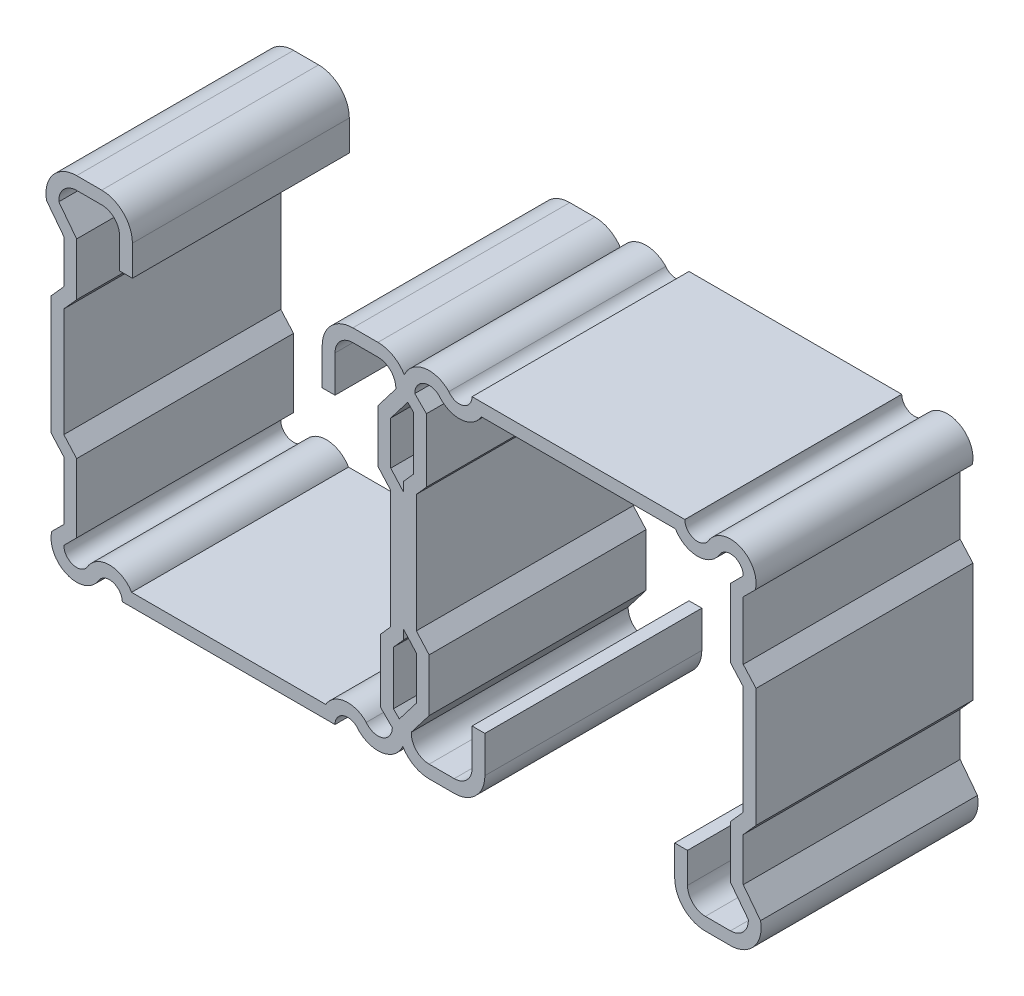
ISO-10303-21;
HEADER;
FILE_DESCRIPTION(('STEP AP214'),'2;1');
FILE_NAME('part.step','',(''),(''),'','','');
FILE_SCHEMA(('AUTOMOTIVE_DESIGN { 1 0 10303 214 1 1 1 1 }'));
ENDSEC;
DATA;
#1=APPLICATION_CONTEXT('core data for automotive mechanical design processes');
#2=APPLICATION_PROTOCOL_DEFINITION('international standard','automotive_design',2000,#1);
#3=PRODUCT_CONTEXT('',#1,'mechanical');
#4=PRODUCT('Part','Part','',(#3));
#5=PRODUCT_RELATED_PRODUCT_CATEGORY('part','',(#4));
#6=PRODUCT_DEFINITION_FORMATION('','',#4);
#7=PRODUCT_DEFINITION_CONTEXT('part definition',#1,'design');
#8=PRODUCT_DEFINITION('design','',#6,#7);
#9=PRODUCT_DEFINITION_SHAPE('','',#8);
#10=(LENGTH_UNIT() NAMED_UNIT(*) SI_UNIT(.MILLI.,.METRE.));
#11=(NAMED_UNIT(*) PLANE_ANGLE_UNIT() SI_UNIT($,.RADIAN.));
#12=(NAMED_UNIT(*) SI_UNIT($,.STERADIAN.) SOLID_ANGLE_UNIT());
#13=UNCERTAINTY_MEASURE_WITH_UNIT(LENGTH_MEASURE(1.E-05),#10,'distance_accuracy_value','');
#14=(GEOMETRIC_REPRESENTATION_CONTEXT(3) GLOBAL_UNCERTAINTY_ASSIGNED_CONTEXT((#13)) GLOBAL_UNIT_ASSIGNED_CONTEXT((#10,
#11,#12)) REPRESENTATION_CONTEXT('',''));
#15=CARTESIAN_POINT('',(0.,0.,0.));
#16=DIRECTION('',(0.,0.,1.));
#17=DIRECTION('',(1.,0.,0.));
#18=AXIS2_PLACEMENT_3D('',#15,#16,#17);
#19=CARTESIAN_POINT('',(-2.99720000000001,3.038475,12.7));
#20=DIRECTION('',(0.,0.,-1.));
#21=DIRECTION('',(-1.,0.,0.));
#22=AXIS2_PLACEMENT_3D('',#19,#20,#21);
#23=CYLINDRICAL_SURFACE('',#22,3.17895300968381);
#24=DIRECTION('',(0.,0.,-1.));
#25=VECTOR('',#24,1.);
#26=CARTESIAN_POINT('',(-0.0888486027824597,1.75502870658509,0.));
#27=LINE('',#26,#25);
#28=CARTESIAN_POINT('',(-0.0888486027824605,1.75502870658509,12.7));
#29=VERTEX_POINT('',#28);
#30=CARTESIAN_POINT('',(-0.0888486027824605,1.75502870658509,-12.7));
#31=VERTEX_POINT('',#30);
#32=EDGE_CURVE('E763',#29,#31,#27,.T.);
#33=ORIENTED_EDGE('',*,*,#32,.F.);
#34=CARTESIAN_POINT('',(-2.99720000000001,3.038475,12.7));
#35=DIRECTION('',(0.,0.,1.));
#36=DIRECTION('',(-1.,0.,0.));
#37=AXIS2_PLACEMENT_3D('',#34,#35,#36);
#38=CIRCLE('',#37,3.17895300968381);
#39=CARTESIAN_POINT('',(-5.30017443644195,0.847116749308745,12.7));
#40=VERTEX_POINT('',#39);
#41=EDGE_CURVE('E883',#40,#29,#38,.T.);
#42=ORIENTED_EDGE('',*,*,#41,.F.);
#43=DIRECTION('',(0.,0.,-1.));
#44=VECTOR('',#43,1.);
#45=CARTESIAN_POINT('',(-5.30017443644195,0.847116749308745,12.7));
#46=LINE('',#45,#44);
#47=CARTESIAN_POINT('',(-5.30017443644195,0.847116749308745,-12.7));
#48=VERTEX_POINT('',#47);
#49=EDGE_CURVE('E1216',#40,#48,#46,.T.);
#50=ORIENTED_EDGE('',*,*,#49,.T.);
#51=CARTESIAN_POINT('',(-2.99720000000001,3.038475,-12.7));
#52=DIRECTION('',(0.,0.,1.));
#53=DIRECTION('',(-1.,0.,0.));
#54=AXIS2_PLACEMENT_3D('',#51,#52,#53);
#55=CIRCLE('',#54,3.17895300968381);
#56=EDGE_CURVE('E1052',#48,#31,#55,.T.);
#57=ORIENTED_EDGE('',*,*,#56,.T.);
#58=EDGE_LOOP('',(#33,#42,#50,#57));
#59=FACE_BOUND('',#58,.T.);
#60=ADVANCED_FACE('F41',(#59),#23,.T.);
#61=CARTESIAN_POINT('',(-1.18109999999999,5.02206845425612,12.7));
#62=DIRECTION('',(-0.707106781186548,-0.707106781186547,0.));
#63=DIRECTION('',(0.707106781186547,-0.707106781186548,0.));
#64=AXIS2_PLACEMENT_3D('',#61,#62,#63);
#65=PLANE('',#64);
#66=DIRECTION('',(0.,0.,1.));
#67=VECTOR('',#66,1.);
#68=CARTESIAN_POINT('',(-0.491780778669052,4.33274923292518,12.7));
#69=LINE('',#68,#67);
#70=CARTESIAN_POINT('',(-0.491780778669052,4.33274923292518,-12.7));
#71=VERTEX_POINT('',#70);
#72=CARTESIAN_POINT('',(-0.491780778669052,4.33274923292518,12.7));
#73=VERTEX_POINT('',#72);
#74=EDGE_CURVE('E769',#71,#73,#69,.T.);
#75=ORIENTED_EDGE('',*,*,#74,.F.);
#76=DIRECTION('',(-0.707106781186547,0.707106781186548,0.));
#77=VECTOR('',#76,1.);
#78=CARTESIAN_POINT('',(-1.18109999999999,5.02206845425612,-12.7));
#79=LINE('',#78,#77);
#80=CARTESIAN_POINT('',(-1.18109999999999,5.02206845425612,-12.7));
#81=VERTEX_POINT('',#80);
#82=EDGE_CURVE('E1054',#71,#81,#79,.T.);
#83=ORIENTED_EDGE('',*,*,#82,.T.);
#84=DIRECTION('',(0.,0.,-1.));
#85=VECTOR('',#84,1.);
#86=CARTESIAN_POINT('',(-1.18109999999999,5.02206845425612,12.7));
#87=LINE('',#86,#85);
#88=CARTESIAN_POINT('',(-1.18109999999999,5.02206845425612,12.7));
#89=VERTEX_POINT('',#88);
#90=EDGE_CURVE('E1215',#89,#81,#87,.T.);
#91=ORIENTED_EDGE('',*,*,#90,.F.);
#92=DIRECTION('',(-0.707106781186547,0.707106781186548,0.));
#93=VECTOR('',#92,1.);
#94=CARTESIAN_POINT('',(-1.18109999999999,5.02206845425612,12.7));
#95=LINE('',#94,#93);
#96=EDGE_CURVE('E882',#73,#89,#95,.T.);
#97=ORIENTED_EDGE('',*,*,#96,.F.);
#98=EDGE_LOOP('',(#75,#83,#91,#97));
#99=FACE_BOUND('',#98,.T.);
#100=ADVANCED_FACE('F2141',(#99),#65,.F.);
#101=CARTESIAN_POINT('',(0.,12.5990373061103,12.7));
#102=DIRECTION('',(-1.,0.,0.));
#103=DIRECTION('',(0.,0.,1.));
#104=AXIS2_PLACEMENT_3D('',#101,#102,#103);
#105=PLANE('',#104);
#106=DIRECTION('',(0.,0.,-1.));
#107=VECTOR('',#106,1.);
#108=CARTESIAN_POINT('',(0.,13.6921875,12.7));
#109=LINE('',#108,#107);
#110=CARTESIAN_POINT('',(0.,13.6921874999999,12.7));
#111=VERTEX_POINT('',#110);
#112=CARTESIAN_POINT('',(0.,13.6921874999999,-12.7));
#113=VERTEX_POINT('',#112);
#114=EDGE_CURVE('E1608',#111,#113,#109,.T.);
#115=ORIENTED_EDGE('',*,*,#114,.F.);
#116=DIRECTION('',(0.,1.,0.));
#117=VECTOR('',#116,1.);
#118=CARTESIAN_POINT('',(0.,12.5990373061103,12.7));
#119=LINE('',#118,#117);
#120=CARTESIAN_POINT('',(0.,12.5990373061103,12.7));
#121=VERTEX_POINT('',#120);
#122=EDGE_CURVE('E892',#121,#111,#119,.T.);
#123=ORIENTED_EDGE('',*,*,#122,.F.);
#124=DIRECTION('',(0.,0.,-1.));
#125=VECTOR('',#124,1.);
#126=CARTESIAN_POINT('',(0.,12.5990373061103,12.7));
#127=LINE('',#126,#125);
#128=CARTESIAN_POINT('',(0.,12.5990373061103,-12.7));
#129=VERTEX_POINT('',#128);
#130=EDGE_CURVE('E1205',#121,#129,#127,.T.);
#131=ORIENTED_EDGE('',*,*,#130,.T.);
#132=DIRECTION('',(0.,1.,0.));
#133=VECTOR('',#132,1.);
#134=CARTESIAN_POINT('',(0.,12.5990373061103,-12.7));
#135=LINE('',#134,#133);
#136=EDGE_CURVE('E1063',#129,#113,#135,.T.);
#137=ORIENTED_EDGE('',*,*,#136,.T.);
#138=EDGE_LOOP('',(#115,#123,#131,#137));
#139=FACE_BOUND('',#138,.T.);
#140=ADVANCED_FACE('F2149',(#139),#105,.F.);
#141=CARTESIAN_POINT('',(-1.4986,34.3473359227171,12.7));
#142=DIRECTION('',(-0.793466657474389,0.608613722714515,0.));
#143=DIRECTION('',(-0.608613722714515,-0.793466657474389,0.));
#144=AXIS2_PLACEMENT_3D('',#141,#142,#143);
#145=PLANE('',#144);
#146=DIRECTION('',(0.,0.,-1.));
#147=VECTOR('',#146,1.);
#148=CARTESIAN_POINT('',(0.491780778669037,36.9422507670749,12.7));
#149=LINE('',#148,#147);
#150=CARTESIAN_POINT('',(0.491780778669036,36.9422507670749,12.7));
#151=VERTEX_POINT('',#150);
#152=CARTESIAN_POINT('',(0.491780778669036,36.9422507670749,-12.7));
#153=VERTEX_POINT('',#152);
#154=EDGE_CURVE('E62',#151,#153,#149,.T.);
#155=ORIENTED_EDGE('',*,*,#154,.F.);
#156=DIRECTION('',(0.608613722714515,0.793466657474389,0.));
#157=VECTOR('',#156,1.);
#158=CARTESIAN_POINT('',(-1.4986,34.3473359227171,12.7));
#159=LINE('',#158,#157);
#160=CARTESIAN_POINT('',(-1.4986,34.3473359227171,12.7));
#161=VERTEX_POINT('',#160);
#162=EDGE_CURVE('E901',#161,#151,#159,.T.);
#163=ORIENTED_EDGE('',*,*,#162,.F.);
#164=DIRECTION('',(0.,0.,-1.));
#165=VECTOR('',#164,1.);
#166=CARTESIAN_POINT('',(-1.4986,34.3473359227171,12.7));
#167=LINE('',#166,#165);
#168=CARTESIAN_POINT('',(-1.4986,34.3473359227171,-12.7));
#169=VERTEX_POINT('',#168);
#170=EDGE_CURVE('E1195',#161,#169,#167,.T.);
#171=ORIENTED_EDGE('',*,*,#170,.T.);
#172=DIRECTION('',(0.608613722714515,0.793466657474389,0.));
#173=VECTOR('',#172,1.);
#174=CARTESIAN_POINT('',(-1.4986,34.3473359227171,-12.7));
#175=LINE('',#174,#173);
#176=EDGE_CURVE('E1072',#169,#153,#175,.T.);
#177=ORIENTED_EDGE('',*,*,#176,.T.);
#178=EDGE_LOOP('',(#155,#163,#171,#177));
#179=FACE_BOUND('',#178,.T.);
#180=ADVANCED_FACE('F2274',(#179),#145,.F.);
#181=CARTESIAN_POINT('',(-2.99720000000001,37.6842263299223,12.7));
#182=DIRECTION('',(0.,0.,-1.));
#183=DIRECTION('',(-1.,0.,0.));
#184=AXIS2_PLACEMENT_3D('',#181,#182,#183);
#185=CYLINDRICAL_SURFACE('',#184,3.59077367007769);
#186=DIRECTION('',(0.,0.,-1.));
#187=VECTOR('',#186,1.);
#188=CARTESIAN_POINT('',(0.0888486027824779,39.5199712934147,0.));
#189=LINE('',#188,#187);
#190=CARTESIAN_POINT('',(0.0888486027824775,39.5199712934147,-12.7));
#191=VERTEX_POINT('',#190);
#192=CARTESIAN_POINT('',(0.0888486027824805,39.5199712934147,12.7));
#193=VERTEX_POINT('',#192);
#194=EDGE_CURVE('E785',#191,#193,#189,.F.);
#195=ORIENTED_EDGE('',*,*,#194,.F.);
#196=CARTESIAN_POINT('',(-2.99720000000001,37.6842263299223,-12.7));
#197=DIRECTION('',(0.,0.,1.));
#198=DIRECTION('',(-1.,0.,0.));
#199=AXIS2_PLACEMENT_3D('',#196,#197,#198);
#200=CIRCLE('',#199,3.59077367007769);
#201=CARTESIAN_POINT('',(-2.99720000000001,41.275,-12.7));
#202=VERTEX_POINT('',#201);
#203=EDGE_CURVE('E1074',#191,#202,#200,.T.);
#204=ORIENTED_EDGE('',*,*,#203,.T.);
#205=DIRECTION('',(0.,0.,-1.));
#206=VECTOR('',#205,1.);
#207=CARTESIAN_POINT('',(-2.99720000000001,41.275,12.7));
#208=LINE('',#207,#206);
#209=CARTESIAN_POINT('',(-2.99720000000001,41.275,12.7));
#210=VERTEX_POINT('',#209);
#211=EDGE_CURVE('E1190',#210,#202,#208,.T.);
#212=ORIENTED_EDGE('',*,*,#211,.F.);
#213=CARTESIAN_POINT('',(-2.99720000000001,37.6842263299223,12.7));
#214=DIRECTION('',(0.,0.,1.));
#215=DIRECTION('',(-1.,0.,0.));
#216=AXIS2_PLACEMENT_3D('',#213,#214,#215);
#217=CIRCLE('',#216,3.59077367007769);
#218=EDGE_CURVE('E60',#193,#210,#217,.T.);
#219=ORIENTED_EDGE('',*,*,#218,.F.);
#220=EDGE_LOOP('',(#195,#204,#212,#219));
#221=FACE_BOUND('',#220,.T.);
#222=ADVANCED_FACE('F1441',(#221),#185,.T.);
#223=CARTESIAN_POINT('',(-6.52618860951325,-0.0146785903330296,12.7));
#224=DIRECTION('',(0.,0.,-1.));
#225=DIRECTION('',(-1.,0.,0.));
#226=AXIS2_PLACEMENT_3D('',#223,#224,#225);
#227=CYLINDRICAL_SURFACE('',#226,2.9972);
#228=CARTESIAN_POINT('',(-6.52618860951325,-0.0146785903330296,-12.7));
#229=DIRECTION('',(0.,0.,1.));
#230=DIRECTION('',(1.,0.,0.));
#231=AXIS2_PLACEMENT_3D('',#228,#229,#230);
#232=CIRCLE('',#231,2.9972);
#233=CARTESIAN_POINT('',(-4.36378237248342,2.0607026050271,-12.7));
#234=VERTEX_POINT('',#233);
#235=CARTESIAN_POINT('',(-9.11330974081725,1.4986,-12.7));
#236=VERTEX_POINT('',#235);
#237=EDGE_CURVE('E781',#234,#236,#232,.T.);
#238=ORIENTED_EDGE('',*,*,#237,.T.);
#239=DIRECTION('',(0.,0.,-1.));
#240=VECTOR('',#239,1.);
#241=CARTESIAN_POINT('',(-9.11330974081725,1.4986,12.7));
#242=LINE('',#241,#240);
#243=CARTESIAN_POINT('',(-9.11330974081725,1.4986,12.7));
#244=VERTEX_POINT('',#243);
#245=EDGE_CURVE('E11',#244,#236,#242,.T.);
#246=ORIENTED_EDGE('',*,*,#245,.F.);
#247=CARTESIAN_POINT('',(-6.52618860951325,-0.0146785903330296,12.7));
#248=DIRECTION('',(0.,0.,1.));
#249=DIRECTION('',(1.,0.,0.));
#250=AXIS2_PLACEMENT_3D('',#247,#248,#249);
#251=CIRCLE('',#250,2.9972);
#252=CARTESIAN_POINT('',(-4.36378237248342,2.0607026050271,12.7));
#253=VERTEX_POINT('',#252);
#254=EDGE_CURVE('E787',#253,#244,#251,.T.);
#255=ORIENTED_EDGE('',*,*,#254,.F.);
#256=DIRECTION('',(0.,0.,-1.));
#257=VECTOR('',#256,1.);
#258=CARTESIAN_POINT('',(-4.36378237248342,2.0607026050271,12.7));
#259=LINE('',#258,#257);
#260=EDGE_CURVE('E960',#253,#234,#259,.T.);
#261=ORIENTED_EDGE('',*,*,#260,.T.);
#262=EDGE_LOOP('',(#238,#246,#255,#261));
#263=FACE_BOUND('',#262,.T.);
#264=ADVANCED_FACE('F43',(#263),#227,.T.);
#265=CARTESIAN_POINT('',(-31.8441902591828,1.4986,12.7));
#266=DIRECTION('',(0.,-1.,0.));
#267=DIRECTION('',(0.,0.,-1.));
#268=AXIS2_PLACEMENT_3D('',#265,#266,#267);
#269=PLANE('',#268);
#270=DIRECTION('',(-1.,0.,0.));
#271=VECTOR('',#270,1.);
#272=CARTESIAN_POINT('',(-31.8441902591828,1.4986,-12.7));
#273=LINE('',#272,#271);
#274=CARTESIAN_POINT('',(-31.8441902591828,1.4986,-12.7));
#275=VERTEX_POINT('',#274);
#276=EDGE_CURVE('E961',#236,#275,#273,.T.);
#277=ORIENTED_EDGE('',*,*,#276,.T.);
#278=DIRECTION('',(0.,0.,-1.));
#279=VECTOR('',#278,1.);
#280=CARTESIAN_POINT('',(-31.8441902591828,1.4986,12.7));
#281=LINE('',#280,#279);
#282=CARTESIAN_POINT('',(-31.8441902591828,1.4986,12.7));
#283=VERTEX_POINT('',#282);
#284=EDGE_CURVE('E49',#283,#275,#281,.T.);
#285=ORIENTED_EDGE('',*,*,#284,.F.);
#286=DIRECTION('',(-1.,0.,0.));
#287=VECTOR('',#286,1.);
#288=CARTESIAN_POINT('',(-31.8441902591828,1.4986,12.7));
#289=LINE('',#288,#287);
#290=EDGE_CURVE('E788',#244,#283,#289,.T.);
#291=ORIENTED_EDGE('',*,*,#290,.F.);
#292=ORIENTED_EDGE('',*,*,#245,.T.);
#293=EDGE_LOOP('',(#277,#285,#291,#292));
#294=FACE_BOUND('',#293,.T.);
#295=ADVANCED_FACE('F1358',(#294),#269,.F.);
#296=CARTESIAN_POINT('',(-34.4313113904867,-0.0146785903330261,12.7));
#297=DIRECTION('',(0.,0.,-1.));
#298=DIRECTION('',(-1.,0.,0.));
#299=AXIS2_PLACEMENT_3D('',#296,#297,#298);
#300=CYLINDRICAL_SURFACE('',#299,2.9972);
#301=CARTESIAN_POINT('',(-34.4313113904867,-0.0146785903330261,-12.7));
#302=DIRECTION('',(0.,0.,1.));
#303=DIRECTION('',(-1.,0.,0.));
#304=AXIS2_PLACEMENT_3D('',#301,#302,#303);
#305=CIRCLE('',#304,2.9972);
#306=CARTESIAN_POINT('',(-37.0517858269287,1.4400796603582,-12.7));
#307=VERTEX_POINT('',#306);
#308=EDGE_CURVE('E963',#275,#307,#305,.T.);
#309=ORIENTED_EDGE('',*,*,#308,.T.);
#310=DIRECTION('',(0.,0.,-1.));
#311=VECTOR('',#310,1.);
#312=CARTESIAN_POINT('',(-37.0517858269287,1.4400796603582,12.7));
#313=LINE('',#312,#311);
#314=CARTESIAN_POINT('',(-37.0517858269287,1.4400796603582,12.7));
#315=VERTEX_POINT('',#314);
#316=EDGE_CURVE('E1329',#315,#307,#313,.T.);
#317=ORIENTED_EDGE('',*,*,#316,.F.);
#318=CARTESIAN_POINT('',(-34.4313113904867,-0.0146785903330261,12.7));
#319=DIRECTION('',(0.,0.,1.));
#320=DIRECTION('',(-1.,0.,0.));
#321=AXIS2_PLACEMENT_3D('',#318,#319,#320);
#322=CIRCLE('',#321,2.9972);
#323=EDGE_CURVE('E794',#283,#315,#322,.T.);
#324=ORIENTED_EDGE('',*,*,#323,.F.);
#325=ORIENTED_EDGE('',*,*,#284,.T.);
#326=EDGE_LOOP('',(#309,#317,#324,#325));
#327=FACE_BOUND('',#326,.T.);
#328=ADVANCED_FACE('F1336',(#327),#300,.T.);
#329=CARTESIAN_POINT('',(-38.2778,2.30187499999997,12.7));
#330=DIRECTION('',(0.,0.,-1.));
#331=DIRECTION('',(-1.,0.,0.));
#332=AXIS2_PLACEMENT_3D('',#329,#330,#331);
#333=CYLINDRICAL_SURFACE('',#332,1.4986);
#334=CARTESIAN_POINT('',(-38.2778,2.30187499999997,-12.7));
#335=DIRECTION('',(0.,0.,-1.));
#336=DIRECTION('',(1.,0.,0.));
#337=AXIS2_PLACEMENT_3D('',#334,#335,#336);
#338=CIRCLE('',#337,1.4986);
#339=CARTESIAN_POINT('',(-39.7764,2.30187499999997,-12.7));
#340=VERTEX_POINT('',#339);
#341=EDGE_CURVE('E970',#307,#340,#338,.T.);
#342=ORIENTED_EDGE('',*,*,#341,.T.);
#343=DIRECTION('',(0.,0.,-1.));
#344=VECTOR('',#343,1.);
#345=CARTESIAN_POINT('',(-39.7764,2.30187499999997,12.7));
#346=LINE('',#345,#344);
#347=CARTESIAN_POINT('',(-39.7764,2.30187499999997,12.7));
#348=VERTEX_POINT('',#347);
#349=EDGE_CURVE('E1324',#348,#340,#346,.T.);
#350=ORIENTED_EDGE('',*,*,#349,.F.);
#351=CARTESIAN_POINT('',(-38.2778,2.30187499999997,12.7));
#352=DIRECTION('',(0.,0.,-1.));
#353=DIRECTION('',(1.,0.,0.));
#354=AXIS2_PLACEMENT_3D('',#351,#352,#353);
#355=CIRCLE('',#354,1.4986);
#356=EDGE_CURVE('E796',#315,#348,#355,.T.);
#357=ORIENTED_EDGE('',*,*,#356,.F.);
#358=ORIENTED_EDGE('',*,*,#316,.T.);
#359=EDGE_LOOP('',(#342,#350,#357,#358));
#360=FACE_BOUND('',#359,.T.);
#361=ADVANCED_FACE('F1349',(#360),#333,.F.);
#362=CARTESIAN_POINT('',(-38.2778,3.80047499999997,12.7));
#363=DIRECTION('',(-0.707106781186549,0.707106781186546,0.));
#364=DIRECTION('',(-0.707106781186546,-0.707106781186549,0.));
#365=AXIS2_PLACEMENT_3D('',#362,#363,#364);
#366=PLANE('',#365);
#367=DIRECTION('',(0.707106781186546,0.707106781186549,0.));
#368=VECTOR('',#367,1.);
#369=CARTESIAN_POINT('',(-38.2778,3.80047499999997,-12.7));
#370=LINE('',#369,#368);
#371=CARTESIAN_POINT('',(-38.2778,3.80047499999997,-12.7));
#372=VERTEX_POINT('',#371);
#373=EDGE_CURVE('E968',#340,#372,#370,.T.);
#374=ORIENTED_EDGE('',*,*,#373,.T.);
#375=DIRECTION('',(0.,0.,-1.));
#376=VECTOR('',#375,1.);
#377=CARTESIAN_POINT('',(-38.2778,3.80047499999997,12.7));
#378=LINE('',#377,#376);
#379=CARTESIAN_POINT('',(-38.2778,3.80047499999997,12.7));
#380=VERTEX_POINT('',#379);
#381=EDGE_CURVE('E1317',#380,#372,#378,.T.);
#382=ORIENTED_EDGE('',*,*,#381,.F.);
#383=DIRECTION('',(0.707106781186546,0.707106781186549,0.));
#384=VECTOR('',#383,1.);
#385=CARTESIAN_POINT('',(-38.2778,3.80047499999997,12.7));
#386=LINE('',#385,#384);
#387=EDGE_CURVE('E797',#348,#380,#386,.T.);
#388=ORIENTED_EDGE('',*,*,#387,.F.);
#389=ORIENTED_EDGE('',*,*,#349,.T.);
#390=EDGE_LOOP('',(#374,#382,#388,#389));
#391=FACE_BOUND('',#390,.T.);
#392=ADVANCED_FACE('F1353',(#391),#366,.F.);
#393=CARTESIAN_POINT('',(-38.2778,3.80047499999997,12.7));
#394=DIRECTION('',(-1.,0.,0.));
#395=DIRECTION('',(0.,0.,1.));
#396=AXIS2_PLACEMENT_3D('',#393,#394,#395);
#397=PLANE('',#396);
#398=DIRECTION('',(0.,1.,0.));
#399=VECTOR('',#398,1.);
#400=CARTESIAN_POINT('',(-38.2778,3.80047499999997,-12.7));
#401=LINE('',#400,#399);
#402=CARTESIAN_POINT('',(-38.2778,11.8431979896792,-12.7));
#403=VERTEX_POINT('',#402);
#404=EDGE_CURVE('E975',#372,#403,#401,.T.);
#405=ORIENTED_EDGE('',*,*,#404,.T.);
#406=DIRECTION('',(0.,0.,-1.));
#407=VECTOR('',#406,1.);
#408=CARTESIAN_POINT('',(-38.2778,11.8431979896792,12.7));
#409=LINE('',#408,#407);
#410=CARTESIAN_POINT('',(-38.2778,11.8431979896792,12.7));
#411=VERTEX_POINT('',#410);
#412=EDGE_CURVE('E1319',#411,#403,#409,.T.);
#413=ORIENTED_EDGE('',*,*,#412,.F.);
#414=DIRECTION('',(0.,1.,0.));
#415=VECTOR('',#414,1.);
#416=CARTESIAN_POINT('',(-38.2778,3.80047499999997,12.7));
#417=LINE('',#416,#415);
#418=EDGE_CURVE('E803',#380,#411,#417,.T.);
#419=ORIENTED_EDGE('',*,*,#418,.F.);
#420=ORIENTED_EDGE('',*,*,#381,.T.);
#421=EDGE_LOOP('',(#405,#413,#419,#420));
#422=FACE_BOUND('',#421,.T.);
#423=ADVANCED_FACE('F2252',(#422),#397,.F.);
#424=CARTESIAN_POINT('',(-38.2778,11.8431979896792,12.7));
#425=DIRECTION('',(-0.746819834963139,-0.665026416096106,0.));
#426=DIRECTION('',(0.665026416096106,-0.746819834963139,0.));
#427=AXIS2_PLACEMENT_3D('',#424,#425,#426);
#428=PLANE('',#427);
#429=DIRECTION('',(-0.665026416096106,0.746819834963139,0.));
#430=VECTOR('',#429,1.);
#431=CARTESIAN_POINT('',(-38.2778,11.8431979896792,-12.7));
#432=LINE('',#431,#430);
#433=CARTESIAN_POINT('',(-39.7764,13.5261149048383,-12.7));
#434=VERTEX_POINT('',#433);
#435=EDGE_CURVE('E977',#403,#434,#432,.T.);
#436=ORIENTED_EDGE('',*,*,#435,.T.);
#437=DIRECTION('',(0.,0.,-1.));
#438=VECTOR('',#437,1.);
#439=CARTESIAN_POINT('',(-39.7764,13.5261149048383,12.7));
#440=LINE('',#439,#438);
#441=CARTESIAN_POINT('',(-39.7764,13.5261149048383,12.7));
#442=VERTEX_POINT('',#441);
#443=EDGE_CURVE('E1315',#442,#434,#440,.T.);
#444=ORIENTED_EDGE('',*,*,#443,.F.);
#445=DIRECTION('',(-0.665026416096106,0.746819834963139,0.));
#446=VECTOR('',#445,1.);
#447=CARTESIAN_POINT('',(-38.2778,11.8431979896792,12.7));
#448=LINE('',#447,#446);
#449=EDGE_CURVE('E807',#411,#442,#448,.T.);
#450=ORIENTED_EDGE('',*,*,#449,.F.);
#451=ORIENTED_EDGE('',*,*,#412,.T.);
#452=EDGE_LOOP('',(#436,#444,#450,#451));
#453=FACE_BOUND('',#452,.T.);
#454=ADVANCED_FACE('F2247',(#453),#428,.F.);
#455=CARTESIAN_POINT('',(-39.7764,13.5261149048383,12.7));
#456=DIRECTION('',(-1.,0.,0.));
#457=DIRECTION('',(0.,0.,1.));
#458=AXIS2_PLACEMENT_3D('',#455,#456,#457);
#459=PLANE('',#458);
#460=DIRECTION('',(0.,1.,0.));
#461=VECTOR('',#460,1.);
#462=CARTESIAN_POINT('',(-39.7764,13.5261149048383,-12.7));
#463=LINE('',#462,#461);
#464=CARTESIAN_POINT('',(-39.7764,26.2756850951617,-12.7));
#465=VERTEX_POINT('',#464);
#466=EDGE_CURVE('E979',#434,#465,#463,.T.);
#467=ORIENTED_EDGE('',*,*,#466,.T.);
#468=DIRECTION('',(0.,0.,-1.));
#469=VECTOR('',#468,1.);
#470=CARTESIAN_POINT('',(-39.7764,26.2756850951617,12.7));
#471=LINE('',#470,#469);
#472=CARTESIAN_POINT('',(-39.7764,26.2756850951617,12.7));
#473=VERTEX_POINT('',#472);
#474=EDGE_CURVE('E1309',#473,#465,#471,.T.);
#475=ORIENTED_EDGE('',*,*,#474,.F.);
#476=DIRECTION('',(0.,1.,0.));
#477=VECTOR('',#476,1.);
#478=CARTESIAN_POINT('',(-39.7764,13.5261149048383,12.7));
#479=LINE('',#478,#477);
#480=EDGE_CURVE('E806',#442,#473,#479,.T.);
#481=ORIENTED_EDGE('',*,*,#480,.F.);
#482=ORIENTED_EDGE('',*,*,#443,.T.);
#483=EDGE_LOOP('',(#467,#475,#481,#482));
#484=FACE_BOUND('',#483,.T.);
#485=ADVANCED_FACE('F2248',(#484),#459,.F.);
#486=CARTESIAN_POINT('',(-38.2778,27.9586020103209,12.7));
#487=DIRECTION('',(-0.746819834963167,0.665026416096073,0.));
#488=DIRECTION('',(-0.665026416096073,-0.746819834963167,0.));
#489=AXIS2_PLACEMENT_3D('',#486,#487,#488);
#490=PLANE('',#489);
#491=DIRECTION('',(0.665026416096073,0.746819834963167,0.));
#492=VECTOR('',#491,1.);
#493=CARTESIAN_POINT('',(-38.2778,27.9586020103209,-12.7));
#494=LINE('',#493,#492);
#495=CARTESIAN_POINT('',(-38.2778,27.9586020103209,-12.7));
#496=VERTEX_POINT('',#495);
#497=EDGE_CURVE('E985',#465,#496,#494,.T.);
#498=ORIENTED_EDGE('',*,*,#497,.T.);
#499=DIRECTION('',(0.,0.,-1.));
#500=VECTOR('',#499,1.);
#501=CARTESIAN_POINT('',(-38.2778,27.9586020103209,12.7));
#502=LINE('',#501,#500);
#503=CARTESIAN_POINT('',(-38.2778,27.9586020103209,12.7));
#504=VERTEX_POINT('',#503);
#505=EDGE_CURVE('E1304',#504,#496,#502,.T.);
#506=ORIENTED_EDGE('',*,*,#505,.F.);
#507=DIRECTION('',(0.665026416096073,0.746819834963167,0.));
#508=VECTOR('',#507,1.);
#509=CARTESIAN_POINT('',(-38.2778,27.9586020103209,12.7));
#510=LINE('',#509,#508);
#511=EDGE_CURVE('E812',#473,#504,#510,.T.);
#512=ORIENTED_EDGE('',*,*,#511,.F.);
#513=ORIENTED_EDGE('',*,*,#474,.T.);
#514=EDGE_LOOP('',(#498,#506,#512,#513));
#515=FACE_BOUND('',#514,.T.);
#516=ADVANCED_FACE('F2242',(#515),#490,.F.);
#517=CARTESIAN_POINT('',(-38.2778,27.9586020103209,12.7));
#518=DIRECTION('',(-1.,0.,0.));
#519=DIRECTION('',(0.,0.,1.));
#520=AXIS2_PLACEMENT_3D('',#517,#518,#519);
#521=PLANE('',#520);
#522=DIRECTION('',(0.,1.,0.));
#523=VECTOR('',#522,1.);
#524=CARTESIAN_POINT('',(-38.2778,27.9586020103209,-12.7));
#525=LINE('',#524,#523);
#526=CARTESIAN_POINT('',(-38.2778,34.1192865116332,-12.7));
#527=VERTEX_POINT('',#526);
#528=EDGE_CURVE('E983',#496,#527,#525,.T.);
#529=ORIENTED_EDGE('',*,*,#528,.T.);
#530=DIRECTION('',(0.,0.,-1.));
#531=VECTOR('',#530,1.);
#532=CARTESIAN_POINT('',(-38.2778,34.1192865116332,12.7));
#533=LINE('',#532,#531);
#534=CARTESIAN_POINT('',(-38.2778,34.1192865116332,12.7));
#535=VERTEX_POINT('',#534);
#536=EDGE_CURVE('E1297',#535,#527,#533,.T.);
#537=ORIENTED_EDGE('',*,*,#536,.F.);
#538=DIRECTION('',(0.,1.,0.));
#539=VECTOR('',#538,1.);
#540=CARTESIAN_POINT('',(-38.2778,27.9586020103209,12.7));
#541=LINE('',#540,#539);
#542=EDGE_CURVE('E814',#504,#535,#541,.T.);
#543=ORIENTED_EDGE('',*,*,#542,.F.);
#544=ORIENTED_EDGE('',*,*,#505,.T.);
#545=EDGE_LOOP('',(#529,#537,#543,#544));
#546=FACE_BOUND('',#545,.T.);
#547=ADVANCED_FACE('F2239',(#546),#521,.F.);
#548=CARTESIAN_POINT('',(-38.2778,34.1192865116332,12.7));
#549=DIRECTION('',(-0.793466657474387,-0.608613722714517,0.));
#550=DIRECTION('',(0.608613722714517,-0.793466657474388,0.));
#551=AXIS2_PLACEMENT_3D('',#548,#549,#550);
#552=PLANE('',#551);
#553=DIRECTION('',(-0.608613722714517,0.793466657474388,0.));
#554=VECTOR('',#553,1.);
#555=CARTESIAN_POINT('',(-38.2778,34.1192865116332,-12.7));
#556=LINE('',#555,#554);
#557=CARTESIAN_POINT('',(-40.3673825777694,36.8435335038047,-12.7));
#558=VERTEX_POINT('',#557);
#559=EDGE_CURVE('E986',#527,#558,#556,.T.);
#560=ORIENTED_EDGE('',*,*,#559,.T.);
#561=DIRECTION('',(0.,0.,-1.));
#562=VECTOR('',#561,1.);
#563=CARTESIAN_POINT('',(-40.3673825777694,36.8435335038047,12.7));
#564=LINE('',#563,#562);
#565=CARTESIAN_POINT('',(-40.3673825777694,36.8435335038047,12.7));
#566=VERTEX_POINT('',#565);
#567=EDGE_CURVE('E1299',#566,#558,#564,.T.);
#568=ORIENTED_EDGE('',*,*,#567,.F.);
#569=DIRECTION('',(-0.608613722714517,0.793466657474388,0.));
#570=VECTOR('',#569,1.);
#571=CARTESIAN_POINT('',(-38.2778,34.1192865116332,12.7));
#572=LINE('',#571,#570);
#573=EDGE_CURVE('E816',#535,#566,#572,.T.);
#574=ORIENTED_EDGE('',*,*,#573,.F.);
#575=ORIENTED_EDGE('',*,*,#536,.T.);
#576=EDGE_LOOP('',(#560,#568,#574,#575));
#577=FACE_BOUND('',#576,.T.);
#578=ADVANCED_FACE('F2234',(#577),#552,.F.);
#579=CARTESIAN_POINT('',(-38.2778,36.9476263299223,12.7));
#580=DIRECTION('',(0.,0.,-1.));
#581=DIRECTION('',(-1.,0.,0.));
#582=AXIS2_PLACEMENT_3D('',#579,#580,#581);
#583=CYLINDRICAL_SURFACE('',#582,2.09217367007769);
#584=CARTESIAN_POINT('',(-38.2778,36.9476263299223,-12.7));
#585=DIRECTION('',(0.,0.,-1.));
#586=DIRECTION('',(1.,0.,0.));
#587=AXIS2_PLACEMENT_3D('',#584,#585,#586);
#588=CIRCLE('',#587,2.09217367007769);
#589=CARTESIAN_POINT('',(-38.2778,39.0398,-12.7));
#590=VERTEX_POINT('',#589);
#591=EDGE_CURVE('E994',#558,#590,#588,.T.);
#592=ORIENTED_EDGE('',*,*,#591,.T.);
#593=DIRECTION('',(0.,0.,-1.));
#594=VECTOR('',#593,1.);
#595=CARTESIAN_POINT('',(-38.2778,39.0398,12.7));
#596=LINE('',#595,#594);
#597=CARTESIAN_POINT('',(-38.2778,39.0398,12.7));
#598=VERTEX_POINT('',#597);
#599=EDGE_CURVE('E1295',#598,#590,#596,.T.);
#600=ORIENTED_EDGE('',*,*,#599,.F.);
#601=CARTESIAN_POINT('',(-38.2778,36.9476263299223,12.7));
#602=DIRECTION('',(0.,0.,-1.));
#603=DIRECTION('',(1.,0.,0.));
#604=AXIS2_PLACEMENT_3D('',#601,#602,#603);
#605=CIRCLE('',#604,2.09217367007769);
#606=EDGE_CURVE('E821',#566,#598,#605,.T.);
#607=ORIENTED_EDGE('',*,*,#606,.F.);
#608=ORIENTED_EDGE('',*,*,#567,.T.);
#609=EDGE_LOOP('',(#592,#600,#607,#608));
#610=FACE_BOUND('',#609,.T.);
#611=ADVANCED_FACE('F2227',(#610),#583,.F.);
#612=CARTESIAN_POINT('',(-38.2778,39.0398,12.7));
#613=DIRECTION('',(0.,1.,0.));
#614=DIRECTION('',(0.,0.,1.));
#615=AXIS2_PLACEMENT_3D('',#612,#613,#614);
#616=PLANE('',#615);
#617=DIRECTION('',(1.,0.,0.));
#618=VECTOR('',#617,1.);
#619=CARTESIAN_POINT('',(-38.2778,39.0398,-12.7));
#620=LINE('',#619,#618);
#621=CARTESIAN_POINT('',(-35.3407736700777,39.0398,-12.7));
#622=VERTEX_POINT('',#621);
#623=EDGE_CURVE('E993',#590,#622,#620,.T.);
#624=ORIENTED_EDGE('',*,*,#623,.T.);
#625=DIRECTION('',(0.,0.,-1.));
#626=VECTOR('',#625,1.);
#627=CARTESIAN_POINT('',(-35.3407736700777,39.0398,12.7));
#628=LINE('',#627,#626);
#629=CARTESIAN_POINT('',(-35.3407736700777,39.0398,12.7));
#630=VERTEX_POINT('',#629);
#631=EDGE_CURVE('E1287',#630,#622,#628,.T.);
#632=ORIENTED_EDGE('',*,*,#631,.F.);
#633=DIRECTION('',(1.,0.,0.));
#634=VECTOR('',#633,1.);
#635=CARTESIAN_POINT('',(-38.2778,39.0398,12.7));
#636=LINE('',#635,#634);
#637=EDGE_CURVE('E822',#598,#630,#636,.T.);
#638=ORIENTED_EDGE('',*,*,#637,.F.);
#639=ORIENTED_EDGE('',*,*,#599,.T.);
#640=EDGE_LOOP('',(#624,#632,#638,#639));
#641=FACE_BOUND('',#640,.T.);
#642=ADVANCED_FACE('F2229',(#641),#616,.F.);
#643=CARTESIAN_POINT('',(-35.3407736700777,36.9476263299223,12.7));
#644=DIRECTION('',(0.,0.,-1.));
#645=DIRECTION('',(-1.,0.,0.));
#646=AXIS2_PLACEMENT_3D('',#643,#644,#645);
#647=CYLINDRICAL_SURFACE('',#646,2.09217367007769);
#648=CARTESIAN_POINT('',(-35.3407736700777,36.9476263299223,-12.7));
#649=DIRECTION('',(0.,0.,-1.));
#650=DIRECTION('',(1.,0.,0.));
#651=AXIS2_PLACEMENT_3D('',#648,#649,#650);
#652=CIRCLE('',#651,2.09217367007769);
#653=CARTESIAN_POINT('',(-33.2486,36.9476263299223,-12.7));
#654=VERTEX_POINT('',#653);
#655=EDGE_CURVE('E1000',#622,#654,#652,.T.);
#656=ORIENTED_EDGE('',*,*,#655,.T.);
#657=DIRECTION('',(0.,0.,-1.));
#658=VECTOR('',#657,1.);
#659=CARTESIAN_POINT('',(-33.2486,36.9476263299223,12.7));
#660=LINE('',#659,#658);
#661=CARTESIAN_POINT('',(-33.2486,36.9476263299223,12.7));
#662=VERTEX_POINT('',#661);
#663=EDGE_CURVE('E1282',#662,#654,#660,.T.);
#664=ORIENTED_EDGE('',*,*,#663,.F.);
#665=CARTESIAN_POINT('',(-35.3407736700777,36.9476263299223,12.7));
#666=DIRECTION('',(0.,0.,-1.));
#667=DIRECTION('',(1.,0.,0.));
#668=AXIS2_PLACEMENT_3D('',#665,#666,#667);
#669=CIRCLE('',#668,2.09217367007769);
#670=EDGE_CURVE('E830',#630,#662,#669,.T.);
#671=ORIENTED_EDGE('',*,*,#670,.F.);
#672=ORIENTED_EDGE('',*,*,#631,.T.);
#673=EDGE_LOOP('',(#656,#664,#671,#672));
#674=FACE_BOUND('',#673,.T.);
#675=ADVANCED_FACE('F2225',(#674),#647,.F.);
#676=CARTESIAN_POINT('',(-33.2486,36.9476263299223,12.7));
#677=DIRECTION('',(1.,0.,0.));
#678=DIRECTION('',(0.,0.,-1.));
#679=AXIS2_PLACEMENT_3D('',#676,#677,#678);
#680=PLANE('',#679);
#681=DIRECTION('',(0.,-1.,0.));
#682=VECTOR('',#681,1.);
#683=CARTESIAN_POINT('',(-33.2486,36.9476263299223,-12.7));
#684=LINE('',#683,#682);
#685=CARTESIAN_POINT('',(-33.2486,33.39465,-12.7));
#686=VERTEX_POINT('',#685);
#687=EDGE_CURVE('E996',#654,#686,#684,.T.);
#688=ORIENTED_EDGE('',*,*,#687,.T.);
#689=DIRECTION('',(0.,0.,-1.));
#690=VECTOR('',#689,1.);
#691=CARTESIAN_POINT('',(-33.2486,33.39465,12.7));
#692=LINE('',#691,#690);
#693=CARTESIAN_POINT('',(-33.2486,33.39465,12.7));
#694=VERTEX_POINT('',#693);
#695=EDGE_CURVE('E1279',#694,#686,#692,.T.);
#696=ORIENTED_EDGE('',*,*,#695,.F.);
#697=DIRECTION('',(0.,-1.,0.));
#698=VECTOR('',#697,1.);
#699=CARTESIAN_POINT('',(-33.2486,36.9476263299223,12.7));
#700=LINE('',#699,#698);
#701=EDGE_CURVE('E829',#662,#694,#700,.T.);
#702=ORIENTED_EDGE('',*,*,#701,.F.);
#703=ORIENTED_EDGE('',*,*,#663,.T.);
#704=EDGE_LOOP('',(#688,#696,#702,#703));
#705=FACE_BOUND('',#704,.T.);
#706=ADVANCED_FACE('F2219',(#705),#680,.F.);
#707=CARTESIAN_POINT('',(-33.2486,33.39465,12.7));
#708=DIRECTION('',(0.,1.,0.));
#709=DIRECTION('',(-1.,0.,0.));
#710=AXIS2_PLACEMENT_3D('',#707,#708,#709);
#711=PLANE('',#710);
#712=DIRECTION('',(1.,0.,0.));
#713=VECTOR('',#712,1.);
#714=CARTESIAN_POINT('',(-33.2486,33.39465,-12.7));
#715=LINE('',#714,#713);
#716=CARTESIAN_POINT('',(-31.75,33.39465,-12.7));
#717=VERTEX_POINT('',#716);
#718=EDGE_CURVE('E1004',#686,#717,#715,.T.);
#719=ORIENTED_EDGE('',*,*,#718,.T.);
#720=DIRECTION('',(0.,0.,-1.));
#721=VECTOR('',#720,1.);
#722=CARTESIAN_POINT('',(-31.75,33.39465,12.7));
#723=LINE('',#722,#721);
#724=CARTESIAN_POINT('',(-31.75,33.39465,12.7));
#725=VERTEX_POINT('',#724);
#726=EDGE_CURVE('E1276',#725,#717,#723,.T.);
#727=ORIENTED_EDGE('',*,*,#726,.F.);
#728=DIRECTION('',(1.,0.,0.));
#729=VECTOR('',#728,1.);
#730=CARTESIAN_POINT('',(-33.2486,33.39465,12.7));
#731=LINE('',#730,#729);
#732=EDGE_CURVE('E832',#694,#725,#731,.T.);
#733=ORIENTED_EDGE('',*,*,#732,.F.);
#734=ORIENTED_EDGE('',*,*,#695,.T.);
#735=EDGE_LOOP('',(#719,#727,#733,#734));
#736=FACE_BOUND('',#735,.T.);
#737=ADVANCED_FACE('F2214',(#736),#711,.F.);
#738=CARTESIAN_POINT('',(-31.75,36.9476263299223,12.7));
#739=DIRECTION('',(-1.,0.,0.));
#740=DIRECTION('',(0.,0.,1.));
#741=AXIS2_PLACEMENT_3D('',#738,#739,#740);
#742=PLANE('',#741);
#743=DIRECTION('',(0.,1.,0.));
#744=VECTOR('',#743,1.);
#745=CARTESIAN_POINT('',(-31.75,36.9476263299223,-12.7));
#746=LINE('',#745,#744);
#747=CARTESIAN_POINT('',(-31.75,36.9476263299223,-12.7));
#748=VERTEX_POINT('',#747);
#749=EDGE_CURVE('E1008',#717,#748,#746,.T.);
#750=ORIENTED_EDGE('',*,*,#749,.T.);
#751=DIRECTION('',(0.,0.,-1.));
#752=VECTOR('',#751,1.);
#753=CARTESIAN_POINT('',(-31.75,36.9476263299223,12.7));
#754=LINE('',#753,#752);
#755=CARTESIAN_POINT('',(-31.75,36.9476263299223,12.7));
#756=VERTEX_POINT('',#755);
#757=EDGE_CURVE('E1275',#756,#748,#754,.T.);
#758=ORIENTED_EDGE('',*,*,#757,.F.);
#759=DIRECTION('',(0.,1.,0.));
#760=VECTOR('',#759,1.);
#761=CARTESIAN_POINT('',(-31.75,36.9476263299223,12.7));
#762=LINE('',#761,#760);
#763=EDGE_CURVE('E837',#725,#756,#762,.T.);
#764=ORIENTED_EDGE('',*,*,#763,.F.);
#765=ORIENTED_EDGE('',*,*,#726,.T.);
#766=EDGE_LOOP('',(#750,#758,#764,#765));
#767=FACE_BOUND('',#766,.T.);
#768=ADVANCED_FACE('F2207',(#767),#742,.F.);
#769=CARTESIAN_POINT('',(-35.3407736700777,36.9476263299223,12.7));
#770=DIRECTION('',(0.,0.,-1.));
#771=DIRECTION('',(-1.,0.,0.));
#772=AXIS2_PLACEMENT_3D('',#769,#770,#771);
#773=CYLINDRICAL_SURFACE('',#772,3.59077367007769);
#774=CARTESIAN_POINT('',(-35.3407736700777,36.9476263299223,-12.7));
#775=DIRECTION('',(0.,0.,1.));
#776=DIRECTION('',(1.,0.,0.));
#777=AXIS2_PLACEMENT_3D('',#774,#775,#776);
#778=CIRCLE('',#777,3.59077367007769);
#779=CARTESIAN_POINT('',(-35.3407736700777,40.5384,-12.7));
#780=VERTEX_POINT('',#779);
#781=EDGE_CURVE('E1010',#748,#780,#778,.T.);
#782=ORIENTED_EDGE('',*,*,#781,.T.);
#783=DIRECTION('',(0.,0.,-1.));
#784=VECTOR('',#783,1.);
#785=CARTESIAN_POINT('',(-35.3407736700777,40.5384,12.7));
#786=LINE('',#785,#784);
#787=CARTESIAN_POINT('',(-35.3407736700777,40.5384,12.7));
#788=VERTEX_POINT('',#787);
#789=EDGE_CURVE('E1266',#788,#780,#786,.T.);
#790=ORIENTED_EDGE('',*,*,#789,.F.);
#791=CARTESIAN_POINT('',(-35.3407736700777,36.9476263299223,12.7));
#792=DIRECTION('',(0.,0.,1.));
#793=DIRECTION('',(1.,0.,0.));
#794=AXIS2_PLACEMENT_3D('',#791,#792,#793);
#795=CIRCLE('',#794,3.59077367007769);
#796=EDGE_CURVE('E836',#756,#788,#795,.T.);
#797=ORIENTED_EDGE('',*,*,#796,.F.);
#798=ORIENTED_EDGE('',*,*,#757,.T.);
#799=EDGE_LOOP('',(#782,#790,#797,#798));
#800=FACE_BOUND('',#799,.T.);
#801=ADVANCED_FACE('F2209',(#800),#773,.T.);
#802=CARTESIAN_POINT('',(-38.2778,40.5384,12.7));
#803=DIRECTION('',(0.,-1.,0.));
#804=DIRECTION('',(1.,0.,0.));
#805=AXIS2_PLACEMENT_3D('',#802,#803,#804);
#806=PLANE('',#805);
#807=DIRECTION('',(-1.,0.,0.));
#808=VECTOR('',#807,1.);
#809=CARTESIAN_POINT('',(-38.2778,40.5384,-12.7));
#810=LINE('',#809,#808);
#811=CARTESIAN_POINT('',(-38.2778,40.5384,-12.7));
#812=VERTEX_POINT('',#811);
#813=EDGE_CURVE('E1015',#780,#812,#810,.T.);
#814=ORIENTED_EDGE('',*,*,#813,.T.);
#815=DIRECTION('',(0.,0.,-1.));
#816=VECTOR('',#815,1.);
#817=CARTESIAN_POINT('',(-38.2778,40.5384,12.7));
#818=LINE('',#817,#816);
#819=CARTESIAN_POINT('',(-38.2778,40.5384,12.7));
#820=VERTEX_POINT('',#819);
#821=EDGE_CURVE('E1261',#820,#812,#818,.T.);
#822=ORIENTED_EDGE('',*,*,#821,.F.);
#823=DIRECTION('',(-1.,0.,0.));
#824=VECTOR('',#823,1.);
#825=CARTESIAN_POINT('',(-38.2778,40.5384,12.7));
#826=LINE('',#825,#824);
#827=EDGE_CURVE('E841',#788,#820,#826,.T.);
#828=ORIENTED_EDGE('',*,*,#827,.F.);
#829=ORIENTED_EDGE('',*,*,#789,.T.);
#830=EDGE_LOOP('',(#814,#822,#828,#829));
#831=FACE_BOUND('',#830,.T.);
#832=ADVANCED_FACE('F2205',(#831),#806,.F.);
#833=CARTESIAN_POINT('',(-38.2778,36.9476263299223,12.7));
#834=DIRECTION('',(0.,0.,-1.));
#835=DIRECTION('',(-1.,0.,0.));
#836=AXIS2_PLACEMENT_3D('',#833,#834,#835);
#837=CYLINDRICAL_SURFACE('',#836,3.59077367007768);
#838=CARTESIAN_POINT('',(-38.2778,36.9476263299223,-12.7));
#839=DIRECTION('',(0.,0.,1.));
#840=DIRECTION('',(1.,0.,0.));
#841=AXIS2_PLACEMENT_3D('',#838,#839,#840);
#842=CIRCLE('',#841,3.59077367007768);
#843=CARTESIAN_POINT('',(-41.7999286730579,36.2488666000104,-12.7));
#844=VERTEX_POINT('',#843);
#845=EDGE_CURVE('E1012',#812,#844,#842,.T.);
#846=ORIENTED_EDGE('',*,*,#845,.T.);
#847=DIRECTION('',(0.,0.,-1.));
#848=VECTOR('',#847,1.);
#849=CARTESIAN_POINT('',(-41.7999286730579,36.2488666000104,12.7));
#850=LINE('',#849,#848);
#851=CARTESIAN_POINT('',(-41.7999286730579,36.2488666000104,12.7));
#852=VERTEX_POINT('',#851);
#853=EDGE_CURVE('E1256',#852,#844,#850,.T.);
#854=ORIENTED_EDGE('',*,*,#853,.F.);
#855=CARTESIAN_POINT('',(-38.2778,36.9476263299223,12.7));
#856=DIRECTION('',(0.,0.,1.));
#857=DIRECTION('',(1.,0.,0.));
#858=AXIS2_PLACEMENT_3D('',#855,#856,#857);
#859=CIRCLE('',#858,3.59077367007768);
#860=EDGE_CURVE('E842',#820,#852,#859,.T.);
#861=ORIENTED_EDGE('',*,*,#860,.F.);
#862=ORIENTED_EDGE('',*,*,#821,.T.);
#863=EDGE_LOOP('',(#846,#854,#861,#862));
#864=FACE_BOUND('',#863,.T.);
#865=ADVANCED_FACE('F2197',(#864),#837,.T.);
#866=CARTESIAN_POINT('',(-39.7764,33.6107359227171,12.7));
#867=DIRECTION('',(0.793466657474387,0.608613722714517,0.));
#868=DIRECTION('',(-0.608613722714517,0.793466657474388,0.));
#869=AXIS2_PLACEMENT_3D('',#866,#867,#868);
#870=PLANE('',#869);
#871=DIRECTION('',(0.608613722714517,-0.793466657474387,0.));
#872=VECTOR('',#871,1.);
#873=CARTESIAN_POINT('',(-39.7764,33.6107359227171,-12.7));
#874=LINE('',#873,#872);
#875=CARTESIAN_POINT('',(-39.7764,33.6107359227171,-12.7));
#876=VERTEX_POINT('',#875);
#877=EDGE_CURVE('E1018',#844,#876,#874,.T.);
#878=ORIENTED_EDGE('',*,*,#877,.T.);
#879=DIRECTION('',(0.,0.,-1.));
#880=VECTOR('',#879,1.);
#881=CARTESIAN_POINT('',(-39.7764,33.6107359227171,12.7));
#882=LINE('',#881,#880);
#883=CARTESIAN_POINT('',(-39.7764,33.6107359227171,12.7));
#884=VERTEX_POINT('',#883);
#885=EDGE_CURVE('E1257',#884,#876,#882,.T.);
#886=ORIENTED_EDGE('',*,*,#885,.F.);
#887=DIRECTION('',(0.608613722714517,-0.793466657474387,0.));
#888=VECTOR('',#887,1.);
#889=CARTESIAN_POINT('',(-39.7764,33.6107359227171,12.7));
#890=LINE('',#889,#888);
#891=EDGE_CURVE('E848',#852,#884,#890,.T.);
#892=ORIENTED_EDGE('',*,*,#891,.F.);
#893=ORIENTED_EDGE('',*,*,#853,.T.);
#894=EDGE_LOOP('',(#878,#886,#892,#893));
#895=FACE_BOUND('',#894,.T.);
#896=ADVANCED_FACE('F2192',(#895),#870,.F.);
#897=CARTESIAN_POINT('',(-39.7764,28.5291294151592,12.7));
#898=DIRECTION('',(1.,0.,0.));
#899=DIRECTION('',(0.,0.,-1.));
#900=AXIS2_PLACEMENT_3D('',#897,#898,#899);
#901=PLANE('',#900);
#902=DIRECTION('',(0.,-1.,0.));
#903=VECTOR('',#902,1.);
#904=CARTESIAN_POINT('',(-39.7764,28.5291294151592,-12.7));
#905=LINE('',#904,#903);
#906=CARTESIAN_POINT('',(-39.7764,28.5291294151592,-12.7));
#907=VERTEX_POINT('',#906);
#908=EDGE_CURVE('E1021',#876,#907,#905,.T.);
#909=ORIENTED_EDGE('',*,*,#908,.T.);
#910=DIRECTION('',(0.,0.,-1.));
#911=VECTOR('',#910,1.);
#912=CARTESIAN_POINT('',(-39.7764,28.5291294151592,12.7));
#913=LINE('',#912,#911);
#914=CARTESIAN_POINT('',(-39.7764,28.5291294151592,12.7));
#915=VERTEX_POINT('',#914);
#916=EDGE_CURVE('E1251',#915,#907,#913,.T.);
#917=ORIENTED_EDGE('',*,*,#916,.F.);
#918=DIRECTION('',(0.,-1.,0.));
#919=VECTOR('',#918,1.);
#920=CARTESIAN_POINT('',(-39.7764,28.5291294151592,12.7));
#921=LINE('',#920,#919);
#922=EDGE_CURVE('E852',#884,#915,#921,.T.);
#923=ORIENTED_EDGE('',*,*,#922,.F.);
#924=ORIENTED_EDGE('',*,*,#885,.T.);
#925=EDGE_LOOP('',(#909,#917,#923,#924));
#926=FACE_BOUND('',#925,.T.);
#927=ADVANCED_FACE('F2189',(#926),#901,.F.);
#928=CARTESIAN_POINT('',(-39.7764,28.5291294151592,12.7));
#929=DIRECTION('',(0.746819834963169,-0.665026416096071,0.));
#930=DIRECTION('',(0.665026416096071,0.746819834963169,0.));
#931=AXIS2_PLACEMENT_3D('',#928,#929,#930);
#932=PLANE('',#931);
#933=DIRECTION('',(-0.665026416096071,-0.746819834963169,0.));
#934=VECTOR('',#933,1.);
#935=CARTESIAN_POINT('',(-39.7764,28.5291294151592,-12.7));
#936=LINE('',#935,#934);
#937=CARTESIAN_POINT('',(-41.275,26.8462125,-12.7));
#938=VERTEX_POINT('',#937);
#939=EDGE_CURVE('E1022',#907,#938,#936,.T.);
#940=ORIENTED_EDGE('',*,*,#939,.T.);
#941=DIRECTION('',(0.,0.,-1.));
#942=VECTOR('',#941,1.);
#943=CARTESIAN_POINT('',(-41.275,26.8462125,12.7));
#944=LINE('',#943,#942);
#945=CARTESIAN_POINT('',(-41.275,26.8462125,12.7));
#946=VERTEX_POINT('',#945);
#947=EDGE_CURVE('E1246',#946,#938,#944,.T.);
#948=ORIENTED_EDGE('',*,*,#947,.F.);
#949=DIRECTION('',(-0.665026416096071,-0.746819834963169,0.));
#950=VECTOR('',#949,1.);
#951=CARTESIAN_POINT('',(-39.7764,28.5291294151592,12.7));
#952=LINE('',#951,#950);
#953=EDGE_CURVE('E851',#915,#946,#952,.T.);
#954=ORIENTED_EDGE('',*,*,#953,.F.);
#955=ORIENTED_EDGE('',*,*,#916,.T.);
#956=EDGE_LOOP('',(#940,#948,#954,#955));
#957=FACE_BOUND('',#956,.T.);
#958=ADVANCED_FACE('F2186',(#957),#932,.F.);
#959=CARTESIAN_POINT('',(-41.275,12.9555875,12.7));
#960=DIRECTION('',(1.,0.,0.));
#961=DIRECTION('',(0.,0.,-1.));
#962=AXIS2_PLACEMENT_3D('',#959,#960,#961);
#963=PLANE('',#962);
#964=DIRECTION('',(0.,-1.,0.));
#965=VECTOR('',#964,1.);
#966=CARTESIAN_POINT('',(-41.275,12.9555875,-12.7));
#967=LINE('',#966,#965);
#968=CARTESIAN_POINT('',(-41.275,12.9555875,-12.7));
#969=VERTEX_POINT('',#968);
#970=EDGE_CURVE('E1030',#938,#969,#967,.T.);
#971=ORIENTED_EDGE('',*,*,#970,.T.);
#972=DIRECTION('',(0.,0.,-1.));
#973=VECTOR('',#972,1.);
#974=CARTESIAN_POINT('',(-41.275,12.9555875,12.7));
#975=LINE('',#974,#973);
#976=CARTESIAN_POINT('',(-41.275,12.9555875,12.7));
#977=VERTEX_POINT('',#976);
#978=EDGE_CURVE('E1241',#977,#969,#975,.T.);
#979=ORIENTED_EDGE('',*,*,#978,.F.);
#980=DIRECTION('',(0.,-1.,0.));
#981=VECTOR('',#980,1.);
#982=CARTESIAN_POINT('',(-41.275,12.9555875,12.7));
#983=LINE('',#982,#981);
#984=EDGE_CURVE('E860',#946,#977,#983,.T.);
#985=ORIENTED_EDGE('',*,*,#984,.F.);
#986=ORIENTED_EDGE('',*,*,#947,.T.);
#987=EDGE_LOOP('',(#971,#979,#985,#986));
#988=FACE_BOUND('',#987,.T.);
#989=ADVANCED_FACE('F2185',(#988),#963,.F.);
#990=CARTESIAN_POINT('',(-39.7764,11.2726705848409,12.7));
#991=DIRECTION('',(0.74681983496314,0.665026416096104,0.));
#992=DIRECTION('',(-0.665026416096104,0.74681983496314,0.));
#993=AXIS2_PLACEMENT_3D('',#990,#991,#992);
#994=PLANE('',#993);
#995=DIRECTION('',(0.665026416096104,-0.74681983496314,0.));
#996=VECTOR('',#995,1.);
#997=CARTESIAN_POINT('',(-39.7764,11.2726705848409,-12.7));
#998=LINE('',#997,#996);
#999=CARTESIAN_POINT('',(-39.7764,11.2726705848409,-12.7));
#1000=VERTEX_POINT('',#999);
#1001=EDGE_CURVE('E1029',#969,#1000,#998,.T.);
#1002=ORIENTED_EDGE('',*,*,#1001,.T.);
#1003=DIRECTION('',(0.,0.,-1.));
#1004=VECTOR('',#1003,1.);
#1005=CARTESIAN_POINT('',(-39.7764,11.2726705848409,12.7));
#1006=LINE('',#1005,#1004);
#1007=CARTESIAN_POINT('',(-39.7764,11.2726705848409,12.7));
#1008=VERTEX_POINT('',#1007);
#1009=EDGE_CURVE('E1236',#1008,#1000,#1006,.T.);
#1010=ORIENTED_EDGE('',*,*,#1009,.F.);
#1011=DIRECTION('',(0.665026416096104,-0.74681983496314,0.));
#1012=VECTOR('',#1011,1.);
#1013=CARTESIAN_POINT('',(-39.7764,11.2726705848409,12.7));
#1014=LINE('',#1013,#1012);
#1015=EDGE_CURVE('E858',#977,#1008,#1014,.T.);
#1016=ORIENTED_EDGE('',*,*,#1015,.F.);
#1017=ORIENTED_EDGE('',*,*,#978,.T.);
#1018=EDGE_LOOP('',(#1002,#1010,#1016,#1017));
#1019=FACE_BOUND('',#1018,.T.);
#1020=ADVANCED_FACE('F2176',(#1019),#994,.F.);
#1021=CARTESIAN_POINT('',(-39.7764,4.42121544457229,12.7));
#1022=DIRECTION('',(1.,0.,0.));
#1023=DIRECTION('',(0.,0.,-1.));
#1024=AXIS2_PLACEMENT_3D('',#1021,#1022,#1023);
#1025=PLANE('',#1024);
#1026=DIRECTION('',(0.,-1.,0.));
#1027=VECTOR('',#1026,1.);
#1028=CARTESIAN_POINT('',(-39.7764,4.42121544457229,-12.7));
#1029=LINE('',#1028,#1027);
#1030=CARTESIAN_POINT('',(-39.7764,4.42121544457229,-12.7));
#1031=VERTEX_POINT('',#1030);
#1032=EDGE_CURVE('E1034',#1000,#1031,#1029,.T.);
#1033=ORIENTED_EDGE('',*,*,#1032,.T.);
#1034=DIRECTION('',(0.,0.,-1.));
#1035=VECTOR('',#1034,1.);
#1036=CARTESIAN_POINT('',(-39.7764,4.42121544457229,12.7));
#1037=LINE('',#1036,#1035);
#1038=CARTESIAN_POINT('',(-39.7764,4.42121544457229,12.7));
#1039=VERTEX_POINT('',#1038);
#1040=EDGE_CURVE('E1237',#1039,#1031,#1037,.T.);
#1041=ORIENTED_EDGE('',*,*,#1040,.F.);
#1042=DIRECTION('',(0.,-1.,0.));
#1043=VECTOR('',#1042,1.);
#1044=CARTESIAN_POINT('',(-39.7764,4.42121544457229,12.7));
#1045=LINE('',#1044,#1043);
#1046=EDGE_CURVE('E865',#1008,#1039,#1045,.T.);
#1047=ORIENTED_EDGE('',*,*,#1046,.F.);
#1048=ORIENTED_EDGE('',*,*,#1009,.T.);
#1049=EDGE_LOOP('',(#1033,#1041,#1047,#1048));
#1050=FACE_BOUND('',#1049,.T.);
#1051=ADVANCED_FACE('F2171',(#1050),#1025,.F.);
#1052=CARTESIAN_POINT('',(-39.7764,4.42121544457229,12.7));
#1053=DIRECTION('',(0.707106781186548,-0.707106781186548,0.));
#1054=DIRECTION('',(0.707106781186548,0.707106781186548,0.));
#1055=AXIS2_PLACEMENT_3D('',#1052,#1053,#1054);
#1056=PLANE('',#1055);
#1057=DIRECTION('',(-0.707106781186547,-0.707106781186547,0.));
#1058=VECTOR('',#1057,1.);
#1059=CARTESIAN_POINT('',(-39.7764,4.42121544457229,-12.7));
#1060=LINE('',#1059,#1058);
#1061=CARTESIAN_POINT('',(-41.1909580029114,3.00665744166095,-12.7));
#1062=VERTEX_POINT('',#1061);
#1063=EDGE_CURVE('E1039',#1031,#1062,#1060,.T.);
#1064=ORIENTED_EDGE('',*,*,#1063,.T.);
#1065=DIRECTION('',(0.,0.,-1.));
#1066=VECTOR('',#1065,1.);
#1067=CARTESIAN_POINT('',(-41.1909580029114,3.00665744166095,12.7));
#1068=LINE('',#1067,#1066);
#1069=CARTESIAN_POINT('',(-41.1909580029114,3.00665744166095,12.7));
#1070=VERTEX_POINT('',#1069);
#1071=EDGE_CURVE('E1231',#1070,#1062,#1068,.T.);
#1072=ORIENTED_EDGE('',*,*,#1071,.F.);
#1073=DIRECTION('',(-0.707106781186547,-0.707106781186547,0.));
#1074=VECTOR('',#1073,1.);
#1075=CARTESIAN_POINT('',(-39.7764,4.42121544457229,12.7));
#1076=LINE('',#1075,#1074);
#1077=EDGE_CURVE('E867',#1039,#1070,#1076,.T.);
#1078=ORIENTED_EDGE('',*,*,#1077,.F.);
#1079=ORIENTED_EDGE('',*,*,#1040,.T.);
#1080=EDGE_LOOP('',(#1064,#1072,#1078,#1079));
#1081=FACE_BOUND('',#1080,.T.);
#1082=ADVANCED_FACE('F2166',(#1081),#1056,.F.);
#1083=CARTESIAN_POINT('',(-38.2778,2.30187499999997,12.7));
#1084=DIRECTION('',(0.,0.,-1.));
#1085=DIRECTION('',(-1.,0.,0.));
#1086=AXIS2_PLACEMENT_3D('',#1083,#1084,#1085);
#1087=CYLINDRICAL_SURFACE('',#1086,2.9972);
#1088=CARTESIAN_POINT('',(-38.2778,2.30187499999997,-12.7));
#1089=DIRECTION('',(0.,0.,1.));
#1090=DIRECTION('',(1.,0.,0.));
#1091=AXIS2_PLACEMENT_3D('',#1088,#1089,#1090);
#1092=CIRCLE('',#1091,2.9972);
#1093=CARTESIAN_POINT('',(-35.6573255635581,0.847116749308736,-12.7));
#1094=VERTEX_POINT('',#1093);
#1095=EDGE_CURVE('E1038',#1062,#1094,#1092,.T.);
#1096=ORIENTED_EDGE('',*,*,#1095,.T.);
#1097=DIRECTION('',(0.,0.,-1.));
#1098=VECTOR('',#1097,1.);
#1099=CARTESIAN_POINT('',(-35.6573255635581,0.847116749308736,12.7));
#1100=LINE('',#1099,#1098);
#1101=CARTESIAN_POINT('',(-35.6573255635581,0.847116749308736,12.7));
#1102=VERTEX_POINT('',#1101);
#1103=EDGE_CURVE('E1229',#1102,#1094,#1100,.T.);
#1104=ORIENTED_EDGE('',*,*,#1103,.F.);
#1105=CARTESIAN_POINT('',(-38.2778,2.30187499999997,12.7));
#1106=DIRECTION('',(0.,0.,1.));
#1107=DIRECTION('',(1.,0.,0.));
#1108=AXIS2_PLACEMENT_3D('',#1105,#1106,#1107);
#1109=CIRCLE('',#1108,2.9972);
#1110=EDGE_CURVE('E869',#1070,#1102,#1109,.T.);
#1111=ORIENTED_EDGE('',*,*,#1110,.F.);
#1112=ORIENTED_EDGE('',*,*,#1071,.T.);
#1113=EDGE_LOOP('',(#1096,#1104,#1111,#1112));
#1114=FACE_BOUND('',#1113,.T.);
#1115=ADVANCED_FACE('F2167',(#1114),#1087,.T.);
#1116=CARTESIAN_POINT('',(-34.4313113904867,-0.0146785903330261,12.7));
#1117=DIRECTION('',(0.,0.,-1.));
#1118=DIRECTION('',(-1.,0.,0.));
#1119=AXIS2_PLACEMENT_3D('',#1116,#1117,#1118);
#1120=CYLINDRICAL_SURFACE('',#1119,1.4986);
#1121=CARTESIAN_POINT('',(-34.4313113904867,-0.0146785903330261,-12.7));
#1122=DIRECTION('',(0.,0.,-1.));
#1123=DIRECTION('',(-1.,0.,0.));
#1124=AXIS2_PLACEMENT_3D('',#1121,#1122,#1123);
#1125=CIRCLE('',#1124,1.4986);
#1126=CARTESIAN_POINT('',(-32.932783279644,0.,-12.7));
#1127=VERTEX_POINT('',#1126);
#1128=EDGE_CURVE('E1045',#1094,#1127,#1125,.T.);
#1129=ORIENTED_EDGE('',*,*,#1128,.T.);
#1130=DIRECTION('',(0.,0.,-1.));
#1131=VECTOR('',#1130,1.);
#1132=CARTESIAN_POINT('',(-32.932783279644,0.,12.7));
#1133=LINE('',#1132,#1131);
#1134=CARTESIAN_POINT('',(-32.932783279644,0.,12.7));
#1135=VERTEX_POINT('',#1134);
#1136=EDGE_CURVE('E1223',#1135,#1127,#1133,.T.);
#1137=ORIENTED_EDGE('',*,*,#1136,.F.);
#1138=CARTESIAN_POINT('',(-34.4313113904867,-0.0146785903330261,12.7));
#1139=DIRECTION('',(0.,0.,-1.));
#1140=DIRECTION('',(-1.,0.,0.));
#1141=AXIS2_PLACEMENT_3D('',#1138,#1139,#1140);
#1142=CIRCLE('',#1141,1.4986);
#1143=EDGE_CURVE('E875',#1102,#1135,#1142,.T.);
#1144=ORIENTED_EDGE('',*,*,#1143,.F.);
#1145=ORIENTED_EDGE('',*,*,#1103,.T.);
#1146=EDGE_LOOP('',(#1129,#1137,#1144,#1145));
#1147=FACE_BOUND('',#1146,.T.);
#1148=ADVANCED_FACE('F2161',(#1147),#1120,.F.);
#1149=CARTESIAN_POINT('',(-32.932783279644,0.,12.7));
#1150=DIRECTION('',(0.,1.,0.));
#1151=DIRECTION('',(-1.,0.,0.));
#1152=AXIS2_PLACEMENT_3D('',#1149,#1150,#1151);
#1153=PLANE('',#1152);
#1154=DIRECTION('',(1.,0.,0.));
#1155=VECTOR('',#1154,1.);
#1156=CARTESIAN_POINT('',(-32.932783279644,0.,-12.7));
#1157=LINE('',#1156,#1155);
#1158=CARTESIAN_POINT('',(-8.02471672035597,0.,-12.7));
#1159=VERTEX_POINT('',#1158);
#1160=EDGE_CURVE('E1041',#1127,#1159,#1157,.T.);
#1161=ORIENTED_EDGE('',*,*,#1160,.T.);
#1162=DIRECTION('',(0.,0.,-1.));
#1163=VECTOR('',#1162,1.);
#1164=CARTESIAN_POINT('',(-8.02471672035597,0.,12.7));
#1165=LINE('',#1164,#1163);
#1166=CARTESIAN_POINT('',(-8.02471672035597,0.,12.7));
#1167=VERTEX_POINT('',#1166);
#1168=EDGE_CURVE('E1219',#1167,#1159,#1165,.T.);
#1169=ORIENTED_EDGE('',*,*,#1168,.F.);
#1170=DIRECTION('',(1.,0.,0.));
#1171=VECTOR('',#1170,1.);
#1172=CARTESIAN_POINT('',(-32.932783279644,0.,12.7));
#1173=LINE('',#1172,#1171);
#1174=EDGE_CURVE('E873',#1135,#1167,#1173,.T.);
#1175=ORIENTED_EDGE('',*,*,#1174,.F.);
#1176=ORIENTED_EDGE('',*,*,#1136,.T.);
#1177=EDGE_LOOP('',(#1161,#1169,#1175,#1176));
#1178=FACE_BOUND('',#1177,.T.);
#1179=ADVANCED_FACE('F2156',(#1178),#1153,.F.);
#1180=CARTESIAN_POINT('',(-6.52618860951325,-0.0146785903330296,12.7));
#1181=DIRECTION('',(0.,0.,-1.));
#1182=DIRECTION('',(-1.,0.,0.));
#1183=AXIS2_PLACEMENT_3D('',#1180,#1181,#1182);
#1184=CYLINDRICAL_SURFACE('',#1183,1.4986);
#1185=CARTESIAN_POINT('',(-6.52618860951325,-0.0146785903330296,-12.7));
#1186=DIRECTION('',(0.,0.,-1.));
#1187=DIRECTION('',(1.,0.,0.));
#1188=AXIS2_PLACEMENT_3D('',#1185,#1186,#1187);
#1189=CIRCLE('',#1188,1.4986);
#1190=EDGE_CURVE('E1049',#1159,#48,#1189,.T.);
#1191=ORIENTED_EDGE('',*,*,#1190,.T.);
#1192=ORIENTED_EDGE('',*,*,#49,.F.);
#1193=CARTESIAN_POINT('',(-6.52618860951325,-0.0146785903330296,12.7));
#1194=DIRECTION('',(0.,0.,-1.));
#1195=DIRECTION('',(1.,0.,0.));
#1196=AXIS2_PLACEMENT_3D('',#1193,#1194,#1195);
#1197=CIRCLE('',#1196,1.4986);
#1198=EDGE_CURVE('E876',#1167,#40,#1197,.T.);
#1199=ORIENTED_EDGE('',*,*,#1198,.F.);
#1200=ORIENTED_EDGE('',*,*,#1168,.T.);
#1201=EDGE_LOOP('',(#1191,#1192,#1199,#1200));
#1202=FACE_BOUND('',#1201,.T.);
#1203=ADVANCED_FACE('F2151',(#1202),#1184,.F.);
#1204=CARTESIAN_POINT('',(-1.18109999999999,5.02206845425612,12.7));
#1205=DIRECTION('',(-1.,0.,0.));
#1206=DIRECTION('',(0.,0.,1.));
#1207=AXIS2_PLACEMENT_3D('',#1204,#1205,#1206);
#1208=PLANE('',#1207);
#1209=DIRECTION('',(0.,1.,0.));
#1210=VECTOR('',#1209,1.);
#1211=CARTESIAN_POINT('',(-1.18109999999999,5.02206845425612,-12.7));
#1212=LINE('',#1211,#1210);
#1213=CARTESIAN_POINT('',(-1.18109999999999,11.2726705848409,-12.7));
#1214=VERTEX_POINT('',#1213);
#1215=EDGE_CURVE('E1056',#81,#1214,#1212,.T.);
#1216=ORIENTED_EDGE('',*,*,#1215,.T.);
#1217=DIRECTION('',(0.,0.,-1.));
#1218=VECTOR('',#1217,1.);
#1219=CARTESIAN_POINT('',(-1.18109999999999,11.2726705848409,12.7));
#1220=LINE('',#1219,#1218);
#1221=CARTESIAN_POINT('',(-1.18109999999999,11.2726705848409,12.7));
#1222=VERTEX_POINT('',#1221);
#1223=EDGE_CURVE('E1206',#1222,#1214,#1220,.T.);
#1224=ORIENTED_EDGE('',*,*,#1223,.F.);
#1225=DIRECTION('',(0.,1.,0.));
#1226=VECTOR('',#1225,1.);
#1227=CARTESIAN_POINT('',(-1.18109999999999,5.02206845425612,12.7));
#1228=LINE('',#1227,#1226);
#1229=EDGE_CURVE('E888',#89,#1222,#1228,.T.);
#1230=ORIENTED_EDGE('',*,*,#1229,.F.);
#1231=ORIENTED_EDGE('',*,*,#90,.T.);
#1232=EDGE_LOOP('',(#1216,#1224,#1230,#1231));
#1233=FACE_BOUND('',#1232,.T.);
#1234=ADVANCED_FACE('F2160',(#1233),#1208,.F.);
#1235=CARTESIAN_POINT('',(-1.18109999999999,11.2726705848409,12.7));
#1236=DIRECTION('',(-0.746819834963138,0.665026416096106,0.));
#1237=DIRECTION('',(-0.665026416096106,-0.746819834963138,0.));
#1238=AXIS2_PLACEMENT_3D('',#1235,#1236,#1237);
#1239=PLANE('',#1238);
#1240=DIRECTION('',(0.665026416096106,0.746819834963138,0.));
#1241=VECTOR('',#1240,1.);
#1242=CARTESIAN_POINT('',(-1.18109999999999,11.2726705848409,-12.7));
#1243=LINE('',#1242,#1241);
#1244=EDGE_CURVE('E1057',#1214,#129,#1243,.T.);
#1245=ORIENTED_EDGE('',*,*,#1244,.T.);
#1246=ORIENTED_EDGE('',*,*,#130,.F.);
#1247=DIRECTION('',(0.665026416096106,0.746819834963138,0.));
#1248=VECTOR('',#1247,1.);
#1249=CARTESIAN_POINT('',(-1.18109999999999,11.2726705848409,12.7));
#1250=LINE('',#1249,#1248);
#1251=EDGE_CURVE('E891',#1222,#121,#1250,.T.);
#1252=ORIENTED_EDGE('',*,*,#1251,.F.);
#1253=ORIENTED_EDGE('',*,*,#1223,.T.);
#1254=EDGE_LOOP('',(#1245,#1246,#1252,#1253));
#1255=FACE_BOUND('',#1254,.T.);
#1256=ADVANCED_FACE('F2290',(#1255),#1239,.F.);
#1257=CARTESIAN_POINT('',(-1.4986,29.2657294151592,12.7));
#1258=DIRECTION('',(-0.746819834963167,-0.665026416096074,0.));
#1259=DIRECTION('',(0.665026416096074,-0.746819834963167,0.));
#1260=AXIS2_PLACEMENT_3D('',#1257,#1258,#1259);
#1261=PLANE('',#1260);
#1262=DIRECTION('',(-0.665026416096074,0.746819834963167,0.));
#1263=VECTOR('',#1262,1.);
#1264=CARTESIAN_POINT('',(-1.4986,29.2657294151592,-12.7));
#1265=LINE('',#1264,#1263);
#1266=CARTESIAN_POINT('',(0.,27.5828124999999,-12.7));
#1267=VERTEX_POINT('',#1266);
#1268=CARTESIAN_POINT('',(-1.4986,29.2657294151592,-12.7));
#1269=VERTEX_POINT('',#1268);
#1270=EDGE_CURVE('E1067',#1267,#1269,#1265,.T.);
#1271=ORIENTED_EDGE('',*,*,#1270,.T.);
#1272=DIRECTION('',(0.,0.,-1.));
#1273=VECTOR('',#1272,1.);
#1274=CARTESIAN_POINT('',(-1.4986,29.2657294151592,12.7));
#1275=LINE('',#1274,#1273);
#1276=CARTESIAN_POINT('',(-1.4986,29.2657294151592,12.7));
#1277=VERTEX_POINT('',#1276);
#1278=EDGE_CURVE('E1197',#1277,#1269,#1275,.T.);
#1279=ORIENTED_EDGE('',*,*,#1278,.F.);
#1280=DIRECTION('',(-0.665026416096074,0.746819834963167,0.));
#1281=VECTOR('',#1280,1.);
#1282=CARTESIAN_POINT('',(-1.4986,29.2657294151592,12.7));
#1283=LINE('',#1282,#1281);
#1284=CARTESIAN_POINT('',(0.,27.5828125,12.7));
#1285=VERTEX_POINT('',#1284);
#1286=EDGE_CURVE('E897',#1285,#1277,#1283,.T.);
#1287=ORIENTED_EDGE('',*,*,#1286,.F.);
#1288=DIRECTION('',(0.,0.,-1.));
#1289=VECTOR('',#1288,1.);
#1290=CARTESIAN_POINT('',(0.,27.5828125,12.7));
#1291=LINE('',#1290,#1289);
#1292=EDGE_CURVE('E1198',#1285,#1267,#1291,.T.);
#1293=ORIENTED_EDGE('',*,*,#1292,.T.);
#1294=EDGE_LOOP('',(#1271,#1279,#1287,#1293));
#1295=FACE_BOUND('',#1294,.T.);
#1296=ADVANCED_FACE('F2281',(#1295),#1261,.F.);
#1297=CARTESIAN_POINT('',(-1.4986,29.2657294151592,12.7));
#1298=DIRECTION('',(-1.,0.,0.));
#1299=DIRECTION('',(0.,-1.,0.));
#1300=AXIS2_PLACEMENT_3D('',#1297,#1298,#1299);
#1301=PLANE('',#1300);
#1302=DIRECTION('',(0.,1.,0.));
#1303=VECTOR('',#1302,1.);
#1304=CARTESIAN_POINT('',(-1.4986,29.2657294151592,-12.7));
#1305=LINE('',#1304,#1303);
#1306=EDGE_CURVE('E1066',#1269,#169,#1305,.T.);
#1307=ORIENTED_EDGE('',*,*,#1306,.T.);
#1308=ORIENTED_EDGE('',*,*,#170,.F.);
#1309=DIRECTION('',(0.,1.,0.));
#1310=VECTOR('',#1309,1.);
#1311=CARTESIAN_POINT('',(-1.4986,29.2657294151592,12.7));
#1312=LINE('',#1311,#1310);
#1313=EDGE_CURVE('E902',#1277,#161,#1312,.T.);
#1314=ORIENTED_EDGE('',*,*,#1313,.F.);
#1315=ORIENTED_EDGE('',*,*,#1278,.T.);
#1316=EDGE_LOOP('',(#1307,#1308,#1314,#1315));
#1317=FACE_BOUND('',#1316,.T.);
#1318=ADVANCED_FACE('F2282',(#1317),#1301,.F.);
#1319=CARTESIAN_POINT('',(-2.99720000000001,41.275,12.7));
#1320=DIRECTION('',(0.,-1.,0.));
#1321=DIRECTION('',(0.,0.,-1.));
#1322=AXIS2_PLACEMENT_3D('',#1319,#1320,#1321);
#1323=PLANE('',#1322);
#1324=DIRECTION('',(-1.,0.,0.));
#1325=VECTOR('',#1324,1.);
#1326=CARTESIAN_POINT('',(-2.99720000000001,41.275,-12.7));
#1327=LINE('',#1326,#1325);
#1328=CARTESIAN_POINT('',(-5.93422632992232,41.275,-12.7));
#1329=VERTEX_POINT('',#1328);
#1330=EDGE_CURVE('E1076',#202,#1329,#1327,.T.);
#1331=ORIENTED_EDGE('',*,*,#1330,.T.);
#1332=DIRECTION('',(0.,0.,-1.));
#1333=VECTOR('',#1332,1.);
#1334=CARTESIAN_POINT('',(-5.93422632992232,41.275,12.7));
#1335=LINE('',#1334,#1333);
#1336=CARTESIAN_POINT('',(-5.93422632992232,41.275,12.7));
#1337=VERTEX_POINT('',#1336);
#1338=EDGE_CURVE('E1184',#1337,#1329,#1335,.T.);
#1339=ORIENTED_EDGE('',*,*,#1338,.F.);
#1340=DIRECTION('',(-1.,0.,0.));
#1341=VECTOR('',#1340,1.);
#1342=CARTESIAN_POINT('',(-2.99720000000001,41.275,12.7));
#1343=LINE('',#1342,#1341);
#1344=EDGE_CURVE('E908',#210,#1337,#1343,.T.);
#1345=ORIENTED_EDGE('',*,*,#1344,.F.);
#1346=ORIENTED_EDGE('',*,*,#211,.T.);
#1347=EDGE_LOOP('',(#1331,#1339,#1345,#1346));
#1348=FACE_BOUND('',#1347,.T.);
#1349=ADVANCED_FACE('F1442',(#1348),#1323,.F.);
#1350=CARTESIAN_POINT('',(-5.93422632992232,37.6842263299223,12.7));
#1351=DIRECTION('',(0.,0.,-1.));
#1352=DIRECTION('',(-1.,0.,0.));
#1353=AXIS2_PLACEMENT_3D('',#1350,#1351,#1352);
#1354=CYLINDRICAL_SURFACE('',#1353,3.59077367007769);
#1355=CARTESIAN_POINT('',(-5.93422632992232,37.6842263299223,-12.7));
#1356=DIRECTION('',(0.,0.,1.));
#1357=DIRECTION('',(-1.,0.,0.));
#1358=AXIS2_PLACEMENT_3D('',#1355,#1356,#1357);
#1359=CIRCLE('',#1358,3.59077367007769);
#1360=CARTESIAN_POINT('',(-9.52500000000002,37.6842263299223,-12.7));
#1361=VERTEX_POINT('',#1360);
#1362=EDGE_CURVE('E1081',#1329,#1361,#1359,.T.);
#1363=ORIENTED_EDGE('',*,*,#1362,.T.);
#1364=DIRECTION('',(0.,0.,-1.));
#1365=VECTOR('',#1364,1.);
#1366=CARTESIAN_POINT('',(-9.52500000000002,37.6842263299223,12.7));
#1367=LINE('',#1366,#1365);
#1368=CARTESIAN_POINT('',(-9.52500000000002,37.6842263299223,12.7));
#1369=VERTEX_POINT('',#1368);
#1370=EDGE_CURVE('E1178',#1369,#1361,#1367,.T.);
#1371=ORIENTED_EDGE('',*,*,#1370,.F.);
#1372=CARTESIAN_POINT('',(-5.93422632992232,37.6842263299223,12.7));
#1373=DIRECTION('',(0.,0.,1.));
#1374=DIRECTION('',(-1.,0.,0.));
#1375=AXIS2_PLACEMENT_3D('',#1372,#1373,#1374);
#1376=CIRCLE('',#1375,3.59077367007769);
#1377=EDGE_CURVE('E915',#1337,#1369,#1376,.T.);
#1378=ORIENTED_EDGE('',*,*,#1377,.F.);
#1379=ORIENTED_EDGE('',*,*,#1338,.T.);
#1380=EDGE_LOOP('',(#1363,#1371,#1378,#1379));
#1381=FACE_BOUND('',#1380,.T.);
#1382=ADVANCED_FACE('F1437',(#1381),#1354,.T.);
#1383=CARTESIAN_POINT('',(-9.52500000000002,37.6842263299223,12.7));
#1384=DIRECTION('',(1.,0.,0.));
#1385=DIRECTION('',(0.,1.,0.));
#1386=AXIS2_PLACEMENT_3D('',#1383,#1384,#1385);
#1387=PLANE('',#1386);
#1388=DIRECTION('',(0.,-1.,0.));
#1389=VECTOR('',#1388,1.);
#1390=CARTESIAN_POINT('',(-9.52500000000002,37.6842263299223,-12.7));
#1391=LINE('',#1390,#1389);
#1392=CARTESIAN_POINT('',(-9.52500000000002,33.39465,-12.7));
#1393=VERTEX_POINT('',#1392);
#1394=EDGE_CURVE('E1082',#1361,#1393,#1391,.T.);
#1395=ORIENTED_EDGE('',*,*,#1394,.T.);
#1396=DIRECTION('',(0.,0.,-1.));
#1397=VECTOR('',#1396,1.);
#1398=CARTESIAN_POINT('',(-9.52500000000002,33.39465,12.7));
#1399=LINE('',#1398,#1397);
#1400=CARTESIAN_POINT('',(-9.52500000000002,33.39465,12.7));
#1401=VERTEX_POINT('',#1400);
#1402=EDGE_CURVE('E1177',#1401,#1393,#1399,.T.);
#1403=ORIENTED_EDGE('',*,*,#1402,.F.);
#1404=DIRECTION('',(0.,-1.,0.));
#1405=VECTOR('',#1404,1.);
#1406=CARTESIAN_POINT('',(-9.52500000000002,37.6842263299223,12.7));
#1407=LINE('',#1406,#1405);
#1408=EDGE_CURVE('E911',#1369,#1401,#1407,.T.);
#1409=ORIENTED_EDGE('',*,*,#1408,.F.);
#1410=ORIENTED_EDGE('',*,*,#1370,.T.);
#1411=EDGE_LOOP('',(#1395,#1403,#1409,#1410));
#1412=FACE_BOUND('',#1411,.T.);
#1413=ADVANCED_FACE('F1435',(#1412),#1387,.F.);
#1414=CARTESIAN_POINT('',(-9.52500000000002,33.39465,12.7));
#1415=DIRECTION('',(0.,1.,0.));
#1416=DIRECTION('',(0.,0.,1.));
#1417=AXIS2_PLACEMENT_3D('',#1414,#1415,#1416);
#1418=PLANE('',#1417);
#1419=DIRECTION('',(1.,0.,0.));
#1420=VECTOR('',#1419,1.);
#1421=CARTESIAN_POINT('',(-9.52500000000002,33.39465,-12.7));
#1422=LINE('',#1421,#1420);
#1423=CARTESIAN_POINT('',(-8.02640000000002,33.39465,-12.7));
#1424=VERTEX_POINT('',#1423);
#1425=EDGE_CURVE('E1090',#1393,#1424,#1422,.T.);
#1426=ORIENTED_EDGE('',*,*,#1425,.T.);
#1427=DIRECTION('',(0.,0.,-1.));
#1428=VECTOR('',#1427,1.);
#1429=CARTESIAN_POINT('',(-8.02640000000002,33.39465,12.7));
#1430=LINE('',#1429,#1428);
#1431=CARTESIAN_POINT('',(-8.02640000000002,33.39465,12.7));
#1432=VERTEX_POINT('',#1431);
#1433=EDGE_CURVE('E1175',#1432,#1424,#1430,.T.);
#1434=ORIENTED_EDGE('',*,*,#1433,.F.);
#1435=DIRECTION('',(1.,0.,0.));
#1436=VECTOR('',#1435,1.);
#1437=CARTESIAN_POINT('',(-9.52500000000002,33.39465,12.7));
#1438=LINE('',#1437,#1436);
#1439=EDGE_CURVE('E919',#1401,#1432,#1438,.T.);
#1440=ORIENTED_EDGE('',*,*,#1439,.F.);
#1441=ORIENTED_EDGE('',*,*,#1402,.T.);
#1442=EDGE_LOOP('',(#1426,#1434,#1440,#1441));
#1443=FACE_BOUND('',#1442,.T.);
#1444=ADVANCED_FACE('F1426',(#1443),#1418,.F.);
#1445=CARTESIAN_POINT('',(-8.02640000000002,37.6842263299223,12.7));
#1446=DIRECTION('',(-1.,0.,0.));
#1447=DIRECTION('',(0.,-1.,0.));
#1448=AXIS2_PLACEMENT_3D('',#1445,#1446,#1447);
#1449=PLANE('',#1448);
#1450=DIRECTION('',(0.,1.,0.));
#1451=VECTOR('',#1450,1.);
#1452=CARTESIAN_POINT('',(-8.02640000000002,37.6842263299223,-12.7));
#1453=LINE('',#1452,#1451);
#1454=CARTESIAN_POINT('',(-8.02640000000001,37.6842263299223,-12.7));
#1455=VERTEX_POINT('',#1454);
#1456=EDGE_CURVE('E1089',#1424,#1455,#1453,.T.);
#1457=ORIENTED_EDGE('',*,*,#1456,.T.);
#1458=DIRECTION('',(0.,0.,-1.));
#1459=VECTOR('',#1458,1.);
#1460=CARTESIAN_POINT('',(-8.02640000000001,37.6842263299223,12.7));
#1461=LINE('',#1460,#1459);
#1462=CARTESIAN_POINT('',(-8.02640000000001,37.6842263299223,12.7));
#1463=VERTEX_POINT('',#1462);
#1464=EDGE_CURVE('E1170',#1463,#1455,#1461,.T.);
#1465=ORIENTED_EDGE('',*,*,#1464,.F.);
#1466=DIRECTION('',(0.,1.,0.));
#1467=VECTOR('',#1466,1.);
#1468=CARTESIAN_POINT('',(-8.02640000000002,37.6842263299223,12.7));
#1469=LINE('',#1468,#1467);
#1470=EDGE_CURVE('E922',#1432,#1463,#1469,.T.);
#1471=ORIENTED_EDGE('',*,*,#1470,.F.);
#1472=ORIENTED_EDGE('',*,*,#1433,.T.);
#1473=EDGE_LOOP('',(#1457,#1465,#1471,#1472));
#1474=FACE_BOUND('',#1473,.T.);
#1475=ADVANCED_FACE('F1422',(#1474),#1449,.F.);
#1476=CARTESIAN_POINT('',(-5.93422632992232,37.6842263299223,12.7));
#1477=DIRECTION('',(0.,0.,-1.));
#1478=DIRECTION('',(-1.,0.,0.));
#1479=AXIS2_PLACEMENT_3D('',#1476,#1477,#1478);
#1480=CYLINDRICAL_SURFACE('',#1479,2.09217367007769);
#1481=CARTESIAN_POINT('',(-5.93422632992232,37.6842263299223,-12.7));
#1482=DIRECTION('',(0.,0.,-1.));
#1483=DIRECTION('',(-1.,0.,0.));
#1484=AXIS2_PLACEMENT_3D('',#1481,#1482,#1483);
#1485=CIRCLE('',#1484,2.09217367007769);
#1486=CARTESIAN_POINT('',(-5.93422632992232,39.7764,-12.7));
#1487=VERTEX_POINT('',#1486);
#1488=EDGE_CURVE('E1092',#1455,#1487,#1485,.T.);
#1489=ORIENTED_EDGE('',*,*,#1488,.T.);
#1490=DIRECTION('',(0.,0.,-1.));
#1491=VECTOR('',#1490,1.);
#1492=CARTESIAN_POINT('',(-5.93422632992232,39.7764,12.7));
#1493=LINE('',#1492,#1491);
#1494=CARTESIAN_POINT('',(-5.93422632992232,39.7764,12.7));
#1495=VERTEX_POINT('',#1494);
#1496=EDGE_CURVE('E1161',#1495,#1487,#1493,.T.);
#1497=ORIENTED_EDGE('',*,*,#1496,.F.);
#1498=CARTESIAN_POINT('',(-5.93422632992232,37.6842263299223,12.7));
#1499=DIRECTION('',(0.,0.,-1.));
#1500=DIRECTION('',(-1.,0.,0.));
#1501=AXIS2_PLACEMENT_3D('',#1498,#1499,#1500);
#1502=CIRCLE('',#1501,2.09217367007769);
#1503=EDGE_CURVE('E924',#1463,#1495,#1502,.T.);
#1504=ORIENTED_EDGE('',*,*,#1503,.F.);
#1505=ORIENTED_EDGE('',*,*,#1464,.T.);
#1506=EDGE_LOOP('',(#1489,#1497,#1504,#1505));
#1507=FACE_BOUND('',#1506,.T.);
#1508=ADVANCED_FACE('F1420',(#1507),#1480,.F.);
#1509=CARTESIAN_POINT('',(-2.99720000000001,39.7764,12.7));
#1510=DIRECTION('',(0.,1.,0.));
#1511=DIRECTION('',(-1.,0.,0.));
#1512=AXIS2_PLACEMENT_3D('',#1509,#1510,#1511);
#1513=PLANE('',#1512);
#1514=DIRECTION('',(1.,0.,0.));
#1515=VECTOR('',#1514,1.);
#1516=CARTESIAN_POINT('',(-2.99720000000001,39.7764,-12.7));
#1517=LINE('',#1516,#1515);
#1518=CARTESIAN_POINT('',(-2.99720000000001,39.7764,-12.7));
#1519=VERTEX_POINT('',#1518);
#1520=EDGE_CURVE('E1097',#1487,#1519,#1517,.T.);
#1521=ORIENTED_EDGE('',*,*,#1520,.T.);
#1522=DIRECTION('',(0.,0.,-1.));
#1523=VECTOR('',#1522,1.);
#1524=CARTESIAN_POINT('',(-2.99720000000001,39.7764,12.7));
#1525=LINE('',#1524,#1523);
#1526=CARTESIAN_POINT('',(-2.99720000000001,39.7764,12.7));
#1527=VERTEX_POINT('',#1526);
#1528=EDGE_CURVE('E1159',#1527,#1519,#1525,.T.);
#1529=ORIENTED_EDGE('',*,*,#1528,.F.);
#1530=DIRECTION('',(1.,0.,0.));
#1531=VECTOR('',#1530,1.);
#1532=CARTESIAN_POINT('',(-2.99720000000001,39.7764,12.7));
#1533=LINE('',#1532,#1531);
#1534=EDGE_CURVE('E926',#1495,#1527,#1533,.T.);
#1535=ORIENTED_EDGE('',*,*,#1534,.F.);
#1536=ORIENTED_EDGE('',*,*,#1496,.T.);
#1537=EDGE_LOOP('',(#1521,#1529,#1535,#1536));
#1538=FACE_BOUND('',#1537,.T.);
#1539=ADVANCED_FACE('F1415',(#1538),#1513,.F.);
#1540=CARTESIAN_POINT('',(-2.99720000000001,37.6842263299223,12.7));
#1541=DIRECTION('',(0.,0.,-1.));
#1542=DIRECTION('',(-1.,0.,0.));
#1543=AXIS2_PLACEMENT_3D('',#1540,#1541,#1542);
#1544=CYLINDRICAL_SURFACE('',#1543,2.0921736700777);
#1545=CARTESIAN_POINT('',(-2.99720000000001,37.6842263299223,-12.7));
#1546=DIRECTION('',(0.,0.,-1.));
#1547=DIRECTION('',(-1.,0.,0.));
#1548=AXIS2_PLACEMENT_3D('',#1545,#1546,#1547);
#1549=CIRCLE('',#1548,2.0921736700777);
#1550=CARTESIAN_POINT('',(-0.907617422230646,37.5801335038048,-12.7));
#1551=VERTEX_POINT('',#1550);
#1552=EDGE_CURVE('E1096',#1519,#1551,#1549,.T.);
#1553=ORIENTED_EDGE('',*,*,#1552,.T.);
#1554=DIRECTION('',(0.,0.,-1.));
#1555=VECTOR('',#1554,1.);
#1556=CARTESIAN_POINT('',(-0.907617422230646,37.5801335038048,12.7));
#1557=LINE('',#1556,#1555);
#1558=CARTESIAN_POINT('',(-0.907617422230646,37.5801335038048,12.7));
#1559=VERTEX_POINT('',#1558);
#1560=EDGE_CURVE('E1156',#1559,#1551,#1557,.T.);
#1561=ORIENTED_EDGE('',*,*,#1560,.F.);
#1562=CARTESIAN_POINT('',(-2.99720000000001,37.6842263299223,12.7));
#1563=DIRECTION('',(0.,0.,-1.));
#1564=DIRECTION('',(-1.,0.,0.));
#1565=AXIS2_PLACEMENT_3D('',#1562,#1563,#1564);
#1566=CIRCLE('',#1565,2.0921736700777);
#1567=EDGE_CURVE('E927',#1527,#1559,#1566,.T.);
#1568=ORIENTED_EDGE('',*,*,#1567,.F.);
#1569=ORIENTED_EDGE('',*,*,#1528,.T.);
#1570=EDGE_LOOP('',(#1553,#1561,#1568,#1569));
#1571=FACE_BOUND('',#1570,.T.);
#1572=ADVANCED_FACE('F1406',(#1571),#1544,.F.);
#1573=CARTESIAN_POINT('',(-2.9972,34.8558865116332,12.7));
#1574=DIRECTION('',(0.793466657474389,-0.608613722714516,0.));
#1575=DIRECTION('',(0.608613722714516,0.793466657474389,0.));
#1576=AXIS2_PLACEMENT_3D('',#1573,#1574,#1575);
#1577=PLANE('',#1576);
#1578=DIRECTION('',(-0.608613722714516,-0.793466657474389,0.));
#1579=VECTOR('',#1578,1.);
#1580=CARTESIAN_POINT('',(-2.9972,34.8558865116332,-12.7));
#1581=LINE('',#1580,#1579);
#1582=CARTESIAN_POINT('',(-2.9972,34.8558865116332,-12.7));
#1583=VERTEX_POINT('',#1582);
#1584=EDGE_CURVE('E1101',#1551,#1583,#1581,.T.);
#1585=ORIENTED_EDGE('',*,*,#1584,.T.);
#1586=DIRECTION('',(0.,0.,-1.));
#1587=VECTOR('',#1586,1.);
#1588=CARTESIAN_POINT('',(-2.9972,34.8558865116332,12.7));
#1589=LINE('',#1588,#1587);
#1590=CARTESIAN_POINT('',(-2.9972,34.8558865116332,12.7));
#1591=VERTEX_POINT('',#1590);
#1592=EDGE_CURVE('E1155',#1591,#1583,#1589,.T.);
#1593=ORIENTED_EDGE('',*,*,#1592,.F.);
#1594=DIRECTION('',(-0.608613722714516,-0.793466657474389,0.));
#1595=VECTOR('',#1594,1.);
#1596=CARTESIAN_POINT('',(-2.9972,34.8558865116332,12.7));
#1597=LINE('',#1596,#1595);
#1598=EDGE_CURVE('E933',#1559,#1591,#1597,.T.);
#1599=ORIENTED_EDGE('',*,*,#1598,.F.);
#1600=ORIENTED_EDGE('',*,*,#1560,.T.);
#1601=EDGE_LOOP('',(#1585,#1593,#1599,#1600));
#1602=FACE_BOUND('',#1601,.T.);
#1603=ADVANCED_FACE('F1405',(#1602),#1577,.F.);
#1604=CARTESIAN_POINT('',(-2.99720000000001,28.6952020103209,12.7));
#1605=DIRECTION('',(1.,0.,0.));
#1606=DIRECTION('',(0.,1.,0.));
#1607=AXIS2_PLACEMENT_3D('',#1604,#1605,#1606);
#1608=PLANE('',#1607);
#1609=DIRECTION('',(0.,-1.,0.));
#1610=VECTOR('',#1609,1.);
#1611=CARTESIAN_POINT('',(-2.99720000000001,28.6952020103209,-12.7));
#1612=LINE('',#1611,#1610);
#1613=CARTESIAN_POINT('',(-2.99720000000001,28.6952020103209,-12.7));
#1614=VERTEX_POINT('',#1613);
#1615=EDGE_CURVE('E1102',#1583,#1614,#1612,.T.);
#1616=ORIENTED_EDGE('',*,*,#1615,.T.);
#1617=DIRECTION('',(0.,0.,-1.));
#1618=VECTOR('',#1617,1.);
#1619=CARTESIAN_POINT('',(-2.99720000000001,28.6952020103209,12.7));
#1620=LINE('',#1619,#1618);
#1621=CARTESIAN_POINT('',(-2.99720000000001,28.6952020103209,12.7));
#1622=VERTEX_POINT('',#1621);
#1623=EDGE_CURVE('E1148',#1622,#1614,#1620,.T.);
#1624=ORIENTED_EDGE('',*,*,#1623,.F.);
#1625=DIRECTION('',(0.,-1.,0.));
#1626=VECTOR('',#1625,1.);
#1627=CARTESIAN_POINT('',(-2.99720000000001,28.6952020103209,12.7));
#1628=LINE('',#1627,#1626);
#1629=EDGE_CURVE('E937',#1591,#1622,#1628,.T.);
#1630=ORIENTED_EDGE('',*,*,#1629,.F.);
#1631=ORIENTED_EDGE('',*,*,#1592,.T.);
#1632=EDGE_LOOP('',(#1616,#1624,#1630,#1631));
#1633=FACE_BOUND('',#1632,.T.);
#1634=ADVANCED_FACE('F1397',(#1633),#1608,.F.);
#1635=CARTESIAN_POINT('',(-2.99720000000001,28.6952020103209,12.7));
#1636=DIRECTION('',(0.746819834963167,0.665026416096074,0.));
#1637=DIRECTION('',(-0.665026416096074,0.746819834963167,0.));
#1638=AXIS2_PLACEMENT_3D('',#1635,#1636,#1637);
#1639=PLANE('',#1638);
#1640=DIRECTION('',(0.665026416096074,-0.746819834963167,0.));
#1641=VECTOR('',#1640,1.);
#1642=CARTESIAN_POINT('',(-2.99720000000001,28.6952020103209,-12.7));
#1643=LINE('',#1642,#1641);
#1644=CARTESIAN_POINT('',(-1.49860000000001,27.0122850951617,-12.7));
#1645=VERTEX_POINT('',#1644);
#1646=EDGE_CURVE('E1108',#1614,#1645,#1643,.T.);
#1647=ORIENTED_EDGE('',*,*,#1646,.T.);
#1648=DIRECTION('',(0.,0.,-1.));
#1649=VECTOR('',#1648,1.);
#1650=CARTESIAN_POINT('',(-1.49860000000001,27.0122850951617,12.7));
#1651=LINE('',#1650,#1649);
#1652=CARTESIAN_POINT('',(-1.49860000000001,27.0122850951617,12.7));
#1653=VERTEX_POINT('',#1652);
#1654=EDGE_CURVE('E1144',#1653,#1645,#1651,.T.);
#1655=ORIENTED_EDGE('',*,*,#1654,.F.);
#1656=DIRECTION('',(0.665026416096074,-0.746819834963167,0.));
#1657=VECTOR('',#1656,1.);
#1658=CARTESIAN_POINT('',(-2.99720000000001,28.6952020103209,12.7));
#1659=LINE('',#1658,#1657);
#1660=EDGE_CURVE('E936',#1622,#1653,#1659,.T.);
#1661=ORIENTED_EDGE('',*,*,#1660,.F.);
#1662=ORIENTED_EDGE('',*,*,#1623,.T.);
#1663=EDGE_LOOP('',(#1647,#1655,#1661,#1662));
#1664=FACE_BOUND('',#1663,.T.);
#1665=ADVANCED_FACE('F1392',(#1664),#1639,.F.);
#1666=CARTESIAN_POINT('',(-1.4986,13.1695647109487,12.7));
#1667=DIRECTION('',(1.,0.,0.));
#1668=DIRECTION('',(0.,1.,0.));
#1669=AXIS2_PLACEMENT_3D('',#1666,#1667,#1668);
#1670=PLANE('',#1669);
#1671=DIRECTION('',(0.,-1.,0.));
#1672=VECTOR('',#1671,1.);
#1673=CARTESIAN_POINT('',(-1.4986,13.1695647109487,-12.7));
#1674=LINE('',#1673,#1672);
#1675=CARTESIAN_POINT('',(-1.4986,13.1695647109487,-12.7));
#1676=VERTEX_POINT('',#1675);
#1677=EDGE_CURVE('E1112',#1645,#1676,#1674,.T.);
#1678=ORIENTED_EDGE('',*,*,#1677,.T.);
#1679=DIRECTION('',(0.,0.,-1.));
#1680=VECTOR('',#1679,1.);
#1681=CARTESIAN_POINT('',(-1.4986,13.1695647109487,12.7));
#1682=LINE('',#1681,#1680);
#1683=CARTESIAN_POINT('',(-1.4986,13.1695647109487,12.7));
#1684=VERTEX_POINT('',#1683);
#1685=EDGE_CURVE('E1139',#1684,#1676,#1682,.T.);
#1686=ORIENTED_EDGE('',*,*,#1685,.F.);
#1687=DIRECTION('',(0.,-1.,0.));
#1688=VECTOR('',#1687,1.);
#1689=CARTESIAN_POINT('',(-1.4986,13.1695647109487,12.7));
#1690=LINE('',#1689,#1688);
#1691=EDGE_CURVE('E942',#1653,#1684,#1690,.T.);
#1692=ORIENTED_EDGE('',*,*,#1691,.F.);
#1693=ORIENTED_EDGE('',*,*,#1654,.T.);
#1694=EDGE_LOOP('',(#1678,#1686,#1692,#1693));
#1695=FACE_BOUND('',#1694,.T.);
#1696=ADVANCED_FACE('F1390',(#1695),#1670,.F.);
#1697=CARTESIAN_POINT('',(-2.67969999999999,11.8431979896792,12.7));
#1698=DIRECTION('',(0.746819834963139,-0.665026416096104,0.));
#1699=DIRECTION('',(0.665026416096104,0.74681983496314,0.));
#1700=AXIS2_PLACEMENT_3D('',#1697,#1698,#1699);
#1701=PLANE('',#1700);
#1702=DIRECTION('',(-0.665026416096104,-0.746819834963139,0.));
#1703=VECTOR('',#1702,1.);
#1704=CARTESIAN_POINT('',(-2.67969999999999,11.8431979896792,-12.7));
#1705=LINE('',#1704,#1703);
#1706=CARTESIAN_POINT('',(-2.67969999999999,11.8431979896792,-12.7));
#1707=VERTEX_POINT('',#1706);
#1708=EDGE_CURVE('E1111',#1676,#1707,#1705,.T.);
#1709=ORIENTED_EDGE('',*,*,#1708,.T.);
#1710=DIRECTION('',(0.,0.,-1.));
#1711=VECTOR('',#1710,1.);
#1712=CARTESIAN_POINT('',(-2.67969999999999,11.8431979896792,12.7));
#1713=LINE('',#1712,#1711);
#1714=CARTESIAN_POINT('',(-2.67969999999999,11.8431979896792,12.7));
#1715=VERTEX_POINT('',#1714);
#1716=EDGE_CURVE('E1138',#1715,#1707,#1713,.T.);
#1717=ORIENTED_EDGE('',*,*,#1716,.F.);
#1718=DIRECTION('',(-0.665026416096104,-0.746819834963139,0.));
#1719=VECTOR('',#1718,1.);
#1720=CARTESIAN_POINT('',(-2.67969999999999,11.8431979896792,12.7));
#1721=LINE('',#1720,#1719);
#1722=EDGE_CURVE('E944',#1684,#1715,#1721,.T.);
#1723=ORIENTED_EDGE('',*,*,#1722,.F.);
#1724=ORIENTED_EDGE('',*,*,#1685,.T.);
#1725=EDGE_LOOP('',(#1709,#1717,#1723,#1724));
#1726=FACE_BOUND('',#1725,.T.);
#1727=ADVANCED_FACE('F1381',(#1726),#1701,.F.);
#1728=CARTESIAN_POINT('',(-2.67969999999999,4.40132800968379,12.7));
#1729=DIRECTION('',(1.,0.,0.));
#1730=DIRECTION('',(0.,1.,0.));
#1731=AXIS2_PLACEMENT_3D('',#1728,#1729,#1730);
#1732=PLANE('',#1731);
#1733=DIRECTION('',(0.,-1.,0.));
#1734=VECTOR('',#1733,1.);
#1735=CARTESIAN_POINT('',(-2.67969999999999,4.40132800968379,-12.7));
#1736=LINE('',#1735,#1734);
#1737=CARTESIAN_POINT('',(-2.67969999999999,4.40132800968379,-12.7));
#1738=VERTEX_POINT('',#1737);
#1739=EDGE_CURVE('E1120',#1707,#1738,#1736,.T.);
#1740=ORIENTED_EDGE('',*,*,#1739,.T.);
#1741=DIRECTION('',(0.,0.,-1.));
#1742=VECTOR('',#1741,1.);
#1743=CARTESIAN_POINT('',(-2.67969999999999,4.40132800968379,12.7));
#1744=LINE('',#1743,#1742);
#1745=CARTESIAN_POINT('',(-2.67969999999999,4.40132800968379,12.7));
#1746=VERTEX_POINT('',#1745);
#1747=EDGE_CURVE('E1135',#1746,#1738,#1744,.T.);
#1748=ORIENTED_EDGE('',*,*,#1747,.F.);
#1749=DIRECTION('',(0.,-1.,0.));
#1750=VECTOR('',#1749,1.);
#1751=CARTESIAN_POINT('',(-2.67969999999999,4.40132800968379,12.7));
#1752=LINE('',#1751,#1750);
#1753=EDGE_CURVE('E946',#1715,#1746,#1752,.T.);
#1754=ORIENTED_EDGE('',*,*,#1753,.F.);
#1755=ORIENTED_EDGE('',*,*,#1716,.T.);
#1756=EDGE_LOOP('',(#1740,#1748,#1754,#1755));
#1757=FACE_BOUND('',#1756,.T.);
#1758=ADVANCED_FACE('F1377',(#1757),#1732,.F.);
#1759=CARTESIAN_POINT('',(-2.67969999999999,4.40132800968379,12.7));
#1760=DIRECTION('',(0.707106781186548,0.707106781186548,0.));
#1761=DIRECTION('',(-0.707106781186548,0.707106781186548,0.));
#1762=AXIS2_PLACEMENT_3D('',#1759,#1760,#1761);
#1763=PLANE('',#1762);
#1764=DIRECTION('',(0.707106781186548,-0.707106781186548,0.));
#1765=VECTOR('',#1764,1.);
#1766=CARTESIAN_POINT('',(-2.67969999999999,4.40132800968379,-12.7));
#1767=LINE('',#1766,#1765);
#1768=CARTESIAN_POINT('',(-1.3168469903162,3.038475,-12.7));
#1769=VERTEX_POINT('',#1768);
#1770=EDGE_CURVE('E1118',#1738,#1769,#1767,.T.);
#1771=ORIENTED_EDGE('',*,*,#1770,.T.);
#1772=DIRECTION('',(0.,0.,-1.));
#1773=VECTOR('',#1772,1.);
#1774=CARTESIAN_POINT('',(-1.3168469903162,3.038475,12.7));
#1775=LINE('',#1774,#1773);
#1776=CARTESIAN_POINT('',(-1.3168469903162,3.038475,12.7));
#1777=VERTEX_POINT('',#1776);
#1778=EDGE_CURVE('E1128',#1777,#1769,#1775,.T.);
#1779=ORIENTED_EDGE('',*,*,#1778,.F.);
#1780=DIRECTION('',(0.707106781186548,-0.707106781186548,0.));
#1781=VECTOR('',#1780,1.);
#1782=CARTESIAN_POINT('',(-2.67969999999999,4.40132800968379,12.7));
#1783=LINE('',#1782,#1781);
#1784=EDGE_CURVE('E951',#1746,#1777,#1783,.T.);
#1785=ORIENTED_EDGE('',*,*,#1784,.F.);
#1786=ORIENTED_EDGE('',*,*,#1747,.T.);
#1787=EDGE_LOOP('',(#1771,#1779,#1785,#1786));
#1788=FACE_BOUND('',#1787,.T.);
#1789=ADVANCED_FACE('F1375',(#1788),#1763,.F.);
#1790=CARTESIAN_POINT('',(-2.99720000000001,3.038475,12.7));
#1791=DIRECTION('',(0.,0.,-1.));
#1792=DIRECTION('',(-1.,0.,0.));
#1793=AXIS2_PLACEMENT_3D('',#1790,#1791,#1792);
#1794=CYLINDRICAL_SURFACE('',#1793,1.68035300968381);
#1795=CARTESIAN_POINT('',(-2.99720000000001,3.038475,-12.7));
#1796=DIRECTION('',(0.,0.,-1.));
#1797=DIRECTION('',(-1.,0.,0.));
#1798=AXIS2_PLACEMENT_3D('',#1795,#1796,#1797);
#1799=CIRCLE('',#1798,1.68035300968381);
#1800=EDGE_CURVE('E792',#1769,#234,#1799,.T.);
#1801=ORIENTED_EDGE('',*,*,#1800,.T.);
#1802=ORIENTED_EDGE('',*,*,#260,.F.);
#1803=CARTESIAN_POINT('',(-2.99720000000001,3.038475,12.7));
#1804=DIRECTION('',(0.,0.,-1.));
#1805=DIRECTION('',(-1.,0.,0.));
#1806=AXIS2_PLACEMENT_3D('',#1803,#1804,#1805);
#1807=CIRCLE('',#1806,1.68035300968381);
#1808=EDGE_CURVE('E952',#1777,#253,#1807,.T.);
#1809=ORIENTED_EDGE('',*,*,#1808,.F.);
#1810=ORIENTED_EDGE('',*,*,#1778,.T.);
#1811=EDGE_LOOP('',(#1801,#1802,#1809,#1810));
#1812=FACE_BOUND('',#1811,.T.);
#1813=ADVANCED_FACE('F1370',(#1812),#1794,.F.);
#1814=CARTESIAN_POINT('',(-6.52618860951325,-0.0146785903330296,12.7));
#1815=DIRECTION('',(0.,0.,1.));
#1816=DIRECTION('',(1.,0.,0.));
#1817=AXIS2_PLACEMENT_3D('',#1814,#1815,#1816);
#1818=PLANE('',#1817);
#1819=DIRECTION('',(-0.608613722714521,-0.793466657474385,0.));
#1820=VECTOR('',#1819,1.);
#1821=CARTESIAN_POINT('',(1.49859999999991,6.9276640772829,12.7));
#1822=LINE('',#1821,#1820);
#1823=CARTESIAN_POINT('',(1.49859999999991,6.9276640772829,12.7));
#1824=VERTEX_POINT('',#1823);
#1825=EDGE_CURVE('E1874',#1824,#73,#1822,.T.);
#1826=ORIENTED_EDGE('',*,*,#1825,.T.);
#1827=ORIENTED_EDGE('',*,*,#96,.T.);
#1828=ORIENTED_EDGE('',*,*,#1229,.T.);
#1829=ORIENTED_EDGE('',*,*,#1251,.T.);
#1830=ORIENTED_EDGE('',*,*,#122,.T.);
#1831=DIRECTION('',(0.665026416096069,-0.746819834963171,0.));
#1832=VECTOR('',#1831,1.);
#1833=CARTESIAN_POINT('',(1.49859999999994,12.0092705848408,12.7));
#1834=LINE('',#1833,#1832);
#1835=CARTESIAN_POINT('',(1.49859999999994,12.0092705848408,12.7));
#1836=VERTEX_POINT('',#1835);
#1837=EDGE_CURVE('E1867',#111,#1836,#1834,.T.);
#1838=ORIENTED_EDGE('',*,*,#1837,.T.);
#1839=DIRECTION('',(0.,-1.,0.));
#1840=VECTOR('',#1839,1.);
#1841=CARTESIAN_POINT('',(1.49859999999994,12.0092705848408,12.7));
#1842=LINE('',#1841,#1840);
#1843=EDGE_CURVE('E1875',#1836,#1824,#1842,.T.);
#1844=ORIENTED_EDGE('',*,*,#1843,.T.);
#1845=EDGE_LOOP('',(#1826,#1827,#1828,#1829,#1830,#1838,#1844));
#1846=FACE_BOUND('',#1845,.T.);
#1847=CARTESIAN_POINT('',(2.99720000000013,38.236525,12.7));
#1848=DIRECTION('',(0.,0.,1.));
#1849=DIRECTION('',(1.,0.,0.));
#1850=AXIS2_PLACEMENT_3D('',#1847,#1848,#1849);
#1851=CIRCLE('',#1850,3.17895300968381);
#1852=CARTESIAN_POINT('',(5.30017443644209,40.4278832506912,12.7));
#1853=VERTEX_POINT('',#1852);
#1854=EDGE_CURVE('E1841',#1853,#193,#1851,.T.);
#1855=ORIENTED_EDGE('',*,*,#1854,.T.);
#1856=ORIENTED_EDGE('',*,*,#218,.T.);
#1857=ORIENTED_EDGE('',*,*,#1344,.T.);
#1858=ORIENTED_EDGE('',*,*,#1377,.T.);
#1859=ORIENTED_EDGE('',*,*,#1408,.T.);
#1860=ORIENTED_EDGE('',*,*,#1439,.T.);
#1861=ORIENTED_EDGE('',*,*,#1470,.T.);
#1862=ORIENTED_EDGE('',*,*,#1503,.T.);
#1863=ORIENTED_EDGE('',*,*,#1534,.T.);
#1864=ORIENTED_EDGE('',*,*,#1567,.T.);
#1865=ORIENTED_EDGE('',*,*,#1598,.T.);
#1866=ORIENTED_EDGE('',*,*,#1629,.T.);
#1867=ORIENTED_EDGE('',*,*,#1660,.T.);
#1868=ORIENTED_EDGE('',*,*,#1691,.T.);
#1869=ORIENTED_EDGE('',*,*,#1722,.T.);
#1870=ORIENTED_EDGE('',*,*,#1753,.T.);
#1871=ORIENTED_EDGE('',*,*,#1784,.T.);
#1872=ORIENTED_EDGE('',*,*,#1808,.T.);
#1873=ORIENTED_EDGE('',*,*,#254,.T.);
#1874=ORIENTED_EDGE('',*,*,#290,.T.);
#1875=ORIENTED_EDGE('',*,*,#323,.T.);
#1876=ORIENTED_EDGE('',*,*,#356,.T.);
#1877=ORIENTED_EDGE('',*,*,#387,.T.);
#1878=ORIENTED_EDGE('',*,*,#418,.T.);
#1879=ORIENTED_EDGE('',*,*,#449,.T.);
#1880=ORIENTED_EDGE('',*,*,#480,.T.);
#1881=ORIENTED_EDGE('',*,*,#511,.T.);
#1882=ORIENTED_EDGE('',*,*,#542,.T.);
#1883=ORIENTED_EDGE('',*,*,#573,.T.);
#1884=ORIENTED_EDGE('',*,*,#606,.T.);
#1885=ORIENTED_EDGE('',*,*,#637,.T.);
#1886=ORIENTED_EDGE('',*,*,#670,.T.);
#1887=ORIENTED_EDGE('',*,*,#701,.T.);
#1888=ORIENTED_EDGE('',*,*,#732,.T.);
#1889=ORIENTED_EDGE('',*,*,#763,.T.);
#1890=ORIENTED_EDGE('',*,*,#796,.T.);
#1891=ORIENTED_EDGE('',*,*,#827,.T.);
#1892=ORIENTED_EDGE('',*,*,#860,.T.);
#1893=ORIENTED_EDGE('',*,*,#891,.T.);
#1894=ORIENTED_EDGE('',*,*,#922,.T.);
#1895=ORIENTED_EDGE('',*,*,#953,.T.);
#1896=ORIENTED_EDGE('',*,*,#984,.T.);
#1897=ORIENTED_EDGE('',*,*,#1015,.T.);
#1898=ORIENTED_EDGE('',*,*,#1046,.T.);
#1899=ORIENTED_EDGE('',*,*,#1077,.T.);
#1900=ORIENTED_EDGE('',*,*,#1110,.T.);
#1901=ORIENTED_EDGE('',*,*,#1143,.T.);
#1902=ORIENTED_EDGE('',*,*,#1174,.T.);
#1903=ORIENTED_EDGE('',*,*,#1198,.T.);
#1904=ORIENTED_EDGE('',*,*,#41,.T.);
#1905=CARTESIAN_POINT('',(2.99719999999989,3.59077367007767,12.7));
#1906=DIRECTION('',(0.,0.,1.));
#1907=DIRECTION('',(1.,0.,0.));
#1908=AXIS2_PLACEMENT_3D('',#1905,#1906,#1907);
#1909=CIRCLE('',#1908,3.59077367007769);
#1910=CARTESIAN_POINT('',(2.99719999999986,0.,12.7));
#1911=VERTEX_POINT('',#1910);
#1912=EDGE_CURVE('E1876',#29,#1911,#1909,.T.);
#1913=ORIENTED_EDGE('',*,*,#1912,.T.);
#1914=DIRECTION('',(1.,0.,0.));
#1915=VECTOR('',#1914,1.);
#1916=CARTESIAN_POINT('',(2.99719999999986,0.,12.7));
#1917=LINE('',#1916,#1915);
#1918=CARTESIAN_POINT('',(5.93422632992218,0.,12.7));
#1919=VERTEX_POINT('',#1918);
#1920=EDGE_CURVE('E1881',#1911,#1919,#1917,.T.);
#1921=ORIENTED_EDGE('',*,*,#1920,.T.);
#1922=CARTESIAN_POINT('',(5.9342263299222,3.59077367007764,12.7));
#1923=DIRECTION('',(0.,0.,1.));
#1924=DIRECTION('',(1.,0.,0.));
#1925=AXIS2_PLACEMENT_3D('',#1922,#1923,#1924);
#1926=CIRCLE('',#1925,3.59077367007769);
#1927=CARTESIAN_POINT('',(9.5249999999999,3.59077367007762,12.7));
#1928=VERTEX_POINT('',#1927);
#1929=EDGE_CURVE('E1882',#1919,#1928,#1926,.T.);
#1930=ORIENTED_EDGE('',*,*,#1929,.T.);
#1931=DIRECTION('',(0.,1.,0.));
#1932=VECTOR('',#1931,1.);
#1933=CARTESIAN_POINT('',(9.5249999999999,3.59077367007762,12.7));
#1934=LINE('',#1933,#1932);
#1935=CARTESIAN_POINT('',(9.52499999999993,7.88034999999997,12.7));
#1936=VERTEX_POINT('',#1935);
#1937=EDGE_CURVE('E1888',#1928,#1936,#1934,.T.);
#1938=ORIENTED_EDGE('',*,*,#1937,.T.);
#1939=DIRECTION('',(-1.,0.,0.));
#1940=VECTOR('',#1939,1.);
#1941=CARTESIAN_POINT('',(9.52499999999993,7.88034999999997,12.7));
#1942=LINE('',#1941,#1940);
#1943=CARTESIAN_POINT('',(8.02639999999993,7.88034999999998,12.7));
#1944=VERTEX_POINT('',#1943);
#1945=EDGE_CURVE('E1892',#1936,#1944,#1942,.T.);
#1946=ORIENTED_EDGE('',*,*,#1945,.T.);
#1947=DIRECTION('',(0.,-1.,0.));
#1948=VECTOR('',#1947,1.);
#1949=CARTESIAN_POINT('',(8.0263999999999,3.59077367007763,12.7));
#1950=LINE('',#1949,#1948);
#1951=CARTESIAN_POINT('',(8.0263999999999,3.59077367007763,12.7));
#1952=VERTEX_POINT('',#1951);
#1953=EDGE_CURVE('E1891',#1944,#1952,#1950,.T.);
#1954=ORIENTED_EDGE('',*,*,#1953,.T.);
#1955=CARTESIAN_POINT('',(5.9342263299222,3.59077367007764,12.7));
#1956=DIRECTION('',(0.,0.,-1.));
#1957=DIRECTION('',(1.,0.,0.));
#1958=AXIS2_PLACEMENT_3D('',#1955,#1956,#1957);
#1959=CIRCLE('',#1958,2.09217367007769);
#1960=CARTESIAN_POINT('',(5.93422632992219,1.49859999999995,12.7));
#1961=VERTEX_POINT('',#1960);
#1962=EDGE_CURVE('E1900',#1952,#1961,#1959,.T.);
#1963=ORIENTED_EDGE('',*,*,#1962,.T.);
#1964=DIRECTION('',(-1.,0.,0.));
#1965=VECTOR('',#1964,1.);
#1966=CARTESIAN_POINT('',(2.99719999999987,1.49859999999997,12.7));
#1967=LINE('',#1966,#1965);
#1968=CARTESIAN_POINT('',(2.99719999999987,1.49859999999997,12.7));
#1969=VERTEX_POINT('',#1968);
#1970=EDGE_CURVE('E1898',#1961,#1969,#1967,.T.);
#1971=ORIENTED_EDGE('',*,*,#1970,.T.);
#1972=CARTESIAN_POINT('',(2.99719999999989,3.59077367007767,12.7));
#1973=DIRECTION('',(0.,0.,-1.));
#1974=DIRECTION('',(1.,0.,0.));
#1975=AXIS2_PLACEMENT_3D('',#1972,#1973,#1974);
#1976=CIRCLE('',#1975,2.0921736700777);
#1977=CARTESIAN_POINT('',(0.907617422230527,3.69486649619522,12.7));
#1978=VERTEX_POINT('',#1977);
#1979=EDGE_CURVE('E1905',#1969,#1978,#1976,.T.);
#1980=ORIENTED_EDGE('',*,*,#1979,.T.);
#1981=DIRECTION('',(0.608613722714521,0.793466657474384,0.));
#1982=VECTOR('',#1981,1.);
#1983=CARTESIAN_POINT('',(2.9971999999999,6.41911348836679,12.7));
#1984=LINE('',#1983,#1982);
#1985=CARTESIAN_POINT('',(2.9971999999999,6.41911348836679,12.7));
#1986=VERTEX_POINT('',#1985);
#1987=EDGE_CURVE('E1907',#1978,#1986,#1984,.T.);
#1988=ORIENTED_EDGE('',*,*,#1987,.T.);
#1989=DIRECTION('',(0.,1.,0.));
#1990=VECTOR('',#1989,1.);
#1991=CARTESIAN_POINT('',(2.99719999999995,12.579797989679,12.7));
#1992=LINE('',#1991,#1990);
#1993=CARTESIAN_POINT('',(2.99719999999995,12.579797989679,12.7));
#1994=VERTEX_POINT('',#1993);
#1995=EDGE_CURVE('E1909',#1986,#1994,#1992,.T.);
#1996=ORIENTED_EDGE('',*,*,#1995,.T.);
#1997=DIRECTION('',(-0.665026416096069,0.746819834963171,0.));
#1998=VECTOR('',#1997,1.);
#1999=CARTESIAN_POINT('',(2.99719999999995,12.579797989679,12.7));
#2000=LINE('',#1999,#1998);
#2001=CARTESIAN_POINT('',(1.49859999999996,14.2627149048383,12.7));
#2002=VERTEX_POINT('',#2001);
#2003=EDGE_CURVE('E1915',#1994,#2002,#2000,.T.);
#2004=ORIENTED_EDGE('',*,*,#2003,.T.);
#2005=DIRECTION('',(0.,1.,0.));
#2006=VECTOR('',#2005,1.);
#2007=CARTESIAN_POINT('',(1.49860000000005,28.1054352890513,12.7));
#2008=LINE('',#2007,#2006);
#2009=CARTESIAN_POINT('',(1.49860000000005,28.1054352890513,12.7));
#2010=VERTEX_POINT('',#2009);
#2011=EDGE_CURVE('E1913',#2002,#2010,#2008,.T.);
#2012=ORIENTED_EDGE('',*,*,#2011,.T.);
#2013=DIRECTION('',(0.66502641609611,0.746819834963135,0.));
#2014=VECTOR('',#2013,1.);
#2015=CARTESIAN_POINT('',(2.67970000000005,29.4318020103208,12.7));
#2016=LINE('',#2015,#2014);
#2017=CARTESIAN_POINT('',(2.67970000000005,29.4318020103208,12.7));
#2018=VERTEX_POINT('',#2017);
#2019=EDGE_CURVE('E1916',#2010,#2018,#2016,.T.);
#2020=ORIENTED_EDGE('',*,*,#2019,.T.);
#2021=DIRECTION('',(0.,1.,0.));
#2022=VECTOR('',#2021,1.);
#2023=CARTESIAN_POINT('',(2.6797000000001,36.8736719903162,12.7));
#2024=LINE('',#2023,#2022);
#2025=CARTESIAN_POINT('',(2.6797000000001,36.8736719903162,12.7));
#2026=VERTEX_POINT('',#2025);
#2027=EDGE_CURVE('E1923',#2018,#2026,#2024,.T.);
#2028=ORIENTED_EDGE('',*,*,#2027,.T.);
#2029=DIRECTION('',(-0.707106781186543,0.707106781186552,0.));
#2030=VECTOR('',#2029,1.);
#2031=CARTESIAN_POINT('',(2.6797000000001,36.8736719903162,12.7));
#2032=LINE('',#2031,#2030);
#2033=CARTESIAN_POINT('',(1.31684699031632,38.236525,12.7));
#2034=VERTEX_POINT('',#2033);
#2035=EDGE_CURVE('E1924',#2026,#2034,#2032,.T.);
#2036=ORIENTED_EDGE('',*,*,#2035,.T.);
#2037=CARTESIAN_POINT('',(2.99720000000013,38.236525,12.7));
#2038=DIRECTION('',(0.,0.,-1.));
#2039=DIRECTION('',(1.,0.,0.));
#2040=AXIS2_PLACEMENT_3D('',#2037,#2038,#2039);
#2041=CIRCLE('',#2040,1.68035300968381);
#2042=CARTESIAN_POINT('',(4.36378237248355,39.2142973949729,12.7));
#2043=VERTEX_POINT('',#2042);
#2044=EDGE_CURVE('E755',#2034,#2043,#2041,.T.);
#2045=ORIENTED_EDGE('',*,*,#2044,.T.);
#2046=CARTESIAN_POINT('',(6.5261886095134,41.289678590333,12.7));
#2047=DIRECTION('',(0.,0.,1.));
#2048=DIRECTION('',(-1.,0.,0.));
#2049=AXIS2_PLACEMENT_3D('',#2046,#2047,#2048);
#2050=CIRCLE('',#2049,2.9972);
#2051=CARTESIAN_POINT('',(9.11330974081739,39.7763999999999,12.7));
#2052=VERTEX_POINT('',#2051);
#2053=EDGE_CURVE('E743',#2043,#2052,#2050,.T.);
#2054=ORIENTED_EDGE('',*,*,#2053,.T.);
#2055=DIRECTION('',(1.,0.,0.));
#2056=VECTOR('',#2055,1.);
#2057=CARTESIAN_POINT('',(31.8441902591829,39.7763999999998,12.7));
#2058=LINE('',#2057,#2056);
#2059=CARTESIAN_POINT('',(31.8441902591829,39.7763999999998,12.7));
#2060=VERTEX_POINT('',#2059);
#2061=EDGE_CURVE('E735',#2052,#2060,#2058,.T.);
#2062=ORIENTED_EDGE('',*,*,#2061,.T.);
#2063=CARTESIAN_POINT('',(34.4313113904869,41.2896785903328,12.7));
#2064=DIRECTION('',(0.,0.,1.));
#2065=DIRECTION('',(1.,0.,0.));
#2066=AXIS2_PLACEMENT_3D('',#2063,#2064,#2065);
#2067=CIRCLE('',#2066,2.9972);
#2068=CARTESIAN_POINT('',(37.0517858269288,39.8349203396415,12.7));
#2069=VERTEX_POINT('',#2068);
#2070=EDGE_CURVE('E741',#2060,#2069,#2067,.T.);
#2071=ORIENTED_EDGE('',*,*,#2070,.T.);
#2072=CARTESIAN_POINT('',(38.2778000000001,38.9731249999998,12.7));
#2073=DIRECTION('',(0.,0.,-1.));
#2074=DIRECTION('',(-1.,0.,0.));
#2075=AXIS2_PLACEMENT_3D('',#2072,#2073,#2074);
#2076=CIRCLE('',#2075,1.4986);
#2077=CARTESIAN_POINT('',(39.7764000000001,38.9731249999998,12.7));
#2078=VERTEX_POINT('',#2077);
#2079=EDGE_CURVE('E1742',#2069,#2078,#2076,.T.);
#2080=ORIENTED_EDGE('',*,*,#2079,.T.);
#2081=DIRECTION('',(-0.707106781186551,-0.707106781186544,0.));
#2082=VECTOR('',#2081,1.);
#2083=CARTESIAN_POINT('',(38.2778000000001,37.4745249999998,12.7));
#2084=LINE('',#2083,#2082);
#2085=CARTESIAN_POINT('',(38.2778000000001,37.4745249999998,12.7));
#2086=VERTEX_POINT('',#2085);
#2087=EDGE_CURVE('E1940',#2078,#2086,#2084,.T.);
#2088=ORIENTED_EDGE('',*,*,#2087,.T.);
#2089=DIRECTION('',(0.,-1.,0.));
#2090=VECTOR('',#2089,1.);
#2091=CARTESIAN_POINT('',(38.2778000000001,37.4745249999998,12.7));
#2092=LINE('',#2091,#2090);
#2093=CARTESIAN_POINT('',(38.2778000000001,29.4318020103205,12.7));
#2094=VERTEX_POINT('',#2093);
#2095=EDGE_CURVE('E1945',#2086,#2094,#2092,.T.);
#2096=ORIENTED_EDGE('',*,*,#2095,.T.);
#2097=DIRECTION('',(0.6650264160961,-0.746819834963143,0.));
#2098=VECTOR('',#2097,1.);
#2099=CARTESIAN_POINT('',(38.2778000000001,29.4318020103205,12.7));
#2100=LINE('',#2099,#2098);
#2101=CARTESIAN_POINT('',(39.7764000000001,27.7488850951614,12.7));
#2102=VERTEX_POINT('',#2101);
#2103=EDGE_CURVE('E1943',#2094,#2102,#2100,.T.);
#2104=ORIENTED_EDGE('',*,*,#2103,.T.);
#2105=DIRECTION('',(0.,-1.,0.));
#2106=VECTOR('',#2105,1.);
#2107=CARTESIAN_POINT('',(39.7764000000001,27.7488850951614,12.7));
#2108=LINE('',#2107,#2106);
#2109=CARTESIAN_POINT('',(39.7764,14.999314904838,12.7));
#2110=VERTEX_POINT('',#2109);
#2111=EDGE_CURVE('E1950',#2102,#2110,#2108,.T.);
#2112=ORIENTED_EDGE('',*,*,#2111,.T.);
#2113=DIRECTION('',(-0.665026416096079,-0.746819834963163,0.));
#2114=VECTOR('',#2113,1.);
#2115=CARTESIAN_POINT('',(38.2778,13.3163979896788,12.7));
#2116=LINE('',#2115,#2114);
#2117=CARTESIAN_POINT('',(38.2778,13.3163979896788,12.7));
#2118=VERTEX_POINT('',#2117);
#2119=EDGE_CURVE('E1952',#2110,#2118,#2116,.T.);
#2120=ORIENTED_EDGE('',*,*,#2119,.T.);
#2121=DIRECTION('',(0.,-1.,0.));
#2122=VECTOR('',#2121,1.);
#2123=CARTESIAN_POINT('',(38.2778,13.3163979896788,12.7));
#2124=LINE('',#2123,#2122);
#2125=CARTESIAN_POINT('',(38.2777999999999,7.15571348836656,12.7));
#2126=VERTEX_POINT('',#2125);
#2127=EDGE_CURVE('E1954',#2118,#2126,#2124,.T.);
#2128=ORIENTED_EDGE('',*,*,#2127,.T.);
#2129=DIRECTION('',(0.608613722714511,-0.793466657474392,0.));
#2130=VECTOR('',#2129,1.);
#2131=CARTESIAN_POINT('',(38.2777999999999,7.15571348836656,12.7));
#2132=LINE('',#2131,#2130);
#2133=CARTESIAN_POINT('',(40.3673825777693,4.43146649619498,12.7));
#2134=VERTEX_POINT('',#2133);
#2135=EDGE_CURVE('E1960',#2126,#2134,#2132,.T.);
#2136=ORIENTED_EDGE('',*,*,#2135,.T.);
#2137=CARTESIAN_POINT('',(38.2777999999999,4.32737367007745,12.7));
#2138=DIRECTION('',(0.,0.,-1.));
#2139=DIRECTION('',(-1.,0.,0.));
#2140=AXIS2_PLACEMENT_3D('',#2137,#2138,#2139);
#2141=CIRCLE('',#2140,2.09217367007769);
#2142=CARTESIAN_POINT('',(38.2777999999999,2.23519999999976,12.7));
#2143=VERTEX_POINT('',#2142);
#2144=EDGE_CURVE('E1958',#2134,#2143,#2141,.T.);
#2145=ORIENTED_EDGE('',*,*,#2144,.T.);
#2146=DIRECTION('',(-1.,0.,0.));
#2147=VECTOR('',#2146,1.);
#2148=CARTESIAN_POINT('',(38.2777999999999,2.23519999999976,12.7));
#2149=LINE('',#2148,#2147);
#2150=CARTESIAN_POINT('',(35.3407736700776,2.23519999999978,12.7));
#2151=VERTEX_POINT('',#2150);
#2152=EDGE_CURVE('E1961',#2143,#2151,#2149,.T.);
#2153=ORIENTED_EDGE('',*,*,#2152,.T.);
#2154=CARTESIAN_POINT('',(35.3407736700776,4.32737367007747,12.7));
#2155=DIRECTION('',(0.,0.,-1.));
#2156=DIRECTION('',(-1.,0.,0.));
#2157=AXIS2_PLACEMENT_3D('',#2154,#2155,#2156);
#2158=CIRCLE('',#2157,2.09217367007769);
#2159=CARTESIAN_POINT('',(33.2485999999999,4.32737367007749,12.7));
#2160=VERTEX_POINT('',#2159);
#2161=EDGE_CURVE('E1969',#2151,#2160,#2158,.T.);
#2162=ORIENTED_EDGE('',*,*,#2161,.T.);
#2163=DIRECTION('',(0.,1.,0.));
#2164=VECTOR('',#2163,1.);
#2165=CARTESIAN_POINT('',(33.2485999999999,4.32737367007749,12.7));
#2166=LINE('',#2165,#2164);
#2167=CARTESIAN_POINT('',(33.2485999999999,7.8803499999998,12.7));
#2168=VERTEX_POINT('',#2167);
#2169=EDGE_CURVE('E1968',#2160,#2168,#2166,.T.);
#2170=ORIENTED_EDGE('',*,*,#2169,.T.);
#2171=DIRECTION('',(-1.,0.,0.));
#2172=VECTOR('',#2171,1.);
#2173=CARTESIAN_POINT('',(33.2485999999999,7.8803499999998,12.7));
#2174=LINE('',#2173,#2172);
#2175=CARTESIAN_POINT('',(31.7499999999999,7.88034999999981,12.7));
#2176=VERTEX_POINT('',#2175);
#2177=EDGE_CURVE('E1975',#2168,#2176,#2174,.T.);
#2178=ORIENTED_EDGE('',*,*,#2177,.T.);
#2179=DIRECTION('',(0.,-1.,0.));
#2180=VECTOR('',#2179,1.);
#2181=CARTESIAN_POINT('',(31.7499999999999,4.3273736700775,12.7));
#2182=LINE('',#2181,#2180);
#2183=CARTESIAN_POINT('',(31.7499999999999,4.3273736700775,12.7));
#2184=VERTEX_POINT('',#2183);
#2185=EDGE_CURVE('E1971',#2176,#2184,#2182,.T.);
#2186=ORIENTED_EDGE('',*,*,#2185,.T.);
#2187=CARTESIAN_POINT('',(35.3407736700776,4.32737367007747,12.7));
#2188=DIRECTION('',(0.,0.,1.));
#2189=DIRECTION('',(-1.,0.,0.));
#2190=AXIS2_PLACEMENT_3D('',#2187,#2188,#2189);
#2191=CIRCLE('',#2190,3.59077367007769);
#2192=CARTESIAN_POINT('',(35.3407736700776,0.736599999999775,12.7));
#2193=VERTEX_POINT('',#2192);
#2194=EDGE_CURVE('E1979',#2184,#2193,#2191,.T.);
#2195=ORIENTED_EDGE('',*,*,#2194,.T.);
#2196=DIRECTION('',(1.,0.,0.));
#2197=VECTOR('',#2196,1.);
#2198=CARTESIAN_POINT('',(38.2777999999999,0.736599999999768,12.7));
#2199=LINE('',#2198,#2197);
#2200=CARTESIAN_POINT('',(38.2777999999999,0.736599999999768,12.7));
#2201=VERTEX_POINT('',#2200);
#2202=EDGE_CURVE('E1983',#2193,#2201,#2199,.T.);
#2203=ORIENTED_EDGE('',*,*,#2202,.T.);
#2204=CARTESIAN_POINT('',(38.2777999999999,4.32737367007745,12.7));
#2205=DIRECTION('',(0.,0.,1.));
#2206=DIRECTION('',(-1.,0.,0.));
#2207=AXIS2_PLACEMENT_3D('',#2204,#2205,#2206);
#2208=CIRCLE('',#2207,3.59077367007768);
#2209=CARTESIAN_POINT('',(41.7999286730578,5.02613339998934,12.7));
#2210=VERTEX_POINT('',#2209);
#2211=EDGE_CURVE('E1985',#2201,#2210,#2208,.T.);
#2212=ORIENTED_EDGE('',*,*,#2211,.T.);
#2213=DIRECTION('',(-0.608613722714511,0.793466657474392,0.));
#2214=VECTOR('',#2213,1.);
#2215=CARTESIAN_POINT('',(39.7763999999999,7.66426407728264,12.7));
#2216=LINE('',#2215,#2214);
#2217=CARTESIAN_POINT('',(39.7763999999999,7.66426407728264,12.7));
#2218=VERTEX_POINT('',#2217);
#2219=EDGE_CURVE('E1990',#2210,#2218,#2216,.T.);
#2220=ORIENTED_EDGE('',*,*,#2219,.T.);
#2221=DIRECTION('',(0.,1.,0.));
#2222=VECTOR('',#2221,1.);
#2223=CARTESIAN_POINT('',(39.7764,12.7458705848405,12.7));
#2224=LINE('',#2223,#2222);
#2225=CARTESIAN_POINT('',(39.7764,12.7458705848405,12.7));
#2226=VERTEX_POINT('',#2225);
#2227=EDGE_CURVE('E1987',#2218,#2226,#2224,.T.);
#2228=ORIENTED_EDGE('',*,*,#2227,.T.);
#2229=DIRECTION('',(0.665026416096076,0.746819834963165,0.));
#2230=VECTOR('',#2229,1.);
#2231=CARTESIAN_POINT('',(39.7764,12.7458705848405,12.7));
#2232=LINE('',#2231,#2230);
#2233=CARTESIAN_POINT('',(41.275,14.4287874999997,12.7));
#2234=VERTEX_POINT('',#2233);
#2235=EDGE_CURVE('E1993',#2226,#2234,#2232,.T.);
#2236=ORIENTED_EDGE('',*,*,#2235,.T.);
#2237=DIRECTION('',(0.,1.,0.));
#2238=VECTOR('',#2237,1.);
#2239=CARTESIAN_POINT('',(41.2750000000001,28.3194124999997,12.7));
#2240=LINE('',#2239,#2238);
#2241=CARTESIAN_POINT('',(41.2750000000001,28.3194124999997,12.7));
#2242=VERTEX_POINT('',#2241);
#2243=EDGE_CURVE('E1996',#2234,#2242,#2240,.T.);
#2244=ORIENTED_EDGE('',*,*,#2243,.T.);
#2245=DIRECTION('',(-0.665026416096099,0.746819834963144,0.));
#2246=VECTOR('',#2245,1.);
#2247=CARTESIAN_POINT('',(39.7764000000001,30.0023294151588,12.7));
#2248=LINE('',#2247,#2246);
#2249=CARTESIAN_POINT('',(39.7764000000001,30.0023294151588,12.7));
#2250=VERTEX_POINT('',#2249);
#2251=EDGE_CURVE('E1997',#2242,#2250,#2248,.T.);
#2252=ORIENTED_EDGE('',*,*,#2251,.T.);
#2253=DIRECTION('',(0.,1.,0.));
#2254=VECTOR('',#2253,1.);
#2255=CARTESIAN_POINT('',(39.7764000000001,36.8537845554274,12.7));
#2256=LINE('',#2255,#2254);
#2257=CARTESIAN_POINT('',(39.7764000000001,36.8537845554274,12.7));
#2258=VERTEX_POINT('',#2257);
#2259=EDGE_CURVE('E2005',#2250,#2258,#2256,.T.);
#2260=ORIENTED_EDGE('',*,*,#2259,.T.);
#2261=DIRECTION('',(0.707106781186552,0.707106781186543,0.));
#2262=VECTOR('',#2261,1.);
#2263=CARTESIAN_POINT('',(39.7764000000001,36.8537845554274,12.7));
#2264=LINE('',#2263,#2262);
#2265=CARTESIAN_POINT('',(41.1909580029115,38.2683425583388,12.7));
#2266=VERTEX_POINT('',#2265);
#2267=EDGE_CURVE('E2004',#2258,#2266,#2264,.T.);
#2268=ORIENTED_EDGE('',*,*,#2267,.T.);
#2269=CARTESIAN_POINT('',(38.2778000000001,38.9731249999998,12.7));
#2270=DIRECTION('',(0.,0.,1.));
#2271=DIRECTION('',(-1.,0.,0.));
#2272=AXIS2_PLACEMENT_3D('',#2269,#2270,#2271);
#2273=CIRCLE('',#2272,2.9972);
#2274=CARTESIAN_POINT('',(35.6573255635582,40.427883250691,12.7));
#2275=VERTEX_POINT('',#2274);
#2276=EDGE_CURVE('E2009',#2266,#2275,#2273,.T.);
#2277=ORIENTED_EDGE('',*,*,#2276,.T.);
#2278=CARTESIAN_POINT('',(34.4313113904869,41.2896785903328,12.7));
#2279=DIRECTION('',(0.,0.,-1.));
#2280=DIRECTION('',(1.,0.,0.));
#2281=AXIS2_PLACEMENT_3D('',#2278,#2279,#2280);
#2282=CIRCLE('',#2281,1.4986);
#2283=CARTESIAN_POINT('',(32.9327832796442,41.2749999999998,12.7));
#2284=VERTEX_POINT('',#2283);
#2285=EDGE_CURVE('E1855',#2275,#2284,#2282,.T.);
#2286=ORIENTED_EDGE('',*,*,#2285,.T.);
#2287=DIRECTION('',(-1.,0.,0.));
#2288=VECTOR('',#2287,1.);
#2289=CARTESIAN_POINT('',(32.9327832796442,41.2749999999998,12.7));
#2290=LINE('',#2289,#2288);
#2291=CARTESIAN_POINT('',(8.02471672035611,41.2749999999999,12.7));
#2292=VERTEX_POINT('',#2291);
#2293=EDGE_CURVE('E1847',#2284,#2292,#2290,.T.);
#2294=ORIENTED_EDGE('',*,*,#2293,.T.);
#2295=CARTESIAN_POINT('',(6.5261886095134,41.289678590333,12.7));
#2296=DIRECTION('',(0.,0.,-1.));
#2297=DIRECTION('',(-1.,0.,0.));
#2298=AXIS2_PLACEMENT_3D('',#2295,#2296,#2297);
#2299=CIRCLE('',#2298,1.4986);
#2300=EDGE_CURVE('E1843',#2292,#1853,#2299,.T.);
#2301=ORIENTED_EDGE('',*,*,#2300,.T.);
#2302=EDGE_LOOP('',(#1855,#1856,#1857,#1858,#1859,#1860,#1861,#1862,#1863,#1864,#1865,#1866,
#1867,#1868,#1869,#1870,#1871,#1872,#1873,#1874,#1875,#1876,#1877,#1878,#1879,#1880,#1881,#1882,
#1883,#1884,#1885,#1886,#1887,#1888,#1889,#1890,#1891,#1892,#1893,#1894,#1895,#1896,#1897,#1898,
#1899,#1900,#1901,#1902,#1903,#1904,#1913,#1921,#1930,#1938,#1946,#1954,#1963,#1971,#1980,#1988,
#1996,#2004,#2012,#2020,#2028,#2036,#2045,#2054,#2062,#2071,#2080,#2088,#2096,#2104,#2112,#2120,
#2128,#2136,#2145,#2153,#2162,#2170,#2178,#2186,#2195,#2203,#2212,#2220,#2228,#2236,#2244,#2252,
#2260,#2268,#2277,#2286,#2294,#2301));
#2303=FACE_BOUND('',#2302,.T.);
#2304=ORIENTED_EDGE('',*,*,#162,.T.);
#2305=DIRECTION('',(0.707106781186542,-0.707106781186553,0.));
#2306=VECTOR('',#2305,1.);
#2307=CARTESIAN_POINT('',(1.1811000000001,36.2529315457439,12.7));
#2308=LINE('',#2307,#2306);
#2309=CARTESIAN_POINT('',(1.1811000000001,36.2529315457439,12.7));
#2310=VERTEX_POINT('',#2309);
#2311=EDGE_CURVE('E1852',#151,#2310,#2308,.T.);
#2312=ORIENTED_EDGE('',*,*,#2311,.T.);
#2313=DIRECTION('',(0.,-1.,0.));
#2314=VECTOR('',#2313,1.);
#2315=CARTESIAN_POINT('',(1.1811000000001,36.2529315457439,12.7));
#2316=LINE('',#2315,#2314);
#2317=CARTESIAN_POINT('',(1.18110000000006,30.0023294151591,12.7));
#2318=VERTEX_POINT('',#2317);
#2319=EDGE_CURVE('E1859',#2310,#2318,#2316,.T.);
#2320=ORIENTED_EDGE('',*,*,#2319,.T.);
#2321=DIRECTION('',(-0.665026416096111,-0.746819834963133,0.));
#2322=VECTOR('',#2321,1.);
#2323=CARTESIAN_POINT('',(1.18110000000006,30.0023294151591,12.7));
#2324=LINE('',#2323,#2322);
#2325=CARTESIAN_POINT('',(0.,28.6759626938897,12.7));
#2326=VERTEX_POINT('',#2325);
#2327=EDGE_CURVE('E1865',#2318,#2326,#2324,.T.);
#2328=ORIENTED_EDGE('',*,*,#2327,.T.);
#2329=DIRECTION('',(0.,-1.,0.));
#2330=VECTOR('',#2329,1.);
#2331=CARTESIAN_POINT('',(0.,28.6759626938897,12.7));
#2332=LINE('',#2331,#2330);
#2333=EDGE_CURVE('E1864',#2326,#1285,#2332,.T.);
#2334=ORIENTED_EDGE('',*,*,#2333,.T.);
#2335=ORIENTED_EDGE('',*,*,#1286,.T.);
#2336=ORIENTED_EDGE('',*,*,#1313,.T.);
#2337=EDGE_LOOP('',(#2304,#2312,#2320,#2328,#2334,#2335,#2336));
#2338=FACE_BOUND('',#2337,.T.);
#2339=ADVANCED_FACE('F750',(#1846,#2303,#2338),#1818,.T.);
#2340=CARTESIAN_POINT('',(-6.52618860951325,-0.0146785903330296,-12.7));
#2341=DIRECTION('',(0.,0.,1.));
#2342=DIRECTION('',(1.,0.,0.));
#2343=AXIS2_PLACEMENT_3D('',#2340,#2341,#2342);
#2344=PLANE('',#2343);
#2345=ORIENTED_EDGE('',*,*,#82,.F.);
#2346=DIRECTION('',(-0.608613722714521,-0.793466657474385,0.));
#2347=VECTOR('',#2346,1.);
#2348=CARTESIAN_POINT('',(1.49859999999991,6.9276640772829,-12.7));
#2349=LINE('',#2348,#2347);
#2350=CARTESIAN_POINT('',(1.49859999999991,6.9276640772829,-12.7));
#2351=VERTEX_POINT('',#2350);
#2352=EDGE_CURVE('E1481',#2351,#71,#2349,.T.);
#2353=ORIENTED_EDGE('',*,*,#2352,.F.);
#2354=DIRECTION('',(0.,-1.,0.));
#2355=VECTOR('',#2354,1.);
#2356=CARTESIAN_POINT('',(1.49859999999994,12.0092705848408,-12.7));
#2357=LINE('',#2356,#2355);
#2358=CARTESIAN_POINT('',(1.49859999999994,12.0092705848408,-12.7));
#2359=VERTEX_POINT('',#2358);
#2360=EDGE_CURVE('E1478',#2359,#2351,#2357,.T.);
#2361=ORIENTED_EDGE('',*,*,#2360,.F.);
#2362=DIRECTION('',(0.665026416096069,-0.746819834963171,0.));
#2363=VECTOR('',#2362,1.);
#2364=CARTESIAN_POINT('',(1.49859999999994,12.0092705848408,-12.7));
#2365=LINE('',#2364,#2363);
#2366=EDGE_CURVE('E1476',#113,#2359,#2365,.T.);
#2367=ORIENTED_EDGE('',*,*,#2366,.F.);
#2368=ORIENTED_EDGE('',*,*,#136,.F.);
#2369=ORIENTED_EDGE('',*,*,#1244,.F.);
#2370=ORIENTED_EDGE('',*,*,#1215,.F.);
#2371=EDGE_LOOP('',(#2345,#2353,#2361,#2367,#2368,#2369,#2370));
#2372=FACE_BOUND('',#2371,.T.);
#2373=ORIENTED_EDGE('',*,*,#203,.F.);
#2374=CARTESIAN_POINT('',(2.99720000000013,38.236525,-12.7));
#2375=DIRECTION('',(0.,0.,1.));
#2376=DIRECTION('',(1.,0.,0.));
#2377=AXIS2_PLACEMENT_3D('',#2374,#2375,#2376);
#2378=CIRCLE('',#2377,3.17895300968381);
#2379=CARTESIAN_POINT('',(5.30017443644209,40.4278832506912,-12.7));
#2380=VERTEX_POINT('',#2379);
#2381=EDGE_CURVE('E1450',#2380,#191,#2378,.T.);
#2382=ORIENTED_EDGE('',*,*,#2381,.F.);
#2383=CARTESIAN_POINT('',(6.5261886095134,41.289678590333,-12.7));
#2384=DIRECTION('',(0.,0.,-1.));
#2385=DIRECTION('',(-1.,0.,0.));
#2386=AXIS2_PLACEMENT_3D('',#2383,#2384,#2385);
#2387=CIRCLE('',#2386,1.4986);
#2388=CARTESIAN_POINT('',(8.02471672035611,41.2749999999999,-12.7));
#2389=VERTEX_POINT('',#2388);
#2390=EDGE_CURVE('E1451',#2389,#2380,#2387,.T.);
#2391=ORIENTED_EDGE('',*,*,#2390,.F.);
#2392=DIRECTION('',(-1.,0.,0.));
#2393=VECTOR('',#2392,1.);
#2394=CARTESIAN_POINT('',(32.9327832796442,41.2749999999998,-12.7));
#2395=LINE('',#2394,#2393);
#2396=CARTESIAN_POINT('',(32.9327832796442,41.2749999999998,-12.7));
#2397=VERTEX_POINT('',#2396);
#2398=EDGE_CURVE('E1461',#2397,#2389,#2395,.T.);
#2399=ORIENTED_EDGE('',*,*,#2398,.F.);
#2400=CARTESIAN_POINT('',(34.4313113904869,41.2896785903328,-12.7));
#2401=DIRECTION('',(0.,0.,-1.));
#2402=DIRECTION('',(1.,0.,0.));
#2403=AXIS2_PLACEMENT_3D('',#2400,#2401,#2402);
#2404=CIRCLE('',#2403,1.4986);
#2405=CARTESIAN_POINT('',(35.6573255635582,40.427883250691,-12.7));
#2406=VERTEX_POINT('',#2405);
#2407=EDGE_CURVE('E1826',#2406,#2397,#2404,.T.);
#2408=ORIENTED_EDGE('',*,*,#2407,.F.);
#2409=CARTESIAN_POINT('',(38.2778000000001,38.9731249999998,-12.7));
#2410=DIRECTION('',(0.,0.,1.));
#2411=DIRECTION('',(-1.,0.,0.));
#2412=AXIS2_PLACEMENT_3D('',#2409,#2410,#2411);
#2413=CIRCLE('',#2412,2.9972);
#2414=CARTESIAN_POINT('',(41.1909580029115,38.2683425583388,-12.7));
#2415=VERTEX_POINT('',#2414);
#2416=EDGE_CURVE('E1827',#2415,#2406,#2413,.T.);
#2417=ORIENTED_EDGE('',*,*,#2416,.F.);
#2418=DIRECTION('',(0.707106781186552,0.707106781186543,0.));
#2419=VECTOR('',#2418,1.);
#2420=CARTESIAN_POINT('',(39.7764000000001,36.8537845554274,-12.7));
#2421=LINE('',#2420,#2419);
#2422=CARTESIAN_POINT('',(39.7764000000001,36.8537845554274,-12.7));
#2423=VERTEX_POINT('',#2422);
#2424=EDGE_CURVE('E1823',#2423,#2415,#2421,.T.);
#2425=ORIENTED_EDGE('',*,*,#2424,.F.);
#2426=DIRECTION('',(0.,1.,0.));
#2427=VECTOR('',#2426,1.);
#2428=CARTESIAN_POINT('',(39.7764000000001,36.8537845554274,-12.7));
#2429=LINE('',#2428,#2427);
#2430=CARTESIAN_POINT('',(39.7764000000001,30.0023294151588,-12.7));
#2431=VERTEX_POINT('',#2430);
#2432=EDGE_CURVE('E1817',#2431,#2423,#2429,.T.);
#2433=ORIENTED_EDGE('',*,*,#2432,.F.);
#2434=DIRECTION('',(-0.665026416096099,0.746819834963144,0.));
#2435=VECTOR('',#2434,1.);
#2436=CARTESIAN_POINT('',(39.7764000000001,30.0023294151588,-12.7));
#2437=LINE('',#2436,#2435);
#2438=CARTESIAN_POINT('',(41.2750000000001,28.3194124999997,-12.7));
#2439=VERTEX_POINT('',#2438);
#2440=EDGE_CURVE('E1816',#2439,#2431,#2437,.T.);
#2441=ORIENTED_EDGE('',*,*,#2440,.F.);
#2442=DIRECTION('',(0.,1.,0.));
#2443=VECTOR('',#2442,1.);
#2444=CARTESIAN_POINT('',(41.2750000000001,28.3194124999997,-12.7));
#2445=LINE('',#2444,#2443);
#2446=CARTESIAN_POINT('',(41.275,14.4287874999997,-12.7));
#2447=VERTEX_POINT('',#2446);
#2448=EDGE_CURVE('E1811',#2447,#2439,#2445,.T.);
#2449=ORIENTED_EDGE('',*,*,#2448,.F.);
#2450=DIRECTION('',(0.665026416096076,0.746819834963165,0.));
#2451=VECTOR('',#2450,1.);
#2452=CARTESIAN_POINT('',(39.7764,12.7458705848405,-12.7));
#2453=LINE('',#2452,#2451);
#2454=CARTESIAN_POINT('',(39.7764,12.7458705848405,-12.7));
#2455=VERTEX_POINT('',#2454);
#2456=EDGE_CURVE('E1812',#2455,#2447,#2453,.T.);
#2457=ORIENTED_EDGE('',*,*,#2456,.F.);
#2458=DIRECTION('',(0.,1.,0.));
#2459=VECTOR('',#2458,1.);
#2460=CARTESIAN_POINT('',(39.7764,12.7458705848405,-12.7));
#2461=LINE('',#2460,#2459);
#2462=CARTESIAN_POINT('',(39.7763999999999,7.66426407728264,-12.7));
#2463=VERTEX_POINT('',#2462);
#2464=EDGE_CURVE('E1807',#2463,#2455,#2461,.T.);
#2465=ORIENTED_EDGE('',*,*,#2464,.F.);
#2466=DIRECTION('',(-0.608613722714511,0.793466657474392,0.));
#2467=VECTOR('',#2466,1.);
#2468=CARTESIAN_POINT('',(39.7763999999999,7.66426407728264,-12.7));
#2469=LINE('',#2468,#2467);
#2470=CARTESIAN_POINT('',(41.7999286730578,5.02613339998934,-12.7));
#2471=VERTEX_POINT('',#2470);
#2472=EDGE_CURVE('E1804',#2471,#2463,#2469,.T.);
#2473=ORIENTED_EDGE('',*,*,#2472,.F.);
#2474=CARTESIAN_POINT('',(38.2777999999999,4.32737367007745,-12.7));
#2475=DIRECTION('',(0.,0.,1.));
#2476=DIRECTION('',(-1.,0.,0.));
#2477=AXIS2_PLACEMENT_3D('',#2474,#2475,#2476);
#2478=CIRCLE('',#2477,3.59077367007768);
#2479=CARTESIAN_POINT('',(38.2777999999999,0.736599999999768,-12.7));
#2480=VERTEX_POINT('',#2479);
#2481=EDGE_CURVE('E1805',#2480,#2471,#2478,.T.);
#2482=ORIENTED_EDGE('',*,*,#2481,.F.);
#2483=DIRECTION('',(1.,0.,0.));
#2484=VECTOR('',#2483,1.);
#2485=CARTESIAN_POINT('',(38.2777999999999,0.736599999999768,-12.7));
#2486=LINE('',#2485,#2484);
#2487=CARTESIAN_POINT('',(35.3407736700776,0.736599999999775,-12.7));
#2488=VERTEX_POINT('',#2487);
#2489=EDGE_CURVE('E1797',#2488,#2480,#2486,.T.);
#2490=ORIENTED_EDGE('',*,*,#2489,.F.);
#2491=CARTESIAN_POINT('',(35.3407736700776,4.32737367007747,-12.7));
#2492=DIRECTION('',(0.,0.,1.));
#2493=DIRECTION('',(-1.,0.,0.));
#2494=AXIS2_PLACEMENT_3D('',#2491,#2492,#2493);
#2495=CIRCLE('',#2494,3.59077367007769);
#2496=CARTESIAN_POINT('',(31.7499999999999,4.3273736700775,-12.7));
#2497=VERTEX_POINT('',#2496);
#2498=EDGE_CURVE('E1796',#2497,#2488,#2495,.T.);
#2499=ORIENTED_EDGE('',*,*,#2498,.F.);
#2500=DIRECTION('',(0.,-1.,0.));
#2501=VECTOR('',#2500,1.);
#2502=CARTESIAN_POINT('',(31.7499999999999,4.3273736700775,-12.7));
#2503=LINE('',#2502,#2501);
#2504=CARTESIAN_POINT('',(31.7499999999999,7.88034999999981,-12.7));
#2505=VERTEX_POINT('',#2504);
#2506=EDGE_CURVE('E1791',#2505,#2497,#2503,.T.);
#2507=ORIENTED_EDGE('',*,*,#2506,.F.);
#2508=DIRECTION('',(-1.,0.,0.));
#2509=VECTOR('',#2508,1.);
#2510=CARTESIAN_POINT('',(33.2485999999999,7.8803499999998,-12.7));
#2511=LINE('',#2510,#2509);
#2512=CARTESIAN_POINT('',(33.2485999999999,7.8803499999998,-12.7));
#2513=VERTEX_POINT('',#2512);
#2514=EDGE_CURVE('E1789',#2513,#2505,#2511,.T.);
#2515=ORIENTED_EDGE('',*,*,#2514,.F.);
#2516=DIRECTION('',(0.,1.,0.));
#2517=VECTOR('',#2516,1.);
#2518=CARTESIAN_POINT('',(33.2485999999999,4.32737367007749,-12.7));
#2519=LINE('',#2518,#2517);
#2520=CARTESIAN_POINT('',(33.2485999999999,4.32737367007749,-12.7));
#2521=VERTEX_POINT('',#2520);
#2522=EDGE_CURVE('E1787',#2521,#2513,#2519,.T.);
#2523=ORIENTED_EDGE('',*,*,#2522,.F.);
#2524=CARTESIAN_POINT('',(35.3407736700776,4.32737367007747,-12.7));
#2525=DIRECTION('',(0.,0.,-1.));
#2526=DIRECTION('',(-1.,0.,0.));
#2527=AXIS2_PLACEMENT_3D('',#2524,#2525,#2526);
#2528=CIRCLE('',#2527,2.09217367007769);
#2529=CARTESIAN_POINT('',(35.3407736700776,2.23519999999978,-12.7));
#2530=VERTEX_POINT('',#2529);
#2531=EDGE_CURVE('E1781',#2530,#2521,#2528,.T.);
#2532=ORIENTED_EDGE('',*,*,#2531,.F.);
#2533=DIRECTION('',(-1.,0.,0.));
#2534=VECTOR('',#2533,1.);
#2535=CARTESIAN_POINT('',(38.2777999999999,2.23519999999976,-12.7));
#2536=LINE('',#2535,#2534);
#2537=CARTESIAN_POINT('',(38.2777999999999,2.23519999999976,-12.7));
#2538=VERTEX_POINT('',#2537);
#2539=EDGE_CURVE('E1782',#2538,#2530,#2536,.T.);
#2540=ORIENTED_EDGE('',*,*,#2539,.F.);
#2541=CARTESIAN_POINT('',(38.2777999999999,4.32737367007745,-12.7));
#2542=DIRECTION('',(0.,0.,-1.));
#2543=DIRECTION('',(-1.,0.,0.));
#2544=AXIS2_PLACEMENT_3D('',#2541,#2542,#2543);
#2545=CIRCLE('',#2544,2.09217367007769);
#2546=CARTESIAN_POINT('',(40.3673825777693,4.43146649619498,-12.7));
#2547=VERTEX_POINT('',#2546);
#2548=EDGE_CURVE('E1778',#2547,#2538,#2545,.T.);
#2549=ORIENTED_EDGE('',*,*,#2548,.F.);
#2550=DIRECTION('',(0.608613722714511,-0.793466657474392,0.));
#2551=VECTOR('',#2550,1.);
#2552=CARTESIAN_POINT('',(38.2777999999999,7.15571348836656,-12.7));
#2553=LINE('',#2552,#2551);
#2554=CARTESIAN_POINT('',(38.2777999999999,7.15571348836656,-12.7));
#2555=VERTEX_POINT('',#2554);
#2556=EDGE_CURVE('E1772',#2555,#2547,#2553,.T.);
#2557=ORIENTED_EDGE('',*,*,#2556,.F.);
#2558=DIRECTION('',(0.,-1.,0.));
#2559=VECTOR('',#2558,1.);
#2560=CARTESIAN_POINT('',(38.2778,13.3163979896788,-12.7));
#2561=LINE('',#2560,#2559);
#2562=CARTESIAN_POINT('',(38.2778,13.3163979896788,-12.7));
#2563=VERTEX_POINT('',#2562);
#2564=EDGE_CURVE('E1771',#2563,#2555,#2561,.T.);
#2565=ORIENTED_EDGE('',*,*,#2564,.F.);
#2566=DIRECTION('',(-0.665026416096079,-0.746819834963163,0.));
#2567=VECTOR('',#2566,1.);
#2568=CARTESIAN_POINT('',(38.2778,13.3163979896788,-12.7));
#2569=LINE('',#2568,#2567);
#2570=CARTESIAN_POINT('',(39.7764,14.999314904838,-12.7));
#2571=VERTEX_POINT('',#2570);
#2572=EDGE_CURVE('E1769',#2571,#2563,#2569,.T.);
#2573=ORIENTED_EDGE('',*,*,#2572,.F.);
#2574=DIRECTION('',(0.,-1.,0.));
#2575=VECTOR('',#2574,1.);
#2576=CARTESIAN_POINT('',(39.7764000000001,27.7488850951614,-12.7));
#2577=LINE('',#2576,#2575);
#2578=CARTESIAN_POINT('',(39.7764000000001,27.7488850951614,-12.7));
#2579=VERTEX_POINT('',#2578);
#2580=EDGE_CURVE('E1767',#2579,#2571,#2577,.T.);
#2581=ORIENTED_EDGE('',*,*,#2580,.F.);
#2582=DIRECTION('',(0.6650264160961,-0.746819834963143,0.));
#2583=VECTOR('',#2582,1.);
#2584=CARTESIAN_POINT('',(38.2778000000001,29.4318020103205,-12.7));
#2585=LINE('',#2584,#2583);
#2586=CARTESIAN_POINT('',(38.2778000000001,29.4318020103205,-12.7));
#2587=VERTEX_POINT('',#2586);
#2588=EDGE_CURVE('E1764',#2587,#2579,#2585,.T.);
#2589=ORIENTED_EDGE('',*,*,#2588,.F.);
#2590=DIRECTION('',(0.,-1.,0.));
#2591=VECTOR('',#2590,1.);
#2592=CARTESIAN_POINT('',(38.2778000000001,37.4745249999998,-12.7));
#2593=LINE('',#2592,#2591);
#2594=CARTESIAN_POINT('',(38.2778000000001,37.4745249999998,-12.7));
#2595=VERTEX_POINT('',#2594);
#2596=EDGE_CURVE('E1752',#2595,#2587,#2593,.T.);
#2597=ORIENTED_EDGE('',*,*,#2596,.F.);
#2598=DIRECTION('',(-0.707106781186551,-0.707106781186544,0.));
#2599=VECTOR('',#2598,1.);
#2600=CARTESIAN_POINT('',(38.2778000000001,37.4745249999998,-12.7));
#2601=LINE('',#2600,#2599);
#2602=CARTESIAN_POINT('',(39.7764000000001,38.9731249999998,-12.7));
#2603=VERTEX_POINT('',#2602);
#2604=EDGE_CURVE('E1746',#2603,#2595,#2601,.T.);
#2605=ORIENTED_EDGE('',*,*,#2604,.F.);
#2606=CARTESIAN_POINT('',(38.2778000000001,38.9731249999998,-12.7));
#2607=DIRECTION('',(0.,0.,-1.));
#2608=DIRECTION('',(-1.,0.,0.));
#2609=AXIS2_PLACEMENT_3D('',#2606,#2607,#2608);
#2610=CIRCLE('',#2609,1.4986);
#2611=CARTESIAN_POINT('',(37.0517858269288,39.8349203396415,-12.7));
#2612=VERTEX_POINT('',#2611);
#2613=EDGE_CURVE('E1745',#2612,#2603,#2610,.T.);
#2614=ORIENTED_EDGE('',*,*,#2613,.F.);
#2615=CARTESIAN_POINT('',(34.4313113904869,41.2896785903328,-12.7));
#2616=DIRECTION('',(0.,0.,1.));
#2617=DIRECTION('',(1.,0.,0.));
#2618=AXIS2_PLACEMENT_3D('',#2615,#2616,#2617);
#2619=CIRCLE('',#2618,2.9972);
#2620=CARTESIAN_POINT('',(31.8441902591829,39.7763999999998,-12.7));
#2621=VERTEX_POINT('',#2620);
#2622=EDGE_CURVE('E1750',#2621,#2612,#2619,.T.);
#2623=ORIENTED_EDGE('',*,*,#2622,.F.);
#2624=DIRECTION('',(1.,0.,0.));
#2625=VECTOR('',#2624,1.);
#2626=CARTESIAN_POINT('',(31.8441902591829,39.7763999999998,-12.7));
#2627=LINE('',#2626,#2625);
#2628=CARTESIAN_POINT('',(9.11330974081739,39.7763999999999,-12.7));
#2629=VERTEX_POINT('',#2628);
#2630=EDGE_CURVE('E1760',#2629,#2621,#2627,.T.);
#2631=ORIENTED_EDGE('',*,*,#2630,.F.);
#2632=CARTESIAN_POINT('',(6.5261886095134,41.289678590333,-12.7));
#2633=DIRECTION('',(0.,0.,1.));
#2634=DIRECTION('',(-1.,0.,0.));
#2635=AXIS2_PLACEMENT_3D('',#2632,#2633,#2634);
#2636=CIRCLE('',#2635,2.9972);
#2637=CARTESIAN_POINT('',(4.36378237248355,39.2142973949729,-12.7));
#2638=VERTEX_POINT('',#2637);
#2639=EDGE_CURVE('E761',#2638,#2629,#2636,.T.);
#2640=ORIENTED_EDGE('',*,*,#2639,.F.);
#2641=CARTESIAN_POINT('',(2.99720000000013,38.236525,-12.7));
#2642=DIRECTION('',(0.,0.,-1.));
#2643=DIRECTION('',(1.,0.,0.));
#2644=AXIS2_PLACEMENT_3D('',#2641,#2642,#2643);
#2645=CIRCLE('',#2644,1.68035300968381);
#2646=CARTESIAN_POINT('',(1.31684699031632,38.236525,-12.7));
#2647=VERTEX_POINT('',#2646);
#2648=EDGE_CURVE('E760',#2647,#2638,#2645,.T.);
#2649=ORIENTED_EDGE('',*,*,#2648,.F.);
#2650=DIRECTION('',(-0.707106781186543,0.707106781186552,0.));
#2651=VECTOR('',#2650,1.);
#2652=CARTESIAN_POINT('',(2.6797000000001,36.8736719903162,-12.7));
#2653=LINE('',#2652,#2651);
#2654=CARTESIAN_POINT('',(2.6797000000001,36.8736719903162,-12.7));
#2655=VERTEX_POINT('',#2654);
#2656=EDGE_CURVE('E1529',#2655,#2647,#2653,.T.);
#2657=ORIENTED_EDGE('',*,*,#2656,.F.);
#2658=DIRECTION('',(0.,1.,0.));
#2659=VECTOR('',#2658,1.);
#2660=CARTESIAN_POINT('',(2.6797000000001,36.8736719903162,-12.7));
#2661=LINE('',#2660,#2659);
#2662=CARTESIAN_POINT('',(2.67970000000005,29.4318020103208,-12.7));
#2663=VERTEX_POINT('',#2662);
#2664=EDGE_CURVE('E1527',#2663,#2655,#2661,.T.);
#2665=ORIENTED_EDGE('',*,*,#2664,.F.);
#2666=DIRECTION('',(0.66502641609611,0.746819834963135,0.));
#2667=VECTOR('',#2666,1.);
#2668=CARTESIAN_POINT('',(2.67970000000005,29.4318020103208,-12.7));
#2669=LINE('',#2668,#2667);
#2670=CARTESIAN_POINT('',(1.49860000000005,28.1054352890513,-12.7));
#2671=VERTEX_POINT('',#2670);
#2672=EDGE_CURVE('E1521',#2671,#2663,#2669,.T.);
#2673=ORIENTED_EDGE('',*,*,#2672,.F.);
#2674=DIRECTION('',(0.,1.,0.));
#2675=VECTOR('',#2674,1.);
#2676=CARTESIAN_POINT('',(1.49860000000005,28.1054352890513,-12.7));
#2677=LINE('',#2676,#2675);
#2678=CARTESIAN_POINT('',(1.49859999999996,14.2627149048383,-12.7));
#2679=VERTEX_POINT('',#2678);
#2680=EDGE_CURVE('E1522',#2679,#2671,#2677,.T.);
#2681=ORIENTED_EDGE('',*,*,#2680,.F.);
#2682=DIRECTION('',(-0.665026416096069,0.746819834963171,0.));
#2683=VECTOR('',#2682,1.);
#2684=CARTESIAN_POINT('',(2.99719999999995,12.579797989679,-12.7));
#2685=LINE('',#2684,#2683);
#2686=CARTESIAN_POINT('',(2.99719999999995,12.579797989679,-12.7));
#2687=VERTEX_POINT('',#2686);
#2688=EDGE_CURVE('E1518',#2687,#2679,#2685,.T.);
#2689=ORIENTED_EDGE('',*,*,#2688,.F.);
#2690=DIRECTION('',(0.,1.,0.));
#2691=VECTOR('',#2690,1.);
#2692=CARTESIAN_POINT('',(2.99719999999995,12.579797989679,-12.7));
#2693=LINE('',#2692,#2691);
#2694=CARTESIAN_POINT('',(2.9971999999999,6.41911348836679,-12.7));
#2695=VERTEX_POINT('',#2694);
#2696=EDGE_CURVE('E1512',#2695,#2687,#2693,.T.);
#2697=ORIENTED_EDGE('',*,*,#2696,.F.);
#2698=DIRECTION('',(0.608613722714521,0.793466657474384,0.));
#2699=VECTOR('',#2698,1.);
#2700=CARTESIAN_POINT('',(2.9971999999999,6.41911348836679,-12.7));
#2701=LINE('',#2700,#2699);
#2702=CARTESIAN_POINT('',(0.907617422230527,3.69486649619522,-12.7));
#2703=VERTEX_POINT('',#2702);
#2704=EDGE_CURVE('E1511',#2703,#2695,#2701,.T.);
#2705=ORIENTED_EDGE('',*,*,#2704,.F.);
#2706=CARTESIAN_POINT('',(2.99719999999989,3.59077367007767,-12.7));
#2707=DIRECTION('',(0.,0.,-1.));
#2708=DIRECTION('',(1.,0.,0.));
#2709=AXIS2_PLACEMENT_3D('',#2706,#2707,#2708);
#2710=CIRCLE('',#2709,2.0921736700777);
#2711=CARTESIAN_POINT('',(2.99719999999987,1.49859999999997,-12.7));
#2712=VERTEX_POINT('',#2711);
#2713=EDGE_CURVE('E1509',#2712,#2703,#2710,.T.);
#2714=ORIENTED_EDGE('',*,*,#2713,.F.);
#2715=DIRECTION('',(-1.,0.,0.));
#2716=VECTOR('',#2715,1.);
#2717=CARTESIAN_POINT('',(2.99719999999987,1.49859999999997,-12.7));
#2718=LINE('',#2717,#2716);
#2719=CARTESIAN_POINT('',(5.93422632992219,1.49859999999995,-12.7));
#2720=VERTEX_POINT('',#2719);
#2721=EDGE_CURVE('E1507',#2720,#2712,#2718,.T.);
#2722=ORIENTED_EDGE('',*,*,#2721,.F.);
#2723=CARTESIAN_POINT('',(5.9342263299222,3.59077367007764,-12.7));
#2724=DIRECTION('',(0.,0.,-1.));
#2725=DIRECTION('',(1.,0.,0.));
#2726=AXIS2_PLACEMENT_3D('',#2723,#2724,#2725);
#2727=CIRCLE('',#2726,2.09217367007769);
#2728=CARTESIAN_POINT('',(8.0263999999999,3.59077367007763,-12.7));
#2729=VERTEX_POINT('',#2728);
#2730=EDGE_CURVE('E1504',#2729,#2720,#2727,.T.);
#2731=ORIENTED_EDGE('',*,*,#2730,.F.);
#2732=DIRECTION('',(0.,-1.,0.));
#2733=VECTOR('',#2732,1.);
#2734=CARTESIAN_POINT('',(8.0263999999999,3.59077367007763,-12.7));
#2735=LINE('',#2734,#2733);
#2736=CARTESIAN_POINT('',(8.02639999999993,7.88034999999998,-12.7));
#2737=VERTEX_POINT('',#2736);
#2738=EDGE_CURVE('E1496',#2737,#2729,#2735,.T.);
#2739=ORIENTED_EDGE('',*,*,#2738,.F.);
#2740=DIRECTION('',(-1.,0.,0.));
#2741=VECTOR('',#2740,1.);
#2742=CARTESIAN_POINT('',(9.52499999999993,7.88034999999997,-12.7));
#2743=LINE('',#2742,#2741);
#2744=CARTESIAN_POINT('',(9.52499999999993,7.88034999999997,-12.7));
#2745=VERTEX_POINT('',#2744);
#2746=EDGE_CURVE('E1500',#2745,#2737,#2743,.T.);
#2747=ORIENTED_EDGE('',*,*,#2746,.F.);
#2748=DIRECTION('',(0.,1.,0.));
#2749=VECTOR('',#2748,1.);
#2750=CARTESIAN_POINT('',(9.5249999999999,3.59077367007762,-12.7));
#2751=LINE('',#2750,#2749);
#2752=CARTESIAN_POINT('',(9.5249999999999,3.59077367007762,-12.7));
#2753=VERTEX_POINT('',#2752);
#2754=EDGE_CURVE('E1493',#2753,#2745,#2751,.T.);
#2755=ORIENTED_EDGE('',*,*,#2754,.F.);
#2756=CARTESIAN_POINT('',(5.9342263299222,3.59077367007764,-12.7));
#2757=DIRECTION('',(0.,0.,1.));
#2758=DIRECTION('',(1.,0.,0.));
#2759=AXIS2_PLACEMENT_3D('',#2756,#2757,#2758);
#2760=CIRCLE('',#2759,3.59077367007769);
#2761=CARTESIAN_POINT('',(5.93422632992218,0.,-12.7));
#2762=VERTEX_POINT('',#2761);
#2763=EDGE_CURVE('E1494',#2762,#2753,#2760,.T.);
#2764=ORIENTED_EDGE('',*,*,#2763,.F.);
#2765=DIRECTION('',(1.,0.,0.));
#2766=VECTOR('',#2765,1.);
#2767=CARTESIAN_POINT('',(2.99719999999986,0.,-12.7));
#2768=LINE('',#2767,#2766);
#2769=CARTESIAN_POINT('',(2.99719999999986,0.,-12.7));
#2770=VERTEX_POINT('',#2769);
#2771=EDGE_CURVE('E1489',#2770,#2762,#2768,.T.);
#2772=ORIENTED_EDGE('',*,*,#2771,.F.);
#2773=CARTESIAN_POINT('',(2.99719999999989,3.59077367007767,-12.7));
#2774=DIRECTION('',(0.,0.,1.));
#2775=DIRECTION('',(1.,0.,0.));
#2776=AXIS2_PLACEMENT_3D('',#2773,#2774,#2775);
#2777=CIRCLE('',#2776,3.59077367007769);
#2778=EDGE_CURVE('E1484',#31,#2770,#2777,.T.);
#2779=ORIENTED_EDGE('',*,*,#2778,.F.);
#2780=ORIENTED_EDGE('',*,*,#56,.F.);
#2781=ORIENTED_EDGE('',*,*,#1190,.F.);
#2782=ORIENTED_EDGE('',*,*,#1160,.F.);
#2783=ORIENTED_EDGE('',*,*,#1128,.F.);
#2784=ORIENTED_EDGE('',*,*,#1095,.F.);
#2785=ORIENTED_EDGE('',*,*,#1063,.F.);
#2786=ORIENTED_EDGE('',*,*,#1032,.F.);
#2787=ORIENTED_EDGE('',*,*,#1001,.F.);
#2788=ORIENTED_EDGE('',*,*,#970,.F.);
#2789=ORIENTED_EDGE('',*,*,#939,.F.);
#2790=ORIENTED_EDGE('',*,*,#908,.F.);
#2791=ORIENTED_EDGE('',*,*,#877,.F.);
#2792=ORIENTED_EDGE('',*,*,#845,.F.);
#2793=ORIENTED_EDGE('',*,*,#813,.F.);
#2794=ORIENTED_EDGE('',*,*,#781,.F.);
#2795=ORIENTED_EDGE('',*,*,#749,.F.);
#2796=ORIENTED_EDGE('',*,*,#718,.F.);
#2797=ORIENTED_EDGE('',*,*,#687,.F.);
#2798=ORIENTED_EDGE('',*,*,#655,.F.);
#2799=ORIENTED_EDGE('',*,*,#623,.F.);
#2800=ORIENTED_EDGE('',*,*,#591,.F.);
#2801=ORIENTED_EDGE('',*,*,#559,.F.);
#2802=ORIENTED_EDGE('',*,*,#528,.F.);
#2803=ORIENTED_EDGE('',*,*,#497,.F.);
#2804=ORIENTED_EDGE('',*,*,#466,.F.);
#2805=ORIENTED_EDGE('',*,*,#435,.F.);
#2806=ORIENTED_EDGE('',*,*,#404,.F.);
#2807=ORIENTED_EDGE('',*,*,#373,.F.);
#2808=ORIENTED_EDGE('',*,*,#341,.F.);
#2809=ORIENTED_EDGE('',*,*,#308,.F.);
#2810=ORIENTED_EDGE('',*,*,#276,.F.);
#2811=ORIENTED_EDGE('',*,*,#237,.F.);
#2812=ORIENTED_EDGE('',*,*,#1800,.F.);
#2813=ORIENTED_EDGE('',*,*,#1770,.F.);
#2814=ORIENTED_EDGE('',*,*,#1739,.F.);
#2815=ORIENTED_EDGE('',*,*,#1708,.F.);
#2816=ORIENTED_EDGE('',*,*,#1677,.F.);
#2817=ORIENTED_EDGE('',*,*,#1646,.F.);
#2818=ORIENTED_EDGE('',*,*,#1615,.F.);
#2819=ORIENTED_EDGE('',*,*,#1584,.F.);
#2820=ORIENTED_EDGE('',*,*,#1552,.F.);
#2821=ORIENTED_EDGE('',*,*,#1520,.F.);
#2822=ORIENTED_EDGE('',*,*,#1488,.F.);
#2823=ORIENTED_EDGE('',*,*,#1456,.F.);
#2824=ORIENTED_EDGE('',*,*,#1425,.F.);
#2825=ORIENTED_EDGE('',*,*,#1394,.F.);
#2826=ORIENTED_EDGE('',*,*,#1362,.F.);
#2827=ORIENTED_EDGE('',*,*,#1330,.F.);
#2828=EDGE_LOOP('',(#2373,#2382,#2391,#2399,#2408,#2417,#2425,#2433,#2441,#2449,#2457,#2465,
#2473,#2482,#2490,#2499,#2507,#2515,#2523,#2532,#2540,#2549,#2557,#2565,#2573,#2581,#2589,#2597,
#2605,#2614,#2623,#2631,#2640,#2649,#2657,#2665,#2673,#2681,#2689,#2697,#2705,#2714,#2722,#2731,
#2739,#2747,#2755,#2764,#2772,#2779,#2780,#2781,#2782,#2783,#2784,#2785,#2786,#2787,#2788,#2789,
#2790,#2791,#2792,#2793,#2794,#2795,#2796,#2797,#2798,#2799,#2800,#2801,#2802,#2803,#2804,#2805,
#2806,#2807,#2808,#2809,#2810,#2811,#2812,#2813,#2814,#2815,#2816,#2817,#2818,#2819,#2820,#2821,
#2822,#2823,#2824,#2825,#2826,#2827));
#2829=FACE_BOUND('',#2828,.T.);
#2830=DIRECTION('',(0.707106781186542,-0.707106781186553,0.));
#2831=VECTOR('',#2830,1.);
#2832=CARTESIAN_POINT('',(1.1811000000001,36.2529315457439,-12.7));
#2833=LINE('',#2832,#2831);
#2834=CARTESIAN_POINT('',(1.1811000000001,36.2529315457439,-12.7));
#2835=VERTEX_POINT('',#2834);
#2836=EDGE_CURVE('E1454',#153,#2835,#2833,.T.);
#2837=ORIENTED_EDGE('',*,*,#2836,.F.);
#2838=ORIENTED_EDGE('',*,*,#176,.F.);
#2839=ORIENTED_EDGE('',*,*,#1306,.F.);
#2840=ORIENTED_EDGE('',*,*,#1270,.F.);
#2841=DIRECTION('',(0.,-1.,0.));
#2842=VECTOR('',#2841,1.);
#2843=CARTESIAN_POINT('',(0.,28.6759626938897,-12.7));
#2844=LINE('',#2843,#2842);
#2845=CARTESIAN_POINT('',(0.,28.6759626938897,-12.7));
#2846=VERTEX_POINT('',#2845);
#2847=EDGE_CURVE('E1475',#2846,#1267,#2844,.T.);
#2848=ORIENTED_EDGE('',*,*,#2847,.F.);
#2849=DIRECTION('',(-0.665026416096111,-0.746819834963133,0.));
#2850=VECTOR('',#2849,1.);
#2851=CARTESIAN_POINT('',(1.18110000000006,30.0023294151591,-12.7));
#2852=LINE('',#2851,#2850);
#2853=CARTESIAN_POINT('',(1.18110000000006,30.0023294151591,-12.7));
#2854=VERTEX_POINT('',#2853);
#2855=EDGE_CURVE('E1469',#2854,#2846,#2852,.T.);
#2856=ORIENTED_EDGE('',*,*,#2855,.F.);
#2857=DIRECTION('',(0.,-1.,0.));
#2858=VECTOR('',#2857,1.);
#2859=CARTESIAN_POINT('',(1.1811000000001,36.2529315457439,-12.7));
#2860=LINE('',#2859,#2858);
#2861=EDGE_CURVE('E1463',#2835,#2854,#2860,.T.);
#2862=ORIENTED_EDGE('',*,*,#2861,.F.);
#2863=EDGE_LOOP('',(#2837,#2838,#2839,#2840,#2848,#2856,#2862));
#2864=FACE_BOUND('',#2863,.T.);
#2865=ADVANCED_FACE('F1343',(#2372,#2829,#2864),#2344,.F.);
#2866=CARTESIAN_POINT('',(2.99720000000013,38.236525,12.7));
#2867=DIRECTION('',(0.,0.,-1.));
#2868=DIRECTION('',(-1.,0.,0.));
#2869=AXIS2_PLACEMENT_3D('',#2866,#2867,#2868);
#2870=CYLINDRICAL_SURFACE('',#2869,3.17895300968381);
#2871=ORIENTED_EDGE('',*,*,#2381,.T.);
#2872=ORIENTED_EDGE('',*,*,#194,.T.);
#2873=ORIENTED_EDGE('',*,*,#1854,.F.);
#2874=DIRECTION('',(0.,0.,-1.));
#2875=VECTOR('',#2874,1.);
#2876=CARTESIAN_POINT('',(5.30017443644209,40.4278832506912,12.7));
#2877=LINE('',#2876,#2875);
#2878=EDGE_CURVE('E1452',#1853,#2380,#2877,.T.);
#2879=ORIENTED_EDGE('',*,*,#2878,.T.);
#2880=EDGE_LOOP('',(#2871,#2872,#2873,#2879));
#2881=FACE_BOUND('',#2880,.T.);
#2882=ADVANCED_FACE('F1448',(#2881),#2870,.T.);
#2883=CARTESIAN_POINT('',(1.1811000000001,36.2529315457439,12.7));
#2884=DIRECTION('',(0.707106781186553,0.707106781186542,0.));
#2885=DIRECTION('',(-0.707106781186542,0.707106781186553,0.));
#2886=AXIS2_PLACEMENT_3D('',#2883,#2884,#2885);
#2887=PLANE('',#2886);
#2888=ORIENTED_EDGE('',*,*,#2311,.F.);
#2889=ORIENTED_EDGE('',*,*,#154,.T.);
#2890=ORIENTED_EDGE('',*,*,#2836,.T.);
#2891=DIRECTION('',(0.,0.,-1.));
#2892=VECTOR('',#2891,1.);
#2893=CARTESIAN_POINT('',(1.1811000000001,36.2529315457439,12.7));
#2894=LINE('',#2893,#2892);
#2895=EDGE_CURVE('E1618',#2310,#2835,#2894,.T.);
#2896=ORIENTED_EDGE('',*,*,#2895,.F.);
#2897=EDGE_LOOP('',(#2888,#2889,#2890,#2896));
#2898=FACE_BOUND('',#2897,.T.);
#2899=ADVANCED_FACE('F2345',(#2898),#2887,.F.);
#2900=CARTESIAN_POINT('',(0.,28.6759626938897,12.7));
#2901=DIRECTION('',(1.,0.,0.));
#2902=DIRECTION('',(0.,1.,0.));
#2903=AXIS2_PLACEMENT_3D('',#2900,#2901,#2902);
#2904=PLANE('',#2903);
#2905=ORIENTED_EDGE('',*,*,#2847,.T.);
#2906=ORIENTED_EDGE('',*,*,#1292,.F.);
#2907=ORIENTED_EDGE('',*,*,#2333,.F.);
#2908=DIRECTION('',(0.,0.,-1.));
#2909=VECTOR('',#2908,1.);
#2910=CARTESIAN_POINT('',(0.,28.6759626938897,12.7));
#2911=LINE('',#2910,#2909);
#2912=EDGE_CURVE('E1615',#2326,#2846,#2911,.T.);
#2913=ORIENTED_EDGE('',*,*,#2912,.T.);
#2914=EDGE_LOOP('',(#2905,#2906,#2907,#2913));
#2915=FACE_BOUND('',#2914,.T.);
#2916=ADVANCED_FACE('F2338',(#2915),#2904,.F.);
#2917=CARTESIAN_POINT('',(1.49859999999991,6.9276640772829,12.7));
#2918=DIRECTION('',(0.793466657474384,-0.608613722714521,0.));
#2919=DIRECTION('',(0.608613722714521,0.793466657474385,0.));
#2920=AXIS2_PLACEMENT_3D('',#2917,#2918,#2919);
#2921=PLANE('',#2920);
#2922=ORIENTED_EDGE('',*,*,#2352,.T.);
#2923=ORIENTED_EDGE('',*,*,#74,.T.);
#2924=ORIENTED_EDGE('',*,*,#1825,.F.);
#2925=DIRECTION('',(0.,0.,-1.));
#2926=VECTOR('',#2925,1.);
#2927=CARTESIAN_POINT('',(1.49859999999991,6.9276640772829,12.7));
#2928=LINE('',#2927,#2926);
#2929=EDGE_CURVE('E1597',#1824,#2351,#2928,.T.);
#2930=ORIENTED_EDGE('',*,*,#2929,.T.);
#2931=EDGE_LOOP('',(#2922,#2923,#2924,#2930));
#2932=FACE_BOUND('',#2931,.T.);
#2933=ADVANCED_FACE('F2321',(#2932),#2921,.F.);
#2934=CARTESIAN_POINT('',(2.99719999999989,3.59077367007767,12.7));
#2935=DIRECTION('',(0.,0.,-1.));
#2936=DIRECTION('',(-1.,0.,0.));
#2937=AXIS2_PLACEMENT_3D('',#2934,#2935,#2936);
#2938=CYLINDRICAL_SURFACE('',#2937,3.59077367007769);
#2939=ORIENTED_EDGE('',*,*,#1912,.F.);
#2940=ORIENTED_EDGE('',*,*,#32,.T.);
#2941=ORIENTED_EDGE('',*,*,#2778,.T.);
#2942=DIRECTION('',(0.,0.,-1.));
#2943=VECTOR('',#2942,1.);
#2944=CARTESIAN_POINT('',(2.99719999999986,0.,12.7));
#2945=LINE('',#2944,#2943);
#2946=EDGE_CURVE('E1600',#1911,#2770,#2945,.T.);
#2947=ORIENTED_EDGE('',*,*,#2946,.F.);
#2948=EDGE_LOOP('',(#2939,#2940,#2941,#2947));
#2949=FACE_BOUND('',#2948,.T.);
#2950=ADVANCED_FACE('F2710',(#2949),#2938,.T.);
#2951=CARTESIAN_POINT('',(6.5261886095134,41.289678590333,12.7));
#2952=DIRECTION('',(0.,0.,-1.));
#2953=DIRECTION('',(-1.,0.,0.));
#2954=AXIS2_PLACEMENT_3D('',#2951,#2952,#2953);
#2955=CYLINDRICAL_SURFACE('',#2954,2.9972);
#2956=ORIENTED_EDGE('',*,*,#2639,.T.);
#2957=DIRECTION('',(0.,0.,-1.));
#2958=VECTOR('',#2957,1.);
#2959=CARTESIAN_POINT('',(9.11330974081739,39.7763999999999,12.7));
#2960=LINE('',#2959,#2958);
#2961=EDGE_CURVE('E740',#2052,#2629,#2960,.T.);
#2962=ORIENTED_EDGE('',*,*,#2961,.F.);
#2963=ORIENTED_EDGE('',*,*,#2053,.F.);
#2964=DIRECTION('',(0.,0.,-1.));
#2965=VECTOR('',#2964,1.);
#2966=CARTESIAN_POINT('',(4.36378237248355,39.2142973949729,12.7));
#2967=LINE('',#2966,#2965);
#2968=EDGE_CURVE('E1532',#2043,#2638,#2967,.T.);
#2969=ORIENTED_EDGE('',*,*,#2968,.T.);
#2970=EDGE_LOOP('',(#2956,#2962,#2963,#2969));
#2971=FACE_BOUND('',#2970,.T.);
#2972=ADVANCED_FACE('F757',(#2971),#2955,.T.);
#2973=CARTESIAN_POINT('',(31.8441902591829,39.7763999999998,12.7));
#2974=DIRECTION('',(0.,1.,0.));
#2975=DIRECTION('',(-1.,0.,0.));
#2976=AXIS2_PLACEMENT_3D('',#2973,#2974,#2975);
#2977=PLANE('',#2976);
#2978=ORIENTED_EDGE('',*,*,#2630,.T.);
#2979=DIRECTION('',(0.,0.,-1.));
#2980=VECTOR('',#2979,1.);
#2981=CARTESIAN_POINT('',(31.8441902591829,39.7763999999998,12.7));
#2982=LINE('',#2981,#2980);
#2983=EDGE_CURVE('E736',#2060,#2621,#2982,.T.);
#2984=ORIENTED_EDGE('',*,*,#2983,.F.);
#2985=ORIENTED_EDGE('',*,*,#2061,.F.);
#2986=ORIENTED_EDGE('',*,*,#2961,.T.);
#2987=EDGE_LOOP('',(#2978,#2984,#2985,#2986));
#2988=FACE_BOUND('',#2987,.T.);
#2989=ADVANCED_FACE('F732',(#2988),#2977,.F.);
#2990=CARTESIAN_POINT('',(34.4313113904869,41.2896785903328,12.7));
#2991=DIRECTION('',(0.,0.,-1.));
#2992=DIRECTION('',(-1.,0.,0.));
#2993=AXIS2_PLACEMENT_3D('',#2990,#2991,#2992);
#2994=CYLINDRICAL_SURFACE('',#2993,2.9972);
#2995=ORIENTED_EDGE('',*,*,#2622,.T.);
#2996=DIRECTION('',(0.,0.,-1.));
#2997=VECTOR('',#2996,1.);
#2998=CARTESIAN_POINT('',(37.0517858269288,39.8349203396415,12.7));
#2999=LINE('',#2998,#2997);
#3000=EDGE_CURVE('E774',#2069,#2612,#2999,.T.);
#3001=ORIENTED_EDGE('',*,*,#3000,.F.);
#3002=ORIENTED_EDGE('',*,*,#2070,.F.);
#3003=ORIENTED_EDGE('',*,*,#2983,.T.);
#3004=EDGE_LOOP('',(#2995,#3001,#3002,#3003));
#3005=FACE_BOUND('',#3004,.T.);
#3006=ADVANCED_FACE('F1935',(#3005),#2994,.T.);
#3007=CARTESIAN_POINT('',(38.2778000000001,38.9731249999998,12.7));
#3008=DIRECTION('',(0.,0.,-1.));
#3009=DIRECTION('',(-1.,0.,0.));
#3010=AXIS2_PLACEMENT_3D('',#3007,#3008,#3009);
#3011=CYLINDRICAL_SURFACE('',#3010,1.4986);
#3012=ORIENTED_EDGE('',*,*,#2613,.T.);
#3013=DIRECTION('',(0.,0.,-1.));
#3014=VECTOR('',#3013,1.);
#3015=CARTESIAN_POINT('',(39.7764000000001,38.9731249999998,12.7));
#3016=LINE('',#3015,#3014);
#3017=EDGE_CURVE('E1727',#2078,#2603,#3016,.T.);
#3018=ORIENTED_EDGE('',*,*,#3017,.F.);
#3019=ORIENTED_EDGE('',*,*,#2079,.F.);
#3020=ORIENTED_EDGE('',*,*,#3000,.T.);
#3021=EDGE_LOOP('',(#3012,#3018,#3019,#3020));
#3022=FACE_BOUND('',#3021,.T.);
#3023=ADVANCED_FACE('F1739',(#3022),#3011,.F.);
#3024=CARTESIAN_POINT('',(38.2778000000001,37.4745249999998,12.7));
#3025=DIRECTION('',(0.707106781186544,-0.707106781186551,0.));
#3026=DIRECTION('',(0.707106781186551,0.707106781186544,0.));
#3027=AXIS2_PLACEMENT_3D('',#3024,#3025,#3026);
#3028=PLANE('',#3027);
#3029=ORIENTED_EDGE('',*,*,#2604,.T.);
#3030=DIRECTION('',(0.,0.,-1.));
#3031=VECTOR('',#3030,1.);
#3032=CARTESIAN_POINT('',(38.2778000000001,37.4745249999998,12.7));
#3033=LINE('',#3032,#3031);
#3034=EDGE_CURVE('E1728',#2086,#2595,#3033,.T.);
#3035=ORIENTED_EDGE('',*,*,#3034,.F.);
#3036=ORIENTED_EDGE('',*,*,#2087,.F.);
#3037=ORIENTED_EDGE('',*,*,#3017,.T.);
#3038=EDGE_LOOP('',(#3029,#3035,#3036,#3037));
#3039=FACE_BOUND('',#3038,.T.);
#3040=ADVANCED_FACE('F2135',(#3039),#3028,.F.);
#3041=CARTESIAN_POINT('',(38.2778000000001,37.4745249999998,12.7));
#3042=DIRECTION('',(1.,0.,0.));
#3043=DIRECTION('',(0.,1.,0.));
#3044=AXIS2_PLACEMENT_3D('',#3041,#3042,#3043);
#3045=PLANE('',#3044);
#3046=ORIENTED_EDGE('',*,*,#2596,.T.);
#3047=DIRECTION('',(0.,0.,-1.));
#3048=VECTOR('',#3047,1.);
#3049=CARTESIAN_POINT('',(38.2778000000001,29.4318020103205,12.7));
#3050=LINE('',#3049,#3048);
#3051=EDGE_CURVE('E1722',#2094,#2587,#3050,.T.);
#3052=ORIENTED_EDGE('',*,*,#3051,.F.);
#3053=ORIENTED_EDGE('',*,*,#2095,.F.);
#3054=ORIENTED_EDGE('',*,*,#3034,.T.);
#3055=EDGE_LOOP('',(#3046,#3052,#3053,#3054));
#3056=FACE_BOUND('',#3055,.T.);
#3057=ADVANCED_FACE('F2128',(#3056),#3045,.F.);
#3058=CARTESIAN_POINT('',(38.2778000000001,29.4318020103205,12.7));
#3059=DIRECTION('',(0.746819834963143,0.6650264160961,0.));
#3060=DIRECTION('',(-0.6650264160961,0.746819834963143,0.));
#3061=AXIS2_PLACEMENT_3D('',#3058,#3059,#3060);
#3062=PLANE('',#3061);
#3063=ORIENTED_EDGE('',*,*,#2588,.T.);
#3064=DIRECTION('',(0.,0.,-1.));
#3065=VECTOR('',#3064,1.);
#3066=CARTESIAN_POINT('',(39.7764000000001,27.7488850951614,12.7));
#3067=LINE('',#3066,#3065);
#3068=EDGE_CURVE('E1719',#2102,#2579,#3067,.T.);
#3069=ORIENTED_EDGE('',*,*,#3068,.F.);
#3070=ORIENTED_EDGE('',*,*,#2103,.F.);
#3071=ORIENTED_EDGE('',*,*,#3051,.T.);
#3072=EDGE_LOOP('',(#3063,#3069,#3070,#3071));
#3073=FACE_BOUND('',#3072,.T.);
#3074=ADVANCED_FACE('F2123',(#3073),#3062,.F.);
#3075=CARTESIAN_POINT('',(39.7764000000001,27.7488850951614,12.7));
#3076=DIRECTION('',(1.,0.,0.));
#3077=DIRECTION('',(0.,1.,0.));
#3078=AXIS2_PLACEMENT_3D('',#3075,#3076,#3077);
#3079=PLANE('',#3078);
#3080=ORIENTED_EDGE('',*,*,#2580,.T.);
#3081=DIRECTION('',(0.,0.,-1.));
#3082=VECTOR('',#3081,1.);
#3083=CARTESIAN_POINT('',(39.7764,14.999314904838,12.7));
#3084=LINE('',#3083,#3082);
#3085=EDGE_CURVE('E1714',#2110,#2571,#3084,.T.);
#3086=ORIENTED_EDGE('',*,*,#3085,.F.);
#3087=ORIENTED_EDGE('',*,*,#2111,.F.);
#3088=ORIENTED_EDGE('',*,*,#3068,.T.);
#3089=EDGE_LOOP('',(#3080,#3086,#3087,#3088));
#3090=FACE_BOUND('',#3089,.T.);
#3091=ADVANCED_FACE('F2119',(#3090),#3079,.F.);
#3092=CARTESIAN_POINT('',(38.2778,13.3163979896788,12.7));
#3093=DIRECTION('',(0.746819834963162,-0.665026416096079,0.));
#3094=DIRECTION('',(0.665026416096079,0.746819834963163,0.));
#3095=AXIS2_PLACEMENT_3D('',#3092,#3093,#3094);
#3096=PLANE('',#3095);
#3097=ORIENTED_EDGE('',*,*,#2572,.T.);
#3098=DIRECTION('',(0.,0.,-1.));
#3099=VECTOR('',#3098,1.);
#3100=CARTESIAN_POINT('',(38.2778,13.3163979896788,12.7));
#3101=LINE('',#3100,#3099);
#3102=EDGE_CURVE('E1707',#2118,#2563,#3101,.T.);
#3103=ORIENTED_EDGE('',*,*,#3102,.F.);
#3104=ORIENTED_EDGE('',*,*,#2119,.F.);
#3105=ORIENTED_EDGE('',*,*,#3085,.T.);
#3106=EDGE_LOOP('',(#3097,#3103,#3104,#3105));
#3107=FACE_BOUND('',#3106,.T.);
#3108=ADVANCED_FACE('F2114',(#3107),#3096,.F.);
#3109=CARTESIAN_POINT('',(38.2778,13.3163979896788,12.7));
#3110=DIRECTION('',(1.,0.,0.));
#3111=DIRECTION('',(0.,1.,0.));
#3112=AXIS2_PLACEMENT_3D('',#3109,#3110,#3111);
#3113=PLANE('',#3112);
#3114=ORIENTED_EDGE('',*,*,#2564,.T.);
#3115=DIRECTION('',(0.,0.,-1.));
#3116=VECTOR('',#3115,1.);
#3117=CARTESIAN_POINT('',(38.2777999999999,7.15571348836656,12.7));
#3118=LINE('',#3117,#3116);
#3119=EDGE_CURVE('E1709',#2126,#2555,#3118,.T.);
#3120=ORIENTED_EDGE('',*,*,#3119,.F.);
#3121=ORIENTED_EDGE('',*,*,#2127,.F.);
#3122=ORIENTED_EDGE('',*,*,#3102,.T.);
#3123=EDGE_LOOP('',(#3114,#3120,#3121,#3122));
#3124=FACE_BOUND('',#3123,.T.);
#3125=ADVANCED_FACE('F2108',(#3124),#3113,.F.);
#3126=CARTESIAN_POINT('',(38.2777999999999,7.15571348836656,12.7));
#3127=DIRECTION('',(0.793466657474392,0.608613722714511,0.));
#3128=DIRECTION('',(-0.608613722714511,0.793466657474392,0.));
#3129=AXIS2_PLACEMENT_3D('',#3126,#3127,#3128);
#3130=PLANE('',#3129);
#3131=ORIENTED_EDGE('',*,*,#2556,.T.);
#3132=DIRECTION('',(0.,0.,-1.));
#3133=VECTOR('',#3132,1.);
#3134=CARTESIAN_POINT('',(40.3673825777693,4.43146649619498,12.7));
#3135=LINE('',#3134,#3133);
#3136=EDGE_CURVE('E1705',#2134,#2547,#3135,.T.);
#3137=ORIENTED_EDGE('',*,*,#3136,.F.);
#3138=ORIENTED_EDGE('',*,*,#2135,.F.);
#3139=ORIENTED_EDGE('',*,*,#3119,.T.);
#3140=EDGE_LOOP('',(#3131,#3137,#3138,#3139));
#3141=FACE_BOUND('',#3140,.T.);
#3142=ADVANCED_FACE('F2104',(#3141),#3130,.F.);
#3143=CARTESIAN_POINT('',(38.2777999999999,4.32737367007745,12.7));
#3144=DIRECTION('',(0.,0.,-1.));
#3145=DIRECTION('',(-1.,0.,0.));
#3146=AXIS2_PLACEMENT_3D('',#3143,#3144,#3145);
#3147=CYLINDRICAL_SURFACE('',#3146,2.09217367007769);
#3148=ORIENTED_EDGE('',*,*,#2548,.T.);
#3149=DIRECTION('',(0.,0.,-1.));
#3150=VECTOR('',#3149,1.);
#3151=CARTESIAN_POINT('',(38.2777999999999,2.23519999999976,12.7));
#3152=LINE('',#3151,#3150);
#3153=EDGE_CURVE('E1699',#2143,#2538,#3152,.T.);
#3154=ORIENTED_EDGE('',*,*,#3153,.F.);
#3155=ORIENTED_EDGE('',*,*,#2144,.F.);
#3156=ORIENTED_EDGE('',*,*,#3136,.T.);
#3157=EDGE_LOOP('',(#3148,#3154,#3155,#3156));
#3158=FACE_BOUND('',#3157,.T.);
#3159=ADVANCED_FACE('F2097',(#3158),#3147,.F.);
#3160=CARTESIAN_POINT('',(38.2777999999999,2.23519999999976,12.7));
#3161=DIRECTION('',(0.,-1.,0.));
#3162=DIRECTION('',(1.,0.,0.));
#3163=AXIS2_PLACEMENT_3D('',#3160,#3161,#3162);
#3164=PLANE('',#3163);
#3165=ORIENTED_EDGE('',*,*,#2539,.T.);
#3166=DIRECTION('',(0.,0.,-1.));
#3167=VECTOR('',#3166,1.);
#3168=CARTESIAN_POINT('',(35.3407736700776,2.23519999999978,12.7));
#3169=LINE('',#3168,#3167);
#3170=EDGE_CURVE('E1694',#2151,#2530,#3169,.T.);
#3171=ORIENTED_EDGE('',*,*,#3170,.F.);
#3172=ORIENTED_EDGE('',*,*,#2152,.F.);
#3173=ORIENTED_EDGE('',*,*,#3153,.T.);
#3174=EDGE_LOOP('',(#3165,#3171,#3172,#3173));
#3175=FACE_BOUND('',#3174,.T.);
#3176=ADVANCED_FACE('F2093',(#3175),#3164,.F.);
#3177=CARTESIAN_POINT('',(35.3407736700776,4.32737367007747,12.7));
#3178=DIRECTION('',(0.,0.,-1.));
#3179=DIRECTION('',(-1.,0.,0.));
#3180=AXIS2_PLACEMENT_3D('',#3177,#3178,#3179);
#3181=CYLINDRICAL_SURFACE('',#3180,2.09217367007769);
#3182=ORIENTED_EDGE('',*,*,#2531,.T.);
#3183=DIRECTION('',(0.,0.,-1.));
#3184=VECTOR('',#3183,1.);
#3185=CARTESIAN_POINT('',(33.2485999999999,4.32737367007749,12.7));
#3186=LINE('',#3185,#3184);
#3187=EDGE_CURVE('E1687',#2160,#2521,#3186,.T.);
#3188=ORIENTED_EDGE('',*,*,#3187,.F.);
#3189=ORIENTED_EDGE('',*,*,#2161,.F.);
#3190=ORIENTED_EDGE('',*,*,#3170,.T.);
#3191=EDGE_LOOP('',(#3182,#3188,#3189,#3190));
#3192=FACE_BOUND('',#3191,.T.);
#3193=ADVANCED_FACE('F2086',(#3192),#3181,.F.);
#3194=CARTESIAN_POINT('',(33.2485999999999,4.32737367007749,12.7));
#3195=DIRECTION('',(-1.,0.,0.));
#3196=DIRECTION('',(0.,-1.,0.));
#3197=AXIS2_PLACEMENT_3D('',#3194,#3195,#3196);
#3198=PLANE('',#3197);
#3199=ORIENTED_EDGE('',*,*,#2522,.T.);
#3200=DIRECTION('',(0.,0.,-1.));
#3201=VECTOR('',#3200,1.);
#3202=CARTESIAN_POINT('',(33.2485999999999,7.8803499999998,12.7));
#3203=LINE('',#3202,#3201);
#3204=EDGE_CURVE('E1689',#2168,#2513,#3203,.T.);
#3205=ORIENTED_EDGE('',*,*,#3204,.F.);
#3206=ORIENTED_EDGE('',*,*,#2169,.F.);
#3207=ORIENTED_EDGE('',*,*,#3187,.T.);
#3208=EDGE_LOOP('',(#3199,#3205,#3206,#3207));
#3209=FACE_BOUND('',#3208,.T.);
#3210=ADVANCED_FACE('F2081',(#3209),#3198,.F.);
#3211=CARTESIAN_POINT('',(33.2485999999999,7.8803499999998,12.7));
#3212=DIRECTION('',(0.,-1.,0.));
#3213=DIRECTION('',(1.,0.,0.));
#3214=AXIS2_PLACEMENT_3D('',#3211,#3212,#3213);
#3215=PLANE('',#3214);
#3216=ORIENTED_EDGE('',*,*,#2514,.T.);
#3217=DIRECTION('',(0.,0.,-1.));
#3218=VECTOR('',#3217,1.);
#3219=CARTESIAN_POINT('',(31.7499999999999,7.88034999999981,12.7));
#3220=LINE('',#3219,#3218);
#3221=EDGE_CURVE('E1685',#2176,#2505,#3220,.T.);
#3222=ORIENTED_EDGE('',*,*,#3221,.F.);
#3223=ORIENTED_EDGE('',*,*,#2177,.F.);
#3224=ORIENTED_EDGE('',*,*,#3204,.T.);
#3225=EDGE_LOOP('',(#3216,#3222,#3223,#3224));
#3226=FACE_BOUND('',#3225,.T.);
#3227=ADVANCED_FACE('F2077',(#3226),#3215,.F.);
#3228=CARTESIAN_POINT('',(31.7499999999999,4.3273736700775,12.7));
#3229=DIRECTION('',(1.,0.,0.));
#3230=DIRECTION('',(0.,1.,0.));
#3231=AXIS2_PLACEMENT_3D('',#3228,#3229,#3230);
#3232=PLANE('',#3231);
#3233=ORIENTED_EDGE('',*,*,#2506,.T.);
#3234=DIRECTION('',(0.,0.,-1.));
#3235=VECTOR('',#3234,1.);
#3236=CARTESIAN_POINT('',(31.7499999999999,4.3273736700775,12.7));
#3237=LINE('',#3236,#3235);
#3238=EDGE_CURVE('E1677',#2184,#2497,#3237,.T.);
#3239=ORIENTED_EDGE('',*,*,#3238,.F.);
#3240=ORIENTED_EDGE('',*,*,#2185,.F.);
#3241=ORIENTED_EDGE('',*,*,#3221,.T.);
#3242=EDGE_LOOP('',(#3233,#3239,#3240,#3241));
#3243=FACE_BOUND('',#3242,.T.);
#3244=ADVANCED_FACE('F2071',(#3243),#3232,.F.);
#3245=CARTESIAN_POINT('',(35.3407736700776,4.32737367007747,12.7));
#3246=DIRECTION('',(0.,0.,-1.));
#3247=DIRECTION('',(-1.,0.,0.));
#3248=AXIS2_PLACEMENT_3D('',#3245,#3246,#3247);
#3249=CYLINDRICAL_SURFACE('',#3248,3.59077367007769);
#3250=ORIENTED_EDGE('',*,*,#2498,.T.);
#3251=DIRECTION('',(0.,0.,-1.));
#3252=VECTOR('',#3251,1.);
#3253=CARTESIAN_POINT('',(35.3407736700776,0.736599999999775,12.7));
#3254=LINE('',#3253,#3252);
#3255=EDGE_CURVE('E1672',#2193,#2488,#3254,.T.);
#3256=ORIENTED_EDGE('',*,*,#3255,.F.);
#3257=ORIENTED_EDGE('',*,*,#2194,.F.);
#3258=ORIENTED_EDGE('',*,*,#3238,.T.);
#3259=EDGE_LOOP('',(#3250,#3256,#3257,#3258));
#3260=FACE_BOUND('',#3259,.T.);
#3261=ADVANCED_FACE('F2069',(#3260),#3249,.T.);
#3262=CARTESIAN_POINT('',(38.2777999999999,0.736599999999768,12.7));
#3263=DIRECTION('',(0.,1.,0.));
#3264=DIRECTION('',(-1.,0.,0.));
#3265=AXIS2_PLACEMENT_3D('',#3262,#3263,#3264);
#3266=PLANE('',#3265);
#3267=ORIENTED_EDGE('',*,*,#2489,.T.);
#3268=DIRECTION('',(0.,0.,-1.));
#3269=VECTOR('',#3268,1.);
#3270=CARTESIAN_POINT('',(38.2777999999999,0.736599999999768,12.7));
#3271=LINE('',#3270,#3269);
#3272=EDGE_CURVE('E1669',#2201,#2480,#3271,.T.);
#3273=ORIENTED_EDGE('',*,*,#3272,.F.);
#3274=ORIENTED_EDGE('',*,*,#2202,.F.);
#3275=ORIENTED_EDGE('',*,*,#3255,.T.);
#3276=EDGE_LOOP('',(#3267,#3273,#3274,#3275));
#3277=FACE_BOUND('',#3276,.T.);
#3278=ADVANCED_FACE('F2064',(#3277),#3266,.F.);
#3279=CARTESIAN_POINT('',(38.2777999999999,4.32737367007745,12.7));
#3280=DIRECTION('',(0.,0.,-1.));
#3281=DIRECTION('',(-1.,0.,0.));
#3282=AXIS2_PLACEMENT_3D('',#3279,#3280,#3281);
#3283=CYLINDRICAL_SURFACE('',#3282,3.59077367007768);
#3284=ORIENTED_EDGE('',*,*,#2481,.T.);
#3285=DIRECTION('',(0.,0.,-1.));
#3286=VECTOR('',#3285,1.);
#3287=CARTESIAN_POINT('',(41.7999286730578,5.02613339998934,12.7));
#3288=LINE('',#3287,#3286);
#3289=EDGE_CURVE('E1666',#2210,#2471,#3288,.T.);
#3290=ORIENTED_EDGE('',*,*,#3289,.F.);
#3291=ORIENTED_EDGE('',*,*,#2211,.F.);
#3292=ORIENTED_EDGE('',*,*,#3272,.T.);
#3293=EDGE_LOOP('',(#3284,#3290,#3291,#3292));
#3294=FACE_BOUND('',#3293,.T.);
#3295=ADVANCED_FACE('F2057',(#3294),#3283,.T.);
#3296=CARTESIAN_POINT('',(39.7763999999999,7.66426407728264,12.7));
#3297=DIRECTION('',(-0.793466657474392,-0.608613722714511,0.));
#3298=DIRECTION('',(0.608613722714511,-0.793466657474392,0.));
#3299=AXIS2_PLACEMENT_3D('',#3296,#3297,#3298);
#3300=PLANE('',#3299);
#3301=ORIENTED_EDGE('',*,*,#2472,.T.);
#3302=DIRECTION('',(0.,0.,-1.));
#3303=VECTOR('',#3302,1.);
#3304=CARTESIAN_POINT('',(39.7763999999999,7.66426407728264,12.7));
#3305=LINE('',#3304,#3303);
#3306=EDGE_CURVE('E1665',#2218,#2463,#3305,.T.);
#3307=ORIENTED_EDGE('',*,*,#3306,.F.);
#3308=ORIENTED_EDGE('',*,*,#2219,.F.);
#3309=ORIENTED_EDGE('',*,*,#3289,.T.);
#3310=EDGE_LOOP('',(#3301,#3307,#3308,#3309));
#3311=FACE_BOUND('',#3310,.T.);
#3312=ADVANCED_FACE('F2052',(#3311),#3300,.F.);
#3313=CARTESIAN_POINT('',(39.7764,12.7458705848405,12.7));
#3314=DIRECTION('',(-1.,0.,0.));
#3315=DIRECTION('',(0.,-1.,0.));
#3316=AXIS2_PLACEMENT_3D('',#3313,#3314,#3315);
#3317=PLANE('',#3316);
#3318=ORIENTED_EDGE('',*,*,#2464,.T.);
#3319=DIRECTION('',(0.,0.,-1.));
#3320=VECTOR('',#3319,1.);
#3321=CARTESIAN_POINT('',(39.7764,12.7458705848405,12.7));
#3322=LINE('',#3321,#3320);
#3323=EDGE_CURVE('E1656',#2226,#2455,#3322,.T.);
#3324=ORIENTED_EDGE('',*,*,#3323,.F.);
#3325=ORIENTED_EDGE('',*,*,#2227,.F.);
#3326=ORIENTED_EDGE('',*,*,#3306,.T.);
#3327=EDGE_LOOP('',(#3318,#3324,#3325,#3326));
#3328=FACE_BOUND('',#3327,.T.);
#3329=ADVANCED_FACE('F2049',(#3328),#3317,.F.);
#3330=CARTESIAN_POINT('',(39.7764,12.7458705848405,12.7));
#3331=DIRECTION('',(-0.746819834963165,0.665026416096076,0.));
#3332=DIRECTION('',(-0.665026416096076,-0.746819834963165,0.));
#3333=AXIS2_PLACEMENT_3D('',#3330,#3331,#3332);
#3334=PLANE('',#3333);
#3335=ORIENTED_EDGE('',*,*,#2456,.T.);
#3336=DIRECTION('',(0.,0.,-1.));
#3337=VECTOR('',#3336,1.);
#3338=CARTESIAN_POINT('',(41.275,14.4287874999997,12.7));
#3339=LINE('',#3338,#3337);
#3340=EDGE_CURVE('E1651',#2234,#2447,#3339,.T.);
#3341=ORIENTED_EDGE('',*,*,#3340,.F.);
#3342=ORIENTED_EDGE('',*,*,#2235,.F.);
#3343=ORIENTED_EDGE('',*,*,#3323,.T.);
#3344=EDGE_LOOP('',(#3335,#3341,#3342,#3343));
#3345=FACE_BOUND('',#3344,.T.);
#3346=ADVANCED_FACE('F2041',(#3345),#3334,.F.);
#3347=CARTESIAN_POINT('',(41.2750000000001,28.3194124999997,12.7));
#3348=DIRECTION('',(-1.,0.,0.));
#3349=DIRECTION('',(0.,-1.,0.));
#3350=AXIS2_PLACEMENT_3D('',#3347,#3348,#3349);
#3351=PLANE('',#3350);
#3352=ORIENTED_EDGE('',*,*,#2448,.T.);
#3353=DIRECTION('',(0.,0.,-1.));
#3354=VECTOR('',#3353,1.);
#3355=CARTESIAN_POINT('',(41.2750000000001,28.3194124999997,12.7));
#3356=LINE('',#3355,#3354);
#3357=EDGE_CURVE('E1646',#2242,#2439,#3356,.T.);
#3358=ORIENTED_EDGE('',*,*,#3357,.F.);
#3359=ORIENTED_EDGE('',*,*,#2243,.F.);
#3360=ORIENTED_EDGE('',*,*,#3340,.T.);
#3361=EDGE_LOOP('',(#3352,#3358,#3359,#3360));
#3362=FACE_BOUND('',#3361,.T.);
#3363=ADVANCED_FACE('F2036',(#3362),#3351,.F.);
#3364=CARTESIAN_POINT('',(39.7764000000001,30.0023294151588,12.7));
#3365=DIRECTION('',(-0.746819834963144,-0.665026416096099,0.));
#3366=DIRECTION('',(0.665026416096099,-0.746819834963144,0.));
#3367=AXIS2_PLACEMENT_3D('',#3364,#3365,#3366);
#3368=PLANE('',#3367);
#3369=ORIENTED_EDGE('',*,*,#2440,.T.);
#3370=DIRECTION('',(0.,0.,-1.));
#3371=VECTOR('',#3370,1.);
#3372=CARTESIAN_POINT('',(39.7764000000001,30.0023294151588,12.7));
#3373=LINE('',#3372,#3371);
#3374=EDGE_CURVE('E1647',#2250,#2431,#3373,.T.);
#3375=ORIENTED_EDGE('',*,*,#3374,.F.);
#3376=ORIENTED_EDGE('',*,*,#2251,.F.);
#3377=ORIENTED_EDGE('',*,*,#3357,.T.);
#3378=EDGE_LOOP('',(#3369,#3375,#3376,#3377));
#3379=FACE_BOUND('',#3378,.T.);
#3380=ADVANCED_FACE('F2032',(#3379),#3368,.F.);
#3381=CARTESIAN_POINT('',(39.7764000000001,36.8537845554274,12.7));
#3382=DIRECTION('',(-1.,0.,0.));
#3383=DIRECTION('',(0.,-1.,0.));
#3384=AXIS2_PLACEMENT_3D('',#3381,#3382,#3383);
#3385=PLANE('',#3384);
#3386=ORIENTED_EDGE('',*,*,#2432,.T.);
#3387=DIRECTION('',(0.,0.,-1.));
#3388=VECTOR('',#3387,1.);
#3389=CARTESIAN_POINT('',(39.7764000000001,36.8537845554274,12.7));
#3390=LINE('',#3389,#3388);
#3391=EDGE_CURVE('E1641',#2258,#2423,#3390,.T.);
#3392=ORIENTED_EDGE('',*,*,#3391,.F.);
#3393=ORIENTED_EDGE('',*,*,#2259,.F.);
#3394=ORIENTED_EDGE('',*,*,#3374,.T.);
#3395=EDGE_LOOP('',(#3386,#3392,#3393,#3394));
#3396=FACE_BOUND('',#3395,.T.);
#3397=ADVANCED_FACE('F2029',(#3396),#3385,.F.);
#3398=CARTESIAN_POINT('',(39.7764000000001,36.8537845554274,12.7));
#3399=DIRECTION('',(-0.707106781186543,0.707106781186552,0.));
#3400=DIRECTION('',(-0.707106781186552,-0.707106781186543,0.));
#3401=AXIS2_PLACEMENT_3D('',#3398,#3399,#3400);
#3402=PLANE('',#3401);
#3403=ORIENTED_EDGE('',*,*,#2424,.T.);
#3404=DIRECTION('',(0.,0.,-1.));
#3405=VECTOR('',#3404,1.);
#3406=CARTESIAN_POINT('',(41.1909580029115,38.2683425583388,12.7));
#3407=LINE('',#3406,#3405);
#3408=EDGE_CURVE('E1636',#2266,#2415,#3407,.T.);
#3409=ORIENTED_EDGE('',*,*,#3408,.F.);
#3410=ORIENTED_EDGE('',*,*,#2267,.F.);
#3411=ORIENTED_EDGE('',*,*,#3391,.T.);
#3412=EDGE_LOOP('',(#3403,#3409,#3410,#3411));
#3413=FACE_BOUND('',#3412,.T.);
#3414=ADVANCED_FACE('F2023',(#3413),#3402,.F.);
#3415=CARTESIAN_POINT('',(38.2778000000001,38.9731249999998,12.7));
#3416=DIRECTION('',(0.,0.,-1.));
#3417=DIRECTION('',(-1.,0.,0.));
#3418=AXIS2_PLACEMENT_3D('',#3415,#3416,#3417);
#3419=CYLINDRICAL_SURFACE('',#3418,2.9972);
#3420=ORIENTED_EDGE('',*,*,#2416,.T.);
#3421=DIRECTION('',(0.,0.,-1.));
#3422=VECTOR('',#3421,1.);
#3423=CARTESIAN_POINT('',(35.6573255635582,40.427883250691,12.7));
#3424=LINE('',#3423,#3422);
#3425=EDGE_CURVE('E1631',#2275,#2406,#3424,.T.);
#3426=ORIENTED_EDGE('',*,*,#3425,.F.);
#3427=ORIENTED_EDGE('',*,*,#2276,.F.);
#3428=ORIENTED_EDGE('',*,*,#3408,.T.);
#3429=EDGE_LOOP('',(#3420,#3426,#3427,#3428));
#3430=FACE_BOUND('',#3429,.T.);
#3431=ADVANCED_FACE('F2022',(#3430),#3419,.T.);
#3432=CARTESIAN_POINT('',(34.4313113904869,41.2896785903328,12.7));
#3433=DIRECTION('',(0.,0.,-1.));
#3434=DIRECTION('',(-1.,0.,0.));
#3435=AXIS2_PLACEMENT_3D('',#3432,#3433,#3434);
#3436=CYLINDRICAL_SURFACE('',#3435,1.4986);
#3437=ORIENTED_EDGE('',*,*,#2407,.T.);
#3438=DIRECTION('',(0.,0.,-1.));
#3439=VECTOR('',#3438,1.);
#3440=CARTESIAN_POINT('',(32.9327832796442,41.2749999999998,12.7));
#3441=LINE('',#3440,#3439);
#3442=EDGE_CURVE('E1626',#2284,#2397,#3441,.T.);
#3443=ORIENTED_EDGE('',*,*,#3442,.F.);
#3444=ORIENTED_EDGE('',*,*,#2285,.F.);
#3445=ORIENTED_EDGE('',*,*,#3425,.T.);
#3446=EDGE_LOOP('',(#3437,#3443,#3444,#3445));
#3447=FACE_BOUND('',#3446,.T.);
#3448=ADVANCED_FACE('F2017',(#3447),#3436,.F.);
#3449=CARTESIAN_POINT('',(32.9327832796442,41.2749999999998,12.7));
#3450=DIRECTION('',(0.,-1.,0.));
#3451=DIRECTION('',(1.,0.,0.));
#3452=AXIS2_PLACEMENT_3D('',#3449,#3450,#3451);
#3453=PLANE('',#3452);
#3454=ORIENTED_EDGE('',*,*,#2398,.T.);
#3455=DIRECTION('',(0.,0.,-1.));
#3456=VECTOR('',#3455,1.);
#3457=CARTESIAN_POINT('',(8.02471672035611,41.2749999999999,12.7));
#3458=LINE('',#3457,#3456);
#3459=EDGE_CURVE('E1627',#2292,#2389,#3458,.T.);
#3460=ORIENTED_EDGE('',*,*,#3459,.F.);
#3461=ORIENTED_EDGE('',*,*,#2293,.F.);
#3462=ORIENTED_EDGE('',*,*,#3442,.T.);
#3463=EDGE_LOOP('',(#3454,#3460,#3461,#3462));
#3464=FACE_BOUND('',#3463,.T.);
#3465=ADVANCED_FACE('F1839',(#3464),#3453,.F.);
#3466=CARTESIAN_POINT('',(6.5261886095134,41.289678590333,12.7));
#3467=DIRECTION('',(0.,0.,-1.));
#3468=DIRECTION('',(-1.,0.,0.));
#3469=AXIS2_PLACEMENT_3D('',#3466,#3467,#3468);
#3470=CYLINDRICAL_SURFACE('',#3469,1.4986);
#3471=ORIENTED_EDGE('',*,*,#2390,.T.);
#3472=ORIENTED_EDGE('',*,*,#2878,.F.);
#3473=ORIENTED_EDGE('',*,*,#2300,.F.);
#3474=ORIENTED_EDGE('',*,*,#3459,.T.);
#3475=EDGE_LOOP('',(#3471,#3472,#3473,#3474));
#3476=FACE_BOUND('',#3475,.T.);
#3477=ADVANCED_FACE('F1845',(#3476),#3470,.F.);
#3478=CARTESIAN_POINT('',(1.1811000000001,36.2529315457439,12.7));
#3479=DIRECTION('',(1.,0.,0.));
#3480=DIRECTION('',(0.,1.,0.));
#3481=AXIS2_PLACEMENT_3D('',#3478,#3479,#3480);
#3482=PLANE('',#3481);
#3483=ORIENTED_EDGE('',*,*,#2861,.T.);
#3484=DIRECTION('',(0.,0.,-1.));
#3485=VECTOR('',#3484,1.);
#3486=CARTESIAN_POINT('',(1.18110000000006,30.0023294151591,12.7));
#3487=LINE('',#3486,#3485);
#3488=EDGE_CURVE('E1617',#2318,#2854,#3487,.T.);
#3489=ORIENTED_EDGE('',*,*,#3488,.F.);
#3490=ORIENTED_EDGE('',*,*,#2319,.F.);
#3491=ORIENTED_EDGE('',*,*,#2895,.T.);
#3492=EDGE_LOOP('',(#3483,#3489,#3490,#3491));
#3493=FACE_BOUND('',#3492,.T.);
#3494=ADVANCED_FACE('F2347',(#3493),#3482,.F.);
#3495=CARTESIAN_POINT('',(1.18110000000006,30.0023294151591,12.7));
#3496=DIRECTION('',(0.746819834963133,-0.665026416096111,0.));
#3497=DIRECTION('',(0.665026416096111,0.746819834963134,0.));
#3498=AXIS2_PLACEMENT_3D('',#3495,#3496,#3497);
#3499=PLANE('',#3498);
#3500=ORIENTED_EDGE('',*,*,#2855,.T.);
#3501=ORIENTED_EDGE('',*,*,#2912,.F.);
#3502=ORIENTED_EDGE('',*,*,#2327,.F.);
#3503=ORIENTED_EDGE('',*,*,#3488,.T.);
#3504=EDGE_LOOP('',(#3500,#3501,#3502,#3503));
#3505=FACE_BOUND('',#3504,.T.);
#3506=ADVANCED_FACE('F2331',(#3505),#3499,.F.);
#3507=CARTESIAN_POINT('',(1.49859999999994,12.0092705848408,12.7));
#3508=DIRECTION('',(0.746819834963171,0.665026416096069,0.));
#3509=DIRECTION('',(-0.665026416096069,0.746819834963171,0.));
#3510=AXIS2_PLACEMENT_3D('',#3507,#3508,#3509);
#3511=PLANE('',#3510);
#3512=ORIENTED_EDGE('',*,*,#2366,.T.);
#3513=DIRECTION('',(0.,0.,-1.));
#3514=VECTOR('',#3513,1.);
#3515=CARTESIAN_POINT('',(1.49859999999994,12.0092705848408,12.7));
#3516=LINE('',#3515,#3514);
#3517=EDGE_CURVE('E1602',#1836,#2359,#3516,.T.);
#3518=ORIENTED_EDGE('',*,*,#3517,.F.);
#3519=ORIENTED_EDGE('',*,*,#1837,.F.);
#3520=ORIENTED_EDGE('',*,*,#114,.T.);
#3521=EDGE_LOOP('',(#3512,#3518,#3519,#3520));
#3522=FACE_BOUND('',#3521,.T.);
#3523=ADVANCED_FACE('F2315',(#3522),#3511,.F.);
#3524=CARTESIAN_POINT('',(1.49859999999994,12.0092705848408,12.7));
#3525=DIRECTION('',(1.,0.,0.));
#3526=DIRECTION('',(0.,1.,0.));
#3527=AXIS2_PLACEMENT_3D('',#3524,#3525,#3526);
#3528=PLANE('',#3527);
#3529=ORIENTED_EDGE('',*,*,#2360,.T.);
#3530=ORIENTED_EDGE('',*,*,#2929,.F.);
#3531=ORIENTED_EDGE('',*,*,#1843,.F.);
#3532=ORIENTED_EDGE('',*,*,#3517,.T.);
#3533=EDGE_LOOP('',(#3529,#3530,#3531,#3532));
#3534=FACE_BOUND('',#3533,.T.);
#3535=ADVANCED_FACE('F2323',(#3534),#3528,.F.);
#3536=CARTESIAN_POINT('',(2.99719999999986,0.,12.7));
#3537=DIRECTION('',(0.,1.,0.));
#3538=DIRECTION('',(-1.,0.,0.));
#3539=AXIS2_PLACEMENT_3D('',#3536,#3537,#3538);
#3540=PLANE('',#3539);
#3541=ORIENTED_EDGE('',*,*,#2771,.T.);
#3542=DIRECTION('',(0.,0.,-1.));
#3543=VECTOR('',#3542,1.);
#3544=CARTESIAN_POINT('',(5.93422632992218,0.,12.7));
#3545=LINE('',#3544,#3543);
#3546=EDGE_CURVE('E1591',#1919,#2762,#3545,.T.);
#3547=ORIENTED_EDGE('',*,*,#3546,.F.);
#3548=ORIENTED_EDGE('',*,*,#1920,.F.);
#3549=ORIENTED_EDGE('',*,*,#2946,.T.);
#3550=EDGE_LOOP('',(#3541,#3547,#3548,#3549));
#3551=FACE_BOUND('',#3550,.T.);
#3552=ADVANCED_FACE('F2324',(#3551),#3540,.F.);
#3553=CARTESIAN_POINT('',(5.9342263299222,3.59077367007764,12.7));
#3554=DIRECTION('',(0.,0.,-1.));
#3555=DIRECTION('',(-1.,0.,0.));
#3556=AXIS2_PLACEMENT_3D('',#3553,#3554,#3555);
#3557=CYLINDRICAL_SURFACE('',#3556,3.59077367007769);
#3558=ORIENTED_EDGE('',*,*,#2763,.T.);
#3559=DIRECTION('',(0.,0.,-1.));
#3560=VECTOR('',#3559,1.);
#3561=CARTESIAN_POINT('',(9.5249999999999,3.59077367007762,12.7));
#3562=LINE('',#3561,#3560);
#3563=EDGE_CURVE('E1586',#1928,#2753,#3562,.T.);
#3564=ORIENTED_EDGE('',*,*,#3563,.F.);
#3565=ORIENTED_EDGE('',*,*,#1929,.F.);
#3566=ORIENTED_EDGE('',*,*,#3546,.T.);
#3567=EDGE_LOOP('',(#3558,#3564,#3565,#3566));
#3568=FACE_BOUND('',#3567,.T.);
#3569=ADVANCED_FACE('F2332',(#3568),#3557,.T.);
#3570=CARTESIAN_POINT('',(9.5249999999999,3.59077367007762,12.7));
#3571=DIRECTION('',(-1.,0.,0.));
#3572=DIRECTION('',(0.,-1.,0.));
#3573=AXIS2_PLACEMENT_3D('',#3570,#3571,#3572);
#3574=PLANE('',#3573);
#3575=ORIENTED_EDGE('',*,*,#2754,.T.);
#3576=DIRECTION('',(0.,0.,-1.));
#3577=VECTOR('',#3576,1.);
#3578=CARTESIAN_POINT('',(9.52499999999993,7.88034999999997,12.7));
#3579=LINE('',#3578,#3577);
#3580=EDGE_CURVE('E1581',#1936,#2745,#3579,.T.);
#3581=ORIENTED_EDGE('',*,*,#3580,.F.);
#3582=ORIENTED_EDGE('',*,*,#1937,.F.);
#3583=ORIENTED_EDGE('',*,*,#3563,.T.);
#3584=EDGE_LOOP('',(#3575,#3581,#3582,#3583));
#3585=FACE_BOUND('',#3584,.T.);
#3586=ADVANCED_FACE('F2561',(#3585),#3574,.F.);
#3587=CARTESIAN_POINT('',(9.52499999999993,7.88034999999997,12.7));
#3588=DIRECTION('',(0.,-1.,0.));
#3589=DIRECTION('',(1.,0.,0.));
#3590=AXIS2_PLACEMENT_3D('',#3587,#3588,#3589);
#3591=PLANE('',#3590);
#3592=ORIENTED_EDGE('',*,*,#2746,.T.);
#3593=DIRECTION('',(0.,0.,-1.));
#3594=VECTOR('',#3593,1.);
#3595=CARTESIAN_POINT('',(8.02639999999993,7.88034999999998,12.7));
#3596=LINE('',#3595,#3594);
#3597=EDGE_CURVE('E1582',#1944,#2737,#3596,.T.);
#3598=ORIENTED_EDGE('',*,*,#3597,.F.);
#3599=ORIENTED_EDGE('',*,*,#1945,.F.);
#3600=ORIENTED_EDGE('',*,*,#3580,.T.);
#3601=EDGE_LOOP('',(#3592,#3598,#3599,#3600));
#3602=FACE_BOUND('',#3601,.T.);
#3603=ADVANCED_FACE('F2574',(#3602),#3591,.F.);
#3604=CARTESIAN_POINT('',(8.0263999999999,3.59077367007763,12.7));
#3605=DIRECTION('',(1.,0.,0.));
#3606=DIRECTION('',(0.,1.,0.));
#3607=AXIS2_PLACEMENT_3D('',#3604,#3605,#3606);
#3608=PLANE('',#3607);
#3609=ORIENTED_EDGE('',*,*,#2738,.T.);
#3610=DIRECTION('',(0.,0.,-1.));
#3611=VECTOR('',#3610,1.);
#3612=CARTESIAN_POINT('',(8.0263999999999,3.59077367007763,12.7));
#3613=LINE('',#3612,#3611);
#3614=EDGE_CURVE('E1576',#1952,#2729,#3613,.T.);
#3615=ORIENTED_EDGE('',*,*,#3614,.F.);
#3616=ORIENTED_EDGE('',*,*,#1953,.F.);
#3617=ORIENTED_EDGE('',*,*,#3597,.T.);
#3618=EDGE_LOOP('',(#3609,#3615,#3616,#3617));
#3619=FACE_BOUND('',#3618,.T.);
#3620=ADVANCED_FACE('F2582',(#3619),#3608,.F.);
#3621=CARTESIAN_POINT('',(5.9342263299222,3.59077367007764,12.7));
#3622=DIRECTION('',(0.,0.,-1.));
#3623=DIRECTION('',(-1.,0.,0.));
#3624=AXIS2_PLACEMENT_3D('',#3621,#3622,#3623);
#3625=CYLINDRICAL_SURFACE('',#3624,2.09217367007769);
#3626=ORIENTED_EDGE('',*,*,#2730,.T.);
#3627=DIRECTION('',(0.,0.,-1.));
#3628=VECTOR('',#3627,1.);
#3629=CARTESIAN_POINT('',(5.93422632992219,1.49859999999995,12.7));
#3630=LINE('',#3629,#3628);
#3631=EDGE_CURVE('E1571',#1961,#2720,#3630,.T.);
#3632=ORIENTED_EDGE('',*,*,#3631,.F.);
#3633=ORIENTED_EDGE('',*,*,#1962,.F.);
#3634=ORIENTED_EDGE('',*,*,#3614,.T.);
#3635=EDGE_LOOP('',(#3626,#3632,#3633,#3634));
#3636=FACE_BOUND('',#3635,.T.);
#3637=ADVANCED_FACE('F2591',(#3636),#3625,.F.);
#3638=CARTESIAN_POINT('',(2.99719999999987,1.49859999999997,12.7));
#3639=DIRECTION('',(0.,-1.,0.));
#3640=DIRECTION('',(1.,0.,0.));
#3641=AXIS2_PLACEMENT_3D('',#3638,#3639,#3640);
#3642=PLANE('',#3641);
#3643=ORIENTED_EDGE('',*,*,#2721,.T.);
#3644=DIRECTION('',(0.,0.,-1.));
#3645=VECTOR('',#3644,1.);
#3646=CARTESIAN_POINT('',(2.99719999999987,1.49859999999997,12.7));
#3647=LINE('',#3646,#3645);
#3648=EDGE_CURVE('E1566',#1969,#2712,#3647,.T.);
#3649=ORIENTED_EDGE('',*,*,#3648,.F.);
#3650=ORIENTED_EDGE('',*,*,#1970,.F.);
#3651=ORIENTED_EDGE('',*,*,#3631,.T.);
#3652=EDGE_LOOP('',(#3643,#3649,#3650,#3651));
#3653=FACE_BOUND('',#3652,.T.);
#3654=ADVANCED_FACE('F2604',(#3653),#3642,.F.);
#3655=CARTESIAN_POINT('',(2.99719999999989,3.59077367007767,12.7));
#3656=DIRECTION('',(0.,0.,-1.));
#3657=DIRECTION('',(-1.,0.,0.));
#3658=AXIS2_PLACEMENT_3D('',#3655,#3656,#3657);
#3659=CYLINDRICAL_SURFACE('',#3658,2.0921736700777);
#3660=ORIENTED_EDGE('',*,*,#2713,.T.);
#3661=DIRECTION('',(0.,0.,-1.));
#3662=VECTOR('',#3661,1.);
#3663=CARTESIAN_POINT('',(0.907617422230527,3.69486649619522,12.7));
#3664=LINE('',#3663,#3662);
#3665=EDGE_CURVE('E1561',#1978,#2703,#3664,.T.);
#3666=ORIENTED_EDGE('',*,*,#3665,.F.);
#3667=ORIENTED_EDGE('',*,*,#1979,.F.);
#3668=ORIENTED_EDGE('',*,*,#3648,.T.);
#3669=EDGE_LOOP('',(#3660,#3666,#3667,#3668));
#3670=FACE_BOUND('',#3669,.T.);
#3671=ADVANCED_FACE('F2614',(#3670),#3659,.F.);
#3672=CARTESIAN_POINT('',(2.9971999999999,6.41911348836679,12.7));
#3673=DIRECTION('',(-0.793466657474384,0.608613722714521,0.));
#3674=DIRECTION('',(-0.608613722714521,-0.793466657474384,0.));
#3675=AXIS2_PLACEMENT_3D('',#3672,#3673,#3674);
#3676=PLANE('',#3675);
#3677=ORIENTED_EDGE('',*,*,#2704,.T.);
#3678=DIRECTION('',(0.,0.,-1.));
#3679=VECTOR('',#3678,1.);
#3680=CARTESIAN_POINT('',(2.9971999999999,6.41911348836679,12.7));
#3681=LINE('',#3680,#3679);
#3682=EDGE_CURVE('E1562',#1986,#2695,#3681,.T.);
#3683=ORIENTED_EDGE('',*,*,#3682,.F.);
#3684=ORIENTED_EDGE('',*,*,#1987,.F.);
#3685=ORIENTED_EDGE('',*,*,#3665,.T.);
#3686=EDGE_LOOP('',(#3677,#3683,#3684,#3685));
#3687=FACE_BOUND('',#3686,.T.);
#3688=ADVANCED_FACE('F2624',(#3687),#3676,.F.);
#3689=CARTESIAN_POINT('',(2.99719999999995,12.579797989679,12.7));
#3690=DIRECTION('',(-1.,0.,0.));
#3691=DIRECTION('',(0.,-1.,0.));
#3692=AXIS2_PLACEMENT_3D('',#3689,#3690,#3691);
#3693=PLANE('',#3692);
#3694=ORIENTED_EDGE('',*,*,#2696,.T.);
#3695=DIRECTION('',(0.,0.,-1.));
#3696=VECTOR('',#3695,1.);
#3697=CARTESIAN_POINT('',(2.99719999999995,12.579797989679,12.7));
#3698=LINE('',#3697,#3696);
#3699=EDGE_CURVE('E1556',#1994,#2687,#3698,.T.);
#3700=ORIENTED_EDGE('',*,*,#3699,.F.);
#3701=ORIENTED_EDGE('',*,*,#1995,.F.);
#3702=ORIENTED_EDGE('',*,*,#3682,.T.);
#3703=EDGE_LOOP('',(#3694,#3700,#3701,#3702));
#3704=FACE_BOUND('',#3703,.T.);
#3705=ADVANCED_FACE('F2635',(#3704),#3693,.F.);
#3706=CARTESIAN_POINT('',(2.99719999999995,12.579797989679,12.7));
#3707=DIRECTION('',(-0.746819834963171,-0.665026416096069,0.));
#3708=DIRECTION('',(0.665026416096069,-0.746819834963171,0.));
#3709=AXIS2_PLACEMENT_3D('',#3706,#3707,#3708);
#3710=PLANE('',#3709);
#3711=ORIENTED_EDGE('',*,*,#2688,.T.);
#3712=DIRECTION('',(0.,0.,-1.));
#3713=VECTOR('',#3712,1.);
#3714=CARTESIAN_POINT('',(1.49859999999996,14.2627149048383,12.7));
#3715=LINE('',#3714,#3713);
#3716=EDGE_CURVE('E1554',#2002,#2679,#3715,.T.);
#3717=ORIENTED_EDGE('',*,*,#3716,.F.);
#3718=ORIENTED_EDGE('',*,*,#2003,.F.);
#3719=ORIENTED_EDGE('',*,*,#3699,.T.);
#3720=EDGE_LOOP('',(#3711,#3717,#3718,#3719));
#3721=FACE_BOUND('',#3720,.T.);
#3722=ADVANCED_FACE('F2642',(#3721),#3710,.F.);
#3723=CARTESIAN_POINT('',(1.49860000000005,28.1054352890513,12.7));
#3724=DIRECTION('',(-1.,0.,0.));
#3725=DIRECTION('',(0.,-1.,0.));
#3726=AXIS2_PLACEMENT_3D('',#3723,#3724,#3725);
#3727=PLANE('',#3726);
#3728=ORIENTED_EDGE('',*,*,#2680,.T.);
#3729=DIRECTION('',(0.,0.,-1.));
#3730=VECTOR('',#3729,1.);
#3731=CARTESIAN_POINT('',(1.49860000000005,28.1054352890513,12.7));
#3732=LINE('',#3731,#3730);
#3733=EDGE_CURVE('E1548',#2010,#2671,#3732,.T.);
#3734=ORIENTED_EDGE('',*,*,#3733,.F.);
#3735=ORIENTED_EDGE('',*,*,#2011,.F.);
#3736=ORIENTED_EDGE('',*,*,#3716,.T.);
#3737=EDGE_LOOP('',(#3728,#3734,#3735,#3736));
#3738=FACE_BOUND('',#3737,.T.);
#3739=ADVANCED_FACE('F2653',(#3738),#3727,.F.);
#3740=CARTESIAN_POINT('',(2.67970000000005,29.4318020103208,12.7));
#3741=DIRECTION('',(-0.746819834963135,0.66502641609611,0.));
#3742=DIRECTION('',(-0.66502641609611,-0.746819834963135,0.));
#3743=AXIS2_PLACEMENT_3D('',#3740,#3741,#3742);
#3744=PLANE('',#3743);
#3745=ORIENTED_EDGE('',*,*,#2672,.T.);
#3746=DIRECTION('',(0.,0.,-1.));
#3747=VECTOR('',#3746,1.);
#3748=CARTESIAN_POINT('',(2.67970000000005,29.4318020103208,12.7));
#3749=LINE('',#3748,#3747);
#3750=EDGE_CURVE('E1544',#2018,#2663,#3749,.T.);
#3751=ORIENTED_EDGE('',*,*,#3750,.F.);
#3752=ORIENTED_EDGE('',*,*,#2019,.F.);
#3753=ORIENTED_EDGE('',*,*,#3733,.T.);
#3754=EDGE_LOOP('',(#3745,#3751,#3752,#3753));
#3755=FACE_BOUND('',#3754,.T.);
#3756=ADVANCED_FACE('F2663',(#3755),#3744,.F.);
#3757=CARTESIAN_POINT('',(2.6797000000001,36.8736719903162,12.7));
#3758=DIRECTION('',(-1.,0.,0.));
#3759=DIRECTION('',(0.,-1.,0.));
#3760=AXIS2_PLACEMENT_3D('',#3757,#3758,#3759);
#3761=PLANE('',#3760);
#3762=ORIENTED_EDGE('',*,*,#2664,.T.);
#3763=DIRECTION('',(0.,0.,-1.));
#3764=VECTOR('',#3763,1.);
#3765=CARTESIAN_POINT('',(2.6797000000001,36.8736719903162,12.7));
#3766=LINE('',#3765,#3764);
#3767=EDGE_CURVE('E1541',#2026,#2655,#3766,.T.);
#3768=ORIENTED_EDGE('',*,*,#3767,.F.);
#3769=ORIENTED_EDGE('',*,*,#2027,.F.);
#3770=ORIENTED_EDGE('',*,*,#3750,.T.);
#3771=EDGE_LOOP('',(#3762,#3768,#3769,#3770));
#3772=FACE_BOUND('',#3771,.T.);
#3773=ADVANCED_FACE('F2671',(#3772),#3761,.F.);
#3774=CARTESIAN_POINT('',(2.6797000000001,36.8736719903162,12.7));
#3775=DIRECTION('',(-0.707106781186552,-0.707106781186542,0.));
#3776=DIRECTION('',(0.707106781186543,-0.707106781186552,0.));
#3777=AXIS2_PLACEMENT_3D('',#3774,#3775,#3776);
#3778=PLANE('',#3777);
#3779=ORIENTED_EDGE('',*,*,#2656,.T.);
#3780=DIRECTION('',(0.,0.,-1.));
#3781=VECTOR('',#3780,1.);
#3782=CARTESIAN_POINT('',(1.31684699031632,38.236525,12.7));
#3783=LINE('',#3782,#3781);
#3784=EDGE_CURVE('E1540',#2034,#2647,#3783,.T.);
#3785=ORIENTED_EDGE('',*,*,#3784,.F.);
#3786=ORIENTED_EDGE('',*,*,#2035,.F.);
#3787=ORIENTED_EDGE('',*,*,#3767,.T.);
#3788=EDGE_LOOP('',(#3779,#3785,#3786,#3787));
#3789=FACE_BOUND('',#3788,.T.);
#3790=ADVANCED_FACE('F2683',(#3789),#3778,.F.);
#3791=CARTESIAN_POINT('',(2.99720000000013,38.236525,12.7));
#3792=DIRECTION('',(0.,0.,-1.));
#3793=DIRECTION('',(-1.,0.,0.));
#3794=AXIS2_PLACEMENT_3D('',#3791,#3792,#3793);
#3795=CYLINDRICAL_SURFACE('',#3794,1.68035300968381);
#3796=ORIENTED_EDGE('',*,*,#2648,.T.);
#3797=ORIENTED_EDGE('',*,*,#2968,.F.);
#3798=ORIENTED_EDGE('',*,*,#2044,.F.);
#3799=ORIENTED_EDGE('',*,*,#3784,.T.);
#3800=EDGE_LOOP('',(#3796,#3797,#3798,#3799));
#3801=FACE_BOUND('',#3800,.T.);
#3802=ADVANCED_FACE('F2691',(#3801),#3795,.F.);
#3803=CLOSED_SHELL('',(#60,#100,#140,#180,#222,#264,#295,#328,#361,#392,#423,#454,#485,#516,
#547,#578,#611,#642,#675,#706,#737,#768,#801,#832,#865,#896,#927,#958,#989,#1020,#1051,#1082,
#1115,#1148,#1179,#1203,#1234,#1256,#1296,#1318,#1349,#1382,#1413,#1444,#1475,#1508,#1539,#1572,
#1603,#1634,#1665,#1696,#1727,#1758,#1789,#1813,#2339,#2865,#2882,#2899,#2916,#2933,#2950,#2972,
#2989,#3006,#3023,#3040,#3057,#3074,#3091,#3108,#3125,#3142,#3159,#3176,#3193,#3210,#3227,#3244,
#3261,#3278,#3295,#3312,#3329,#3346,#3363,#3380,#3397,#3414,#3431,#3448,#3465,#3477,#3494,#3506,
#3523,#3535,#3552,#3569,#3586,#3603,#3620,#3637,#3654,#3671,#3688,#3705,#3722,#3739,#3756,#3773,
#3790,#3802));
#3804=MANIFOLD_SOLID_BREP('B2',#3803);
#3805=ADVANCED_BREP_SHAPE_REPRESENTATION('',(#18,#3804),#14);
#3806=SHAPE_DEFINITION_REPRESENTATION(#9,#3805);
ENDSEC;
END-ISO-10303-21;
